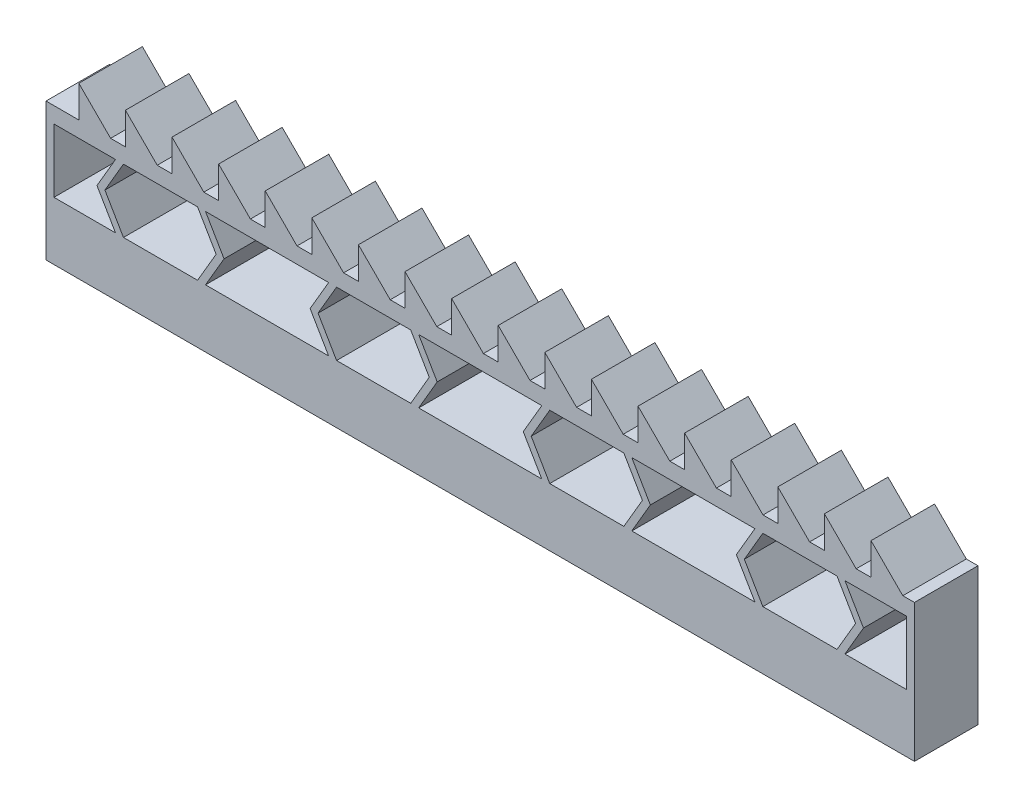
ISO-10303-21;
HEADER;
FILE_DESCRIPTION(('STEP AP214'),'2;1');
FILE_NAME('part.step','',(''),(''),'','','');
FILE_SCHEMA(('AUTOMOTIVE_DESIGN { 1 0 10303 214 1 1 1 1 }'));
ENDSEC;
DATA;
#1=APPLICATION_CONTEXT('core data for automotive mechanical design processes');
#2=APPLICATION_PROTOCOL_DEFINITION('international standard','automotive_design',2000,#1);
#3=PRODUCT_CONTEXT('',#1,'mechanical');
#4=PRODUCT('Part','Part','',(#3));
#5=PRODUCT_RELATED_PRODUCT_CATEGORY('part','',(#4));
#6=PRODUCT_DEFINITION_FORMATION('','',#4);
#7=PRODUCT_DEFINITION_CONTEXT('part definition',#1,'design');
#8=PRODUCT_DEFINITION('design','',#6,#7);
#9=PRODUCT_DEFINITION_SHAPE('','',#8);
#10=(LENGTH_UNIT() NAMED_UNIT(*) SI_UNIT(.MILLI.,.METRE.));
#11=(NAMED_UNIT(*) PLANE_ANGLE_UNIT() SI_UNIT($,.RADIAN.));
#12=(NAMED_UNIT(*) SI_UNIT($,.STERADIAN.) SOLID_ANGLE_UNIT());
#13=UNCERTAINTY_MEASURE_WITH_UNIT(LENGTH_MEASURE(1.E-05),#10,'distance_accuracy_value','');
#14=(GEOMETRIC_REPRESENTATION_CONTEXT(3) GLOBAL_UNCERTAINTY_ASSIGNED_CONTEXT((#13)) GLOBAL_UNIT_ASSIGNED_CONTEXT((#10,
#11,#12)) REPRESENTATION_CONTEXT('',''));
#15=CARTESIAN_POINT('',(0.,0.,0.));
#16=DIRECTION('',(0.,0.,1.));
#17=DIRECTION('',(1.,0.,0.));
#18=AXIS2_PLACEMENT_3D('',#15,#16,#17);
#19=CARTESIAN_POINT('',(0.,13.,0.));
#20=DIRECTION('',(0.,-1.,0.));
#21=DIRECTION('',(0.,0.,-1.));
#22=AXIS2_PLACEMENT_3D('',#19,#20,#21);
#23=PLANE('',#22);
#24=DIRECTION('',(1.,0.,0.));
#25=VECTOR('',#24,1.);
#26=CARTESIAN_POINT('',(0.,13.,0.));
#27=LINE('',#26,#25);
#28=CARTESIAN_POINT('',(76.5,13.,0.));
#29=VERTEX_POINT('',#28);
#30=CARTESIAN_POINT('',(77.9,13.,0.));
#31=VERTEX_POINT('',#30);
#32=EDGE_CURVE('E1795',#29,#31,#27,.T.);
#33=ORIENTED_EDGE('',*,*,#32,.T.);
#34=DIRECTION('',(0.,0.,1.));
#35=VECTOR('',#34,1.);
#36=CARTESIAN_POINT('',(77.9,13.,-6.00000000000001));
#37=LINE('',#36,#35);
#38=CARTESIAN_POINT('',(77.9,13.,-6.00000000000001));
#39=VERTEX_POINT('',#38);
#40=EDGE_CURVE('E1247',#39,#31,#37,.T.);
#41=ORIENTED_EDGE('',*,*,#40,.F.);
#42=DIRECTION('',(-1.,0.,0.));
#43=VECTOR('',#42,1.);
#44=CARTESIAN_POINT('',(0.,13.,-6.00000000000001));
#45=LINE('',#44,#43);
#46=CARTESIAN_POINT('',(76.5,13.,-6.00000000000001));
#47=VERTEX_POINT('',#46);
#48=EDGE_CURVE('E1682',#39,#47,#45,.T.);
#49=ORIENTED_EDGE('',*,*,#48,.T.);
#50=DIRECTION('',(0.,0.,1.));
#51=VECTOR('',#50,1.);
#52=CARTESIAN_POINT('',(76.5,13.,-6.00000000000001));
#53=LINE('',#52,#51);
#54=EDGE_CURVE('E1262',#47,#29,#53,.T.);
#55=ORIENTED_EDGE('',*,*,#54,.T.);
#56=EDGE_LOOP('',(#33,#41,#49,#55));
#57=FACE_BOUND('',#56,.T.);
#58=ADVANCED_FACE('F32',(#57),#23,.F.);
#59=CARTESIAN_POINT('',(72.1,13.,0.));
#60=VERTEX_POINT('',#59);
#61=CARTESIAN_POINT('',(73.5,13.,0.));
#62=VERTEX_POINT('',#61);
#63=EDGE_CURVE('E1805',#60,#62,#27,.T.);
#64=ORIENTED_EDGE('',*,*,#63,.T.);
#65=DIRECTION('',(0.,0.,1.));
#66=VECTOR('',#65,1.);
#67=CARTESIAN_POINT('',(73.5,13.,-6.00000000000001));
#68=LINE('',#67,#66);
#69=CARTESIAN_POINT('',(73.5,13.,-6.00000000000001));
#70=VERTEX_POINT('',#69);
#71=EDGE_CURVE('E1267',#70,#62,#68,.T.);
#72=ORIENTED_EDGE('',*,*,#71,.F.);
#73=CARTESIAN_POINT('',(72.1,13.,-6.00000000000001));
#74=VERTEX_POINT('',#73);
#75=EDGE_CURVE('E1821',#70,#74,#45,.T.);
#76=ORIENTED_EDGE('',*,*,#75,.T.);
#77=DIRECTION('',(0.,0.,1.));
#78=VECTOR('',#77,1.);
#79=CARTESIAN_POINT('',(72.1,13.,-6.00000000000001));
#80=LINE('',#79,#78);
#81=EDGE_CURVE('E1282',#74,#60,#80,.T.);
#82=ORIENTED_EDGE('',*,*,#81,.T.);
#83=EDGE_LOOP('',(#64,#72,#76,#82));
#84=FACE_BOUND('',#83,.T.);
#85=ADVANCED_FACE('F1819',(#84),#23,.F.);
#86=CARTESIAN_POINT('',(67.7,13.,0.));
#87=VERTEX_POINT('',#86);
#88=CARTESIAN_POINT('',(69.1,13.,0.));
#89=VERTEX_POINT('',#88);
#90=EDGE_CURVE('E1817',#87,#89,#27,.T.);
#91=ORIENTED_EDGE('',*,*,#90,.T.);
#92=DIRECTION('',(0.,0.,1.));
#93=VECTOR('',#92,1.);
#94=CARTESIAN_POINT('',(69.1,13.,-6.00000000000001));
#95=LINE('',#94,#93);
#96=CARTESIAN_POINT('',(69.1,13.,-6.00000000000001));
#97=VERTEX_POINT('',#96);
#98=EDGE_CURVE('E1287',#97,#89,#95,.T.);
#99=ORIENTED_EDGE('',*,*,#98,.F.);
#100=CARTESIAN_POINT('',(67.7,13.,-6.00000000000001));
#101=VERTEX_POINT('',#100);
#102=EDGE_CURVE('E1835',#97,#101,#45,.T.);
#103=ORIENTED_EDGE('',*,*,#102,.T.);
#104=DIRECTION('',(0.,0.,1.));
#105=VECTOR('',#104,1.);
#106=CARTESIAN_POINT('',(67.7,13.,-6.00000000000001));
#107=LINE('',#106,#105);
#108=EDGE_CURVE('E1302',#101,#87,#107,.T.);
#109=ORIENTED_EDGE('',*,*,#108,.T.);
#110=EDGE_LOOP('',(#91,#99,#103,#109));
#111=FACE_BOUND('',#110,.T.);
#112=ADVANCED_FACE('F1833',(#111),#23,.F.);
#113=CARTESIAN_POINT('',(63.3,13.,0.));
#114=VERTEX_POINT('',#113);
#115=CARTESIAN_POINT('',(64.7,13.,0.));
#116=VERTEX_POINT('',#115);
#117=EDGE_CURVE('E1831',#114,#116,#27,.T.);
#118=ORIENTED_EDGE('',*,*,#117,.T.);
#119=DIRECTION('',(0.,0.,1.));
#120=VECTOR('',#119,1.);
#121=CARTESIAN_POINT('',(64.7,13.,-6.00000000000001));
#122=LINE('',#121,#120);
#123=CARTESIAN_POINT('',(64.7,13.,-6.00000000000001));
#124=VERTEX_POINT('',#123);
#125=EDGE_CURVE('E1307',#124,#116,#122,.T.);
#126=ORIENTED_EDGE('',*,*,#125,.F.);
#127=CARTESIAN_POINT('',(63.3,13.,-6.00000000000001));
#128=VERTEX_POINT('',#127);
#129=EDGE_CURVE('E1849',#124,#128,#45,.T.);
#130=ORIENTED_EDGE('',*,*,#129,.T.);
#131=DIRECTION('',(0.,0.,1.));
#132=VECTOR('',#131,1.);
#133=CARTESIAN_POINT('',(63.3,13.,-6.00000000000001));
#134=LINE('',#133,#132);
#135=EDGE_CURVE('E1322',#128,#114,#134,.T.);
#136=ORIENTED_EDGE('',*,*,#135,.T.);
#137=EDGE_LOOP('',(#118,#126,#130,#136));
#138=FACE_BOUND('',#137,.T.);
#139=ADVANCED_FACE('F1847',(#138),#23,.F.);
#140=CARTESIAN_POINT('',(58.9,13.,0.));
#141=VERTEX_POINT('',#140);
#142=CARTESIAN_POINT('',(60.3,13.,0.));
#143=VERTEX_POINT('',#142);
#144=EDGE_CURVE('E1845',#141,#143,#27,.T.);
#145=ORIENTED_EDGE('',*,*,#144,.T.);
#146=DIRECTION('',(0.,0.,1.));
#147=VECTOR('',#146,1.);
#148=CARTESIAN_POINT('',(60.3,13.,-6.00000000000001));
#149=LINE('',#148,#147);
#150=CARTESIAN_POINT('',(60.3,13.,-6.00000000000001));
#151=VERTEX_POINT('',#150);
#152=EDGE_CURVE('E1327',#151,#143,#149,.T.);
#153=ORIENTED_EDGE('',*,*,#152,.F.);
#154=CARTESIAN_POINT('',(58.9,13.,-6.00000000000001));
#155=VERTEX_POINT('',#154);
#156=EDGE_CURVE('E1863',#151,#155,#45,.T.);
#157=ORIENTED_EDGE('',*,*,#156,.T.);
#158=DIRECTION('',(0.,0.,1.));
#159=VECTOR('',#158,1.);
#160=CARTESIAN_POINT('',(58.9,13.,-6.00000000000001));
#161=LINE('',#160,#159);
#162=EDGE_CURVE('E1342',#155,#141,#161,.T.);
#163=ORIENTED_EDGE('',*,*,#162,.T.);
#164=EDGE_LOOP('',(#145,#153,#157,#163));
#165=FACE_BOUND('',#164,.T.);
#166=ADVANCED_FACE('F1861',(#165),#23,.F.);
#167=CARTESIAN_POINT('',(54.5,13.,0.));
#168=VERTEX_POINT('',#167);
#169=CARTESIAN_POINT('',(55.9,13.,0.));
#170=VERTEX_POINT('',#169);
#171=EDGE_CURVE('E1859',#168,#170,#27,.T.);
#172=ORIENTED_EDGE('',*,*,#171,.T.);
#173=DIRECTION('',(0.,0.,1.));
#174=VECTOR('',#173,1.);
#175=CARTESIAN_POINT('',(55.9,13.,-6.00000000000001));
#176=LINE('',#175,#174);
#177=CARTESIAN_POINT('',(55.9,13.,-6.00000000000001));
#178=VERTEX_POINT('',#177);
#179=EDGE_CURVE('E1347',#178,#170,#176,.T.);
#180=ORIENTED_EDGE('',*,*,#179,.F.);
#181=CARTESIAN_POINT('',(54.5,13.,-6.00000000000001));
#182=VERTEX_POINT('',#181);
#183=EDGE_CURVE('E1877',#178,#182,#45,.T.);
#184=ORIENTED_EDGE('',*,*,#183,.T.);
#185=DIRECTION('',(0.,0.,1.));
#186=VECTOR('',#185,1.);
#187=CARTESIAN_POINT('',(54.5,13.,-6.00000000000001));
#188=LINE('',#187,#186);
#189=EDGE_CURVE('E1362',#182,#168,#188,.T.);
#190=ORIENTED_EDGE('',*,*,#189,.T.);
#191=EDGE_LOOP('',(#172,#180,#184,#190));
#192=FACE_BOUND('',#191,.T.);
#193=ADVANCED_FACE('F1875',(#192),#23,.F.);
#194=CARTESIAN_POINT('',(50.1,13.,0.));
#195=VERTEX_POINT('',#194);
#196=CARTESIAN_POINT('',(51.5,13.,0.));
#197=VERTEX_POINT('',#196);
#198=EDGE_CURVE('E1873',#195,#197,#27,.T.);
#199=ORIENTED_EDGE('',*,*,#198,.T.);
#200=DIRECTION('',(0.,0.,1.));
#201=VECTOR('',#200,1.);
#202=CARTESIAN_POINT('',(51.5,13.,-6.00000000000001));
#203=LINE('',#202,#201);
#204=CARTESIAN_POINT('',(51.5,13.,-6.00000000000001));
#205=VERTEX_POINT('',#204);
#206=EDGE_CURVE('E1367',#205,#197,#203,.T.);
#207=ORIENTED_EDGE('',*,*,#206,.F.);
#208=CARTESIAN_POINT('',(50.1,13.,-6.00000000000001));
#209=VERTEX_POINT('',#208);
#210=EDGE_CURVE('E1891',#205,#209,#45,.T.);
#211=ORIENTED_EDGE('',*,*,#210,.T.);
#212=DIRECTION('',(0.,0.,1.));
#213=VECTOR('',#212,1.);
#214=CARTESIAN_POINT('',(50.1,13.,-6.00000000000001));
#215=LINE('',#214,#213);
#216=EDGE_CURVE('E1382',#209,#195,#215,.T.);
#217=ORIENTED_EDGE('',*,*,#216,.T.);
#218=EDGE_LOOP('',(#199,#207,#211,#217));
#219=FACE_BOUND('',#218,.T.);
#220=ADVANCED_FACE('F1889',(#219),#23,.F.);
#221=CARTESIAN_POINT('',(45.7,13.,0.));
#222=VERTEX_POINT('',#221);
#223=CARTESIAN_POINT('',(47.1,13.,0.));
#224=VERTEX_POINT('',#223);
#225=EDGE_CURVE('E1887',#222,#224,#27,.T.);
#226=ORIENTED_EDGE('',*,*,#225,.T.);
#227=DIRECTION('',(0.,0.,1.));
#228=VECTOR('',#227,1.);
#229=CARTESIAN_POINT('',(47.1,13.,-6.00000000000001));
#230=LINE('',#229,#228);
#231=CARTESIAN_POINT('',(47.1,13.,-6.00000000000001));
#232=VERTEX_POINT('',#231);
#233=EDGE_CURVE('E1387',#232,#224,#230,.T.);
#234=ORIENTED_EDGE('',*,*,#233,.F.);
#235=CARTESIAN_POINT('',(45.7,13.,-6.00000000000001));
#236=VERTEX_POINT('',#235);
#237=EDGE_CURVE('E1905',#232,#236,#45,.T.);
#238=ORIENTED_EDGE('',*,*,#237,.T.);
#239=DIRECTION('',(0.,0.,1.));
#240=VECTOR('',#239,1.);
#241=CARTESIAN_POINT('',(45.7,13.,-6.00000000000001));
#242=LINE('',#241,#240);
#243=EDGE_CURVE('E1402',#236,#222,#242,.T.);
#244=ORIENTED_EDGE('',*,*,#243,.T.);
#245=EDGE_LOOP('',(#226,#234,#238,#244));
#246=FACE_BOUND('',#245,.T.);
#247=ADVANCED_FACE('F1903',(#246),#23,.F.);
#248=CARTESIAN_POINT('',(41.3,13.,0.));
#249=VERTEX_POINT('',#248);
#250=CARTESIAN_POINT('',(42.7,13.,0.));
#251=VERTEX_POINT('',#250);
#252=EDGE_CURVE('E1901',#249,#251,#27,.T.);
#253=ORIENTED_EDGE('',*,*,#252,.T.);
#254=DIRECTION('',(0.,0.,1.));
#255=VECTOR('',#254,1.);
#256=CARTESIAN_POINT('',(42.7,13.,-6.00000000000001));
#257=LINE('',#256,#255);
#258=CARTESIAN_POINT('',(42.7,13.,-6.00000000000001));
#259=VERTEX_POINT('',#258);
#260=EDGE_CURVE('E1407',#259,#251,#257,.T.);
#261=ORIENTED_EDGE('',*,*,#260,.F.);
#262=CARTESIAN_POINT('',(41.3,13.,-6.00000000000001));
#263=VERTEX_POINT('',#262);
#264=EDGE_CURVE('E1919',#259,#263,#45,.T.);
#265=ORIENTED_EDGE('',*,*,#264,.T.);
#266=DIRECTION('',(0.,0.,1.));
#267=VECTOR('',#266,1.);
#268=CARTESIAN_POINT('',(41.3,13.,-6.));
#269=LINE('',#268,#267);
#270=EDGE_CURVE('E1422',#263,#249,#269,.T.);
#271=ORIENTED_EDGE('',*,*,#270,.T.);
#272=EDGE_LOOP('',(#253,#261,#265,#271));
#273=FACE_BOUND('',#272,.T.);
#274=ADVANCED_FACE('F1917',(#273),#23,.F.);
#275=CARTESIAN_POINT('',(36.9,13.,0.));
#276=VERTEX_POINT('',#275);
#277=CARTESIAN_POINT('',(38.3,13.,0.));
#278=VERTEX_POINT('',#277);
#279=EDGE_CURVE('E1915',#276,#278,#27,.T.);
#280=ORIENTED_EDGE('',*,*,#279,.T.);
#281=DIRECTION('',(0.,0.,1.));
#282=VECTOR('',#281,1.);
#283=CARTESIAN_POINT('',(38.3,13.,-6.));
#284=LINE('',#283,#282);
#285=CARTESIAN_POINT('',(38.3,13.,-6.00000000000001));
#286=VERTEX_POINT('',#285);
#287=EDGE_CURVE('E1427',#286,#278,#284,.T.);
#288=ORIENTED_EDGE('',*,*,#287,.F.);
#289=CARTESIAN_POINT('',(36.9,13.,-6.00000000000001));
#290=VERTEX_POINT('',#289);
#291=EDGE_CURVE('E1933',#286,#290,#45,.T.);
#292=ORIENTED_EDGE('',*,*,#291,.T.);
#293=DIRECTION('',(0.,0.,1.));
#294=VECTOR('',#293,1.);
#295=CARTESIAN_POINT('',(36.9,13.,-6.));
#296=LINE('',#295,#294);
#297=EDGE_CURVE('E1442',#290,#276,#296,.T.);
#298=ORIENTED_EDGE('',*,*,#297,.T.);
#299=EDGE_LOOP('',(#280,#288,#292,#298));
#300=FACE_BOUND('',#299,.T.);
#301=ADVANCED_FACE('F1931',(#300),#23,.F.);
#302=CARTESIAN_POINT('',(32.5,13.,0.));
#303=VERTEX_POINT('',#302);
#304=CARTESIAN_POINT('',(33.9,13.,0.));
#305=VERTEX_POINT('',#304);
#306=EDGE_CURVE('E1929',#303,#305,#27,.T.);
#307=ORIENTED_EDGE('',*,*,#306,.T.);
#308=DIRECTION('',(0.,0.,1.));
#309=VECTOR('',#308,1.);
#310=CARTESIAN_POINT('',(33.9,13.,-6.));
#311=LINE('',#310,#309);
#312=CARTESIAN_POINT('',(33.9,13.,-6.00000000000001));
#313=VERTEX_POINT('',#312);
#314=EDGE_CURVE('E1447',#313,#305,#311,.T.);
#315=ORIENTED_EDGE('',*,*,#314,.F.);
#316=CARTESIAN_POINT('',(32.5,13.,-6.00000000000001));
#317=VERTEX_POINT('',#316);
#318=EDGE_CURVE('E1947',#313,#317,#45,.T.);
#319=ORIENTED_EDGE('',*,*,#318,.T.);
#320=DIRECTION('',(0.,0.,1.));
#321=VECTOR('',#320,1.);
#322=CARTESIAN_POINT('',(32.5,13.,-6.));
#323=LINE('',#322,#321);
#324=EDGE_CURVE('E1462',#317,#303,#323,.T.);
#325=ORIENTED_EDGE('',*,*,#324,.T.);
#326=EDGE_LOOP('',(#307,#315,#319,#325));
#327=FACE_BOUND('',#326,.T.);
#328=ADVANCED_FACE('F1945',(#327),#23,.F.);
#329=CARTESIAN_POINT('',(28.1,13.,0.));
#330=VERTEX_POINT('',#329);
#331=CARTESIAN_POINT('',(29.5,13.,0.));
#332=VERTEX_POINT('',#331);
#333=EDGE_CURVE('E1943',#330,#332,#27,.T.);
#334=ORIENTED_EDGE('',*,*,#333,.T.);
#335=DIRECTION('',(0.,0.,1.));
#336=VECTOR('',#335,1.);
#337=CARTESIAN_POINT('',(29.5,13.,-6.));
#338=LINE('',#337,#336);
#339=CARTESIAN_POINT('',(29.5,13.,-6.00000000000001));
#340=VERTEX_POINT('',#339);
#341=EDGE_CURVE('E1467',#340,#332,#338,.T.);
#342=ORIENTED_EDGE('',*,*,#341,.F.);
#343=CARTESIAN_POINT('',(28.1,13.,-6.00000000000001));
#344=VERTEX_POINT('',#343);
#345=EDGE_CURVE('E1961',#340,#344,#45,.T.);
#346=ORIENTED_EDGE('',*,*,#345,.T.);
#347=DIRECTION('',(0.,0.,1.));
#348=VECTOR('',#347,1.);
#349=CARTESIAN_POINT('',(28.1,13.,-6.));
#350=LINE('',#349,#348);
#351=EDGE_CURVE('E1482',#344,#330,#350,.T.);
#352=ORIENTED_EDGE('',*,*,#351,.T.);
#353=EDGE_LOOP('',(#334,#342,#346,#352));
#354=FACE_BOUND('',#353,.T.);
#355=ADVANCED_FACE('F1959',(#354),#23,.F.);
#356=CARTESIAN_POINT('',(23.7,13.,0.));
#357=VERTEX_POINT('',#356);
#358=CARTESIAN_POINT('',(25.1,13.,0.));
#359=VERTEX_POINT('',#358);
#360=EDGE_CURVE('E1957',#357,#359,#27,.T.);
#361=ORIENTED_EDGE('',*,*,#360,.T.);
#362=DIRECTION('',(0.,0.,1.));
#363=VECTOR('',#362,1.);
#364=CARTESIAN_POINT('',(25.1,13.,-6.));
#365=LINE('',#364,#363);
#366=CARTESIAN_POINT('',(25.1,13.,-6.00000000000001));
#367=VERTEX_POINT('',#366);
#368=EDGE_CURVE('E1487',#367,#359,#365,.T.);
#369=ORIENTED_EDGE('',*,*,#368,.F.);
#370=CARTESIAN_POINT('',(23.7,13.,-6.00000000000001));
#371=VERTEX_POINT('',#370);
#372=EDGE_CURVE('E1975',#367,#371,#45,.T.);
#373=ORIENTED_EDGE('',*,*,#372,.T.);
#374=DIRECTION('',(0.,0.,1.));
#375=VECTOR('',#374,1.);
#376=CARTESIAN_POINT('',(23.7,13.,-6.));
#377=LINE('',#376,#375);
#378=EDGE_CURVE('E1502',#371,#357,#377,.T.);
#379=ORIENTED_EDGE('',*,*,#378,.T.);
#380=EDGE_LOOP('',(#361,#369,#373,#379));
#381=FACE_BOUND('',#380,.T.);
#382=ADVANCED_FACE('F1973',(#381),#23,.F.);
#383=CARTESIAN_POINT('',(19.3,13.,0.));
#384=VERTEX_POINT('',#383);
#385=CARTESIAN_POINT('',(20.7,13.,0.));
#386=VERTEX_POINT('',#385);
#387=EDGE_CURVE('E1971',#384,#386,#27,.T.);
#388=ORIENTED_EDGE('',*,*,#387,.T.);
#389=DIRECTION('',(0.,0.,1.));
#390=VECTOR('',#389,1.);
#391=CARTESIAN_POINT('',(20.7,13.,-6.));
#392=LINE('',#391,#390);
#393=CARTESIAN_POINT('',(20.7,13.,-6.00000000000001));
#394=VERTEX_POINT('',#393);
#395=EDGE_CURVE('E1507',#394,#386,#392,.T.);
#396=ORIENTED_EDGE('',*,*,#395,.F.);
#397=CARTESIAN_POINT('',(19.3,13.,-6.00000000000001));
#398=VERTEX_POINT('',#397);
#399=EDGE_CURVE('E1989',#394,#398,#45,.T.);
#400=ORIENTED_EDGE('',*,*,#399,.T.);
#401=DIRECTION('',(0.,0.,1.));
#402=VECTOR('',#401,1.);
#403=CARTESIAN_POINT('',(19.3,13.,-6.));
#404=LINE('',#403,#402);
#405=EDGE_CURVE('E1522',#398,#384,#404,.T.);
#406=ORIENTED_EDGE('',*,*,#405,.T.);
#407=EDGE_LOOP('',(#388,#396,#400,#406));
#408=FACE_BOUND('',#407,.T.);
#409=ADVANCED_FACE('F1987',(#408),#23,.F.);
#410=CARTESIAN_POINT('',(14.9,13.,0.));
#411=VERTEX_POINT('',#410);
#412=CARTESIAN_POINT('',(16.3,13.,0.));
#413=VERTEX_POINT('',#412);
#414=EDGE_CURVE('E1985',#411,#413,#27,.T.);
#415=ORIENTED_EDGE('',*,*,#414,.T.);
#416=DIRECTION('',(0.,0.,1.));
#417=VECTOR('',#416,1.);
#418=CARTESIAN_POINT('',(16.3,13.,-6.));
#419=LINE('',#418,#417);
#420=CARTESIAN_POINT('',(16.3,13.,-6.00000000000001));
#421=VERTEX_POINT('',#420);
#422=EDGE_CURVE('E1527',#421,#413,#419,.T.);
#423=ORIENTED_EDGE('',*,*,#422,.F.);
#424=CARTESIAN_POINT('',(14.9,13.,-6.00000000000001));
#425=VERTEX_POINT('',#424);
#426=EDGE_CURVE('E2003',#421,#425,#45,.T.);
#427=ORIENTED_EDGE('',*,*,#426,.T.);
#428=DIRECTION('',(0.,0.,1.));
#429=VECTOR('',#428,1.);
#430=CARTESIAN_POINT('',(14.9,13.,-6.));
#431=LINE('',#430,#429);
#432=EDGE_CURVE('E1542',#425,#411,#431,.T.);
#433=ORIENTED_EDGE('',*,*,#432,.T.);
#434=EDGE_LOOP('',(#415,#423,#427,#433));
#435=FACE_BOUND('',#434,.T.);
#436=ADVANCED_FACE('F2001',(#435),#23,.F.);
#437=CARTESIAN_POINT('',(10.5,13.,0.));
#438=VERTEX_POINT('',#437);
#439=CARTESIAN_POINT('',(11.9,13.,0.));
#440=VERTEX_POINT('',#439);
#441=EDGE_CURVE('E1999',#438,#440,#27,.T.);
#442=ORIENTED_EDGE('',*,*,#441,.T.);
#443=DIRECTION('',(0.,0.,1.));
#444=VECTOR('',#443,1.);
#445=CARTESIAN_POINT('',(11.9,13.,-6.));
#446=LINE('',#445,#444);
#447=CARTESIAN_POINT('',(11.9,13.,-6.00000000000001));
#448=VERTEX_POINT('',#447);
#449=EDGE_CURVE('E1547',#448,#440,#446,.T.);
#450=ORIENTED_EDGE('',*,*,#449,.F.);
#451=CARTESIAN_POINT('',(10.5,13.,-6.00000000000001));
#452=VERTEX_POINT('',#451);
#453=EDGE_CURVE('E2016',#448,#452,#45,.T.);
#454=ORIENTED_EDGE('',*,*,#453,.T.);
#455=DIRECTION('',(0.,0.,1.));
#456=VECTOR('',#455,1.);
#457=CARTESIAN_POINT('',(10.5,13.,-6.));
#458=LINE('',#457,#456);
#459=EDGE_CURVE('E1562',#452,#438,#458,.T.);
#460=ORIENTED_EDGE('',*,*,#459,.T.);
#461=EDGE_LOOP('',(#442,#450,#454,#460));
#462=FACE_BOUND('',#461,.T.);
#463=ADVANCED_FACE('F2014',(#462),#23,.F.);
#464=CARTESIAN_POINT('',(6.1,13.,0.));
#465=VERTEX_POINT('',#464);
#466=CARTESIAN_POINT('',(7.5,13.,0.));
#467=VERTEX_POINT('',#466);
#468=EDGE_CURVE('E1676',#465,#467,#27,.T.);
#469=ORIENTED_EDGE('',*,*,#468,.T.);
#470=DIRECTION('',(0.,0.,1.));
#471=VECTOR('',#470,1.);
#472=CARTESIAN_POINT('',(7.5,13.,-6.));
#473=LINE('',#472,#471);
#474=CARTESIAN_POINT('',(7.5,13.,-6.00000000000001));
#475=VERTEX_POINT('',#474);
#476=EDGE_CURVE('E1567',#475,#467,#473,.T.);
#477=ORIENTED_EDGE('',*,*,#476,.F.);
#478=CARTESIAN_POINT('',(6.1,13.,-6.));
#479=VERTEX_POINT('',#478);
#480=EDGE_CURVE('E2029',#475,#479,#45,.T.);
#481=ORIENTED_EDGE('',*,*,#480,.T.);
#482=DIRECTION('',(0.,0.,1.));
#483=VECTOR('',#482,1.);
#484=CARTESIAN_POINT('',(6.1,13.,-6.));
#485=LINE('',#484,#483);
#486=EDGE_CURVE('E1581',#479,#465,#485,.T.);
#487=ORIENTED_EDGE('',*,*,#486,.T.);
#488=EDGE_LOOP('',(#469,#477,#481,#487));
#489=FACE_BOUND('',#488,.T.);
#490=ADVANCED_FACE('F2026',(#489),#23,.F.);
#491=DIRECTION('',(0.,0.,1.));
#492=VECTOR('',#491,1.);
#493=CARTESIAN_POINT('',(3.1,13.,-6.));
#494=LINE('',#493,#492);
#495=CARTESIAN_POINT('',(3.1,13.,-6.));
#496=VERTEX_POINT('',#495);
#497=CARTESIAN_POINT('',(3.1,13.,0.));
#498=VERTEX_POINT('',#497);
#499=EDGE_CURVE('E1586',#496,#498,#494,.T.);
#500=ORIENTED_EDGE('',*,*,#499,.F.);
#501=CARTESIAN_POINT('',(0.,13.,-6.00000000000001));
#502=VERTEX_POINT('',#501);
#503=EDGE_CURVE('E1678',#496,#502,#45,.T.);
#504=ORIENTED_EDGE('',*,*,#503,.T.);
#505=DIRECTION('',(0.,0.,1.));
#506=VECTOR('',#505,1.);
#507=CARTESIAN_POINT('',(0.,13.,0.));
#508=LINE('',#507,#506);
#509=CARTESIAN_POINT('',(0.,13.,0.));
#510=VERTEX_POINT('',#509);
#511=EDGE_CURVE('E1667',#502,#510,#508,.T.);
#512=ORIENTED_EDGE('',*,*,#511,.T.);
#513=EDGE_CURVE('E1672',#510,#498,#27,.T.);
#514=ORIENTED_EDGE('',*,*,#513,.T.);
#515=EDGE_LOOP('',(#500,#504,#512,#514));
#516=FACE_BOUND('',#515,.T.);
#517=ADVANCED_FACE('F2037',(#516),#23,.F.);
#518=CARTESIAN_POINT('',(82.,1.8,-4.));
#519=DIRECTION('',(0.,-1.,0.));
#520=DIRECTION('',(0.,0.,-1.));
#521=AXIS2_PLACEMENT_3D('',#518,#519,#520);
#522=PLANE('',#521);
#523=DIRECTION('',(0.,0.,-1.));
#524=VECTOR('',#523,1.);
#525=CARTESIAN_POINT('',(80.6,1.8,-0.600000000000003));
#526=LINE('',#525,#524);
#527=CARTESIAN_POINT('',(80.6,1.8,-4.));
#528=VERTEX_POINT('',#527);
#529=CARTESIAN_POINT('',(80.6,1.8,-5.4));
#530=VERTEX_POINT('',#529);
#531=EDGE_CURVE('E1633',#528,#530,#526,.T.);
#532=ORIENTED_EDGE('',*,*,#531,.T.);
#533=DIRECTION('',(-1.,0.,0.));
#534=VECTOR('',#533,1.);
#535=CARTESIAN_POINT('',(82.,1.8,-5.4));
#536=LINE('',#535,#534);
#537=CARTESIAN_POINT('',(1.4,1.8,-5.4));
#538=VERTEX_POINT('',#537);
#539=EDGE_CURVE('E1656',#530,#538,#536,.T.);
#540=ORIENTED_EDGE('',*,*,#539,.T.);
#541=DIRECTION('',(0.,0.,1.));
#542=VECTOR('',#541,1.);
#543=CARTESIAN_POINT('',(1.4,1.8,-5.4));
#544=LINE('',#543,#542);
#545=CARTESIAN_POINT('',(1.4,1.8,-4.));
#546=VERTEX_POINT('',#545);
#547=EDGE_CURVE('E1640',#538,#546,#544,.T.);
#548=ORIENTED_EDGE('',*,*,#547,.T.);
#549=DIRECTION('',(1.,0.,0.));
#550=VECTOR('',#549,1.);
#551=CARTESIAN_POINT('',(82.,1.8,-4.));
#552=LINE('',#551,#550);
#553=CARTESIAN_POINT('',(2.9,1.8,-4.));
#554=VERTEX_POINT('',#553);
#555=EDGE_CURVE('E1604',#546,#554,#552,.T.);
#556=ORIENTED_EDGE('',*,*,#555,.T.);
#557=DIRECTION('',(-1.,0.,0.));
#558=VECTOR('',#557,1.);
#559=CARTESIAN_POINT('',(82.,1.8,-4.));
#560=LINE('',#559,#558);
#561=CARTESIAN_POINT('',(79.1,1.8,-4.));
#562=VERTEX_POINT('',#561);
#563=EDGE_CURVE('E1652',#562,#554,#560,.T.);
#564=ORIENTED_EDGE('',*,*,#563,.F.);
#565=EDGE_CURVE('E1655',#528,#562,#560,.T.);
#566=ORIENTED_EDGE('',*,*,#565,.F.);
#567=EDGE_LOOP('',(#532,#540,#548,#556,#564,#566));
#568=FACE_BOUND('',#567,.T.);
#569=ADVANCED_FACE('F2039',(#568),#522,.F.);
#570=CARTESIAN_POINT('',(82.,1.8,-5.4));
#571=DIRECTION('',(0.,0.,-1.));
#572=DIRECTION('',(-1.,0.,0.));
#573=AXIS2_PLACEMENT_3D('',#570,#571,#572);
#574=PLANE('',#573);
#575=DIRECTION('',(0.,1.,0.));
#576=VECTOR('',#575,1.);
#577=CARTESIAN_POINT('',(80.6,1.8,-5.4));
#578=LINE('',#577,#576);
#579=CARTESIAN_POINT('',(80.6,3.7,-5.4));
#580=VERTEX_POINT('',#579);
#581=EDGE_CURVE('E1632',#530,#580,#578,.T.);
#582=ORIENTED_EDGE('',*,*,#581,.T.);
#583=DIRECTION('',(-1.,0.,0.));
#584=VECTOR('',#583,1.);
#585=CARTESIAN_POINT('',(82.,3.7,-5.4));
#586=LINE('',#585,#584);
#587=CARTESIAN_POINT('',(1.4,3.7,-5.4));
#588=VERTEX_POINT('',#587);
#589=EDGE_CURVE('E1658',#580,#588,#586,.T.);
#590=ORIENTED_EDGE('',*,*,#589,.T.);
#591=DIRECTION('',(0.,1.,0.));
#592=VECTOR('',#591,1.);
#593=CARTESIAN_POINT('',(1.4,1.8,-5.4));
#594=LINE('',#593,#592);
#595=EDGE_CURVE('E1648',#538,#588,#594,.T.);
#596=ORIENTED_EDGE('',*,*,#595,.F.);
#597=ORIENTED_EDGE('',*,*,#539,.F.);
#598=EDGE_LOOP('',(#582,#590,#596,#597));
#599=FACE_BOUND('',#598,.T.);
#600=ADVANCED_FACE('F2045',(#599),#574,.F.);
#601=CARTESIAN_POINT('',(82.,3.7,-0.600000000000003));
#602=DIRECTION('',(0.,1.,0.));
#603=DIRECTION('',(0.,0.,1.));
#604=AXIS2_PLACEMENT_3D('',#601,#602,#603);
#605=PLANE('',#604);
#606=DIRECTION('',(0.,0.,-1.));
#607=VECTOR('',#606,1.);
#608=CARTESIAN_POINT('',(80.6,3.7,-0.600000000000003));
#609=LINE('',#608,#607);
#610=CARTESIAN_POINT('',(80.6,3.7,-0.600000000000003));
#611=VERTEX_POINT('',#610);
#612=EDGE_CURVE('E1624',#611,#580,#609,.T.);
#613=ORIENTED_EDGE('',*,*,#612,.F.);
#614=DIRECTION('',(-1.,0.,0.));
#615=VECTOR('',#614,1.);
#616=CARTESIAN_POINT('',(82.,3.7,-0.600000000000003));
#617=LINE('',#616,#615);
#618=CARTESIAN_POINT('',(1.4,3.7,-0.600000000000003));
#619=VERTEX_POINT('',#618);
#620=EDGE_CURVE('E1660',#611,#619,#617,.T.);
#621=ORIENTED_EDGE('',*,*,#620,.T.);
#622=DIRECTION('',(0.,0.,1.));
#623=VECTOR('',#622,1.);
#624=CARTESIAN_POINT('',(1.4,3.7,-5.4));
#625=LINE('',#624,#623);
#626=EDGE_CURVE('E1639',#588,#619,#625,.T.);
#627=ORIENTED_EDGE('',*,*,#626,.F.);
#628=ORIENTED_EDGE('',*,*,#589,.F.);
#629=EDGE_LOOP('',(#613,#621,#627,#628));
#630=FACE_BOUND('',#629,.T.);
#631=ADVANCED_FACE('F3159',(#630),#605,.F.);
#632=CARTESIAN_POINT('',(82.,1.8,-0.600000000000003));
#633=DIRECTION('',(0.,0.,1.));
#634=DIRECTION('',(1.,0.,0.));
#635=AXIS2_PLACEMENT_3D('',#632,#633,#634);
#636=PLANE('',#635);
#637=DIRECTION('',(0.,1.,0.));
#638=VECTOR('',#637,1.);
#639=CARTESIAN_POINT('',(80.6,1.8,-0.600000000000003));
#640=LINE('',#639,#638);
#641=CARTESIAN_POINT('',(80.6,1.8,-0.600000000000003));
#642=VERTEX_POINT('',#641);
#643=EDGE_CURVE('E1637',#642,#611,#640,.T.);
#644=ORIENTED_EDGE('',*,*,#643,.F.);
#645=DIRECTION('',(-1.,0.,0.));
#646=VECTOR('',#645,1.);
#647=CARTESIAN_POINT('',(82.,1.8,-0.600000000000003));
#648=LINE('',#647,#646);
#649=CARTESIAN_POINT('',(1.4,1.8,-0.600000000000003));
#650=VERTEX_POINT('',#649);
#651=EDGE_CURVE('E1662',#642,#650,#648,.T.);
#652=ORIENTED_EDGE('',*,*,#651,.T.);
#653=DIRECTION('',(0.,1.,0.));
#654=VECTOR('',#653,1.);
#655=CARTESIAN_POINT('',(1.4,1.8,-0.600000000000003));
#656=LINE('',#655,#654);
#657=EDGE_CURVE('E1643',#650,#619,#656,.T.);
#658=ORIENTED_EDGE('',*,*,#657,.T.);
#659=ORIENTED_EDGE('',*,*,#620,.F.);
#660=EDGE_LOOP('',(#644,#652,#658,#659));
#661=FACE_BOUND('',#660,.T.);
#662=ADVANCED_FACE('F3163',(#661),#636,.F.);
#663=CARTESIAN_POINT('',(82.,1.8,-2.));
#664=DIRECTION('',(0.,-1.,0.));
#665=DIRECTION('',(0.,0.,-1.));
#666=AXIS2_PLACEMENT_3D('',#663,#664,#665);
#667=PLANE('',#666);
#668=CARTESIAN_POINT('',(80.6,1.8,-2.));
#669=VERTEX_POINT('',#668);
#670=EDGE_CURVE('E1629',#642,#669,#526,.T.);
#671=ORIENTED_EDGE('',*,*,#670,.T.);
#672=DIRECTION('',(-1.,0.,0.));
#673=VECTOR('',#672,1.);
#674=CARTESIAN_POINT('',(82.,1.8,-2.));
#675=LINE('',#674,#673);
#676=CARTESIAN_POINT('',(79.1,1.8,-2.));
#677=VERTEX_POINT('',#676);
#678=EDGE_CURVE('E1664',#669,#677,#675,.T.);
#679=ORIENTED_EDGE('',*,*,#678,.T.);
#680=CARTESIAN_POINT('',(2.9,1.8,-2.));
#681=VERTEX_POINT('',#680);
#682=EDGE_CURVE('E1651',#677,#681,#675,.T.);
#683=ORIENTED_EDGE('',*,*,#682,.T.);
#684=DIRECTION('',(-1.,0.,0.));
#685=VECTOR('',#684,1.);
#686=CARTESIAN_POINT('',(82.,1.8,-2.00000000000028));
#687=LINE('',#686,#685);
#688=CARTESIAN_POINT('',(1.4,1.8,-2.));
#689=VERTEX_POINT('',#688);
#690=EDGE_CURVE('E1610',#681,#689,#687,.T.);
#691=ORIENTED_EDGE('',*,*,#690,.T.);
#692=DIRECTION('',(0.,0.,-1.));
#693=VECTOR('',#692,1.);
#694=CARTESIAN_POINT('',(1.4,1.8,-2.00000000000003));
#695=LINE('',#694,#693);
#696=EDGE_CURVE('E1701',#650,#689,#695,.T.);
#697=ORIENTED_EDGE('',*,*,#696,.F.);
#698=ORIENTED_EDGE('',*,*,#651,.F.);
#699=EDGE_LOOP('',(#671,#679,#683,#691,#697,#698));
#700=FACE_BOUND('',#699,.T.);
#701=ADVANCED_FACE('F2973',(#700),#667,.F.);
#702=CARTESIAN_POINT('',(0.,13.,0.));
#703=DIRECTION('',(1.,0.,0.));
#704=DIRECTION('',(0.,0.,-1.));
#705=AXIS2_PLACEMENT_3D('',#702,#703,#704);
#706=PLANE('',#705);
#707=DIRECTION('',(0.,0.,1.));
#708=VECTOR('',#707,1.);
#709=CARTESIAN_POINT('',(0.,0.,0.));
#710=LINE('',#709,#708);
#711=CARTESIAN_POINT('',(0.,0.,-6.00000000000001));
#712=VERTEX_POINT('',#711);
#713=CARTESIAN_POINT('',(0.,0.,0.));
#714=VERTEX_POINT('',#713);
#715=EDGE_CURVE('E1683',#712,#714,#710,.T.);
#716=ORIENTED_EDGE('',*,*,#715,.T.);
#717=DIRECTION('',(0.,-1.,0.));
#718=VECTOR('',#717,1.);
#719=CARTESIAN_POINT('',(0.,13.,0.));
#720=LINE('',#719,#718);
#721=EDGE_CURVE('E1698',#510,#714,#720,.T.);
#722=ORIENTED_EDGE('',*,*,#721,.F.);
#723=ORIENTED_EDGE('',*,*,#511,.F.);
#724=DIRECTION('',(0.,-1.,0.));
#725=VECTOR('',#724,1.);
#726=CARTESIAN_POINT('',(0.,13.,-6.00000000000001));
#727=LINE('',#726,#725);
#728=EDGE_CURVE('E1681',#502,#712,#727,.T.);
#729=ORIENTED_EDGE('',*,*,#728,.T.);
#730=EDGE_LOOP('',(#716,#722,#723,#729));
#731=FACE_BOUND('',#730,.T.);
#732=ADVANCED_FACE('F1780',(#731),#706,.F.);
#733=CARTESIAN_POINT('',(0.,13.,0.));
#734=DIRECTION('',(0.,0.,-1.));
#735=DIRECTION('',(-1.,0.,0.));
#736=AXIS2_PLACEMENT_3D('',#733,#734,#735);
#737=PLANE('',#736);
#738=DIRECTION('',(-0.503871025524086,0.863778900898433,0.));
#739=VECTOR('',#738,1.);
#740=CARTESIAN_POINT('',(36.1875,8.5,0.));
#741=LINE('',#740,#739);
#742=CARTESIAN_POINT('',(36.1875,8.5,0.));
#743=VERTEX_POINT('',#742);
#744=CARTESIAN_POINT('',(34.4375,11.5,0.));
#745=VERTEX_POINT('',#744);
#746=EDGE_CURVE('E808',#743,#745,#741,.T.);
#747=ORIENTED_EDGE('',*,*,#746,.F.);
#748=DIRECTION('',(0.503871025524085,0.863778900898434,0.));
#749=VECTOR('',#748,1.);
#750=CARTESIAN_POINT('',(34.4375,5.5,0.));
#751=LINE('',#750,#749);
#752=CARTESIAN_POINT('',(34.4375,5.5,0.));
#753=VERTEX_POINT('',#752);
#754=EDGE_CURVE('E862',#753,#743,#751,.T.);
#755=ORIENTED_EDGE('',*,*,#754,.F.);
#756=DIRECTION('',(1.,0.,0.));
#757=VECTOR('',#756,1.);
#758=CARTESIAN_POINT('',(27.4375,5.5,0.));
#759=LINE('',#758,#757);
#760=CARTESIAN_POINT('',(27.4375,5.5,0.));
#761=VERTEX_POINT('',#760);
#762=EDGE_CURVE('E854',#761,#753,#759,.T.);
#763=ORIENTED_EDGE('',*,*,#762,.F.);
#764=DIRECTION('',(0.503871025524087,-0.863778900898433,0.));
#765=VECTOR('',#764,1.);
#766=CARTESIAN_POINT('',(25.6875,8.5,0.));
#767=LINE('',#766,#765);
#768=CARTESIAN_POINT('',(25.6875,8.5,0.));
#769=VERTEX_POINT('',#768);
#770=EDGE_CURVE('E846',#769,#761,#767,.T.);
#771=ORIENTED_EDGE('',*,*,#770,.F.);
#772=DIRECTION('',(-0.503871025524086,-0.863778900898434,0.));
#773=VECTOR('',#772,1.);
#774=CARTESIAN_POINT('',(27.4375,11.5,0.));
#775=LINE('',#774,#773);
#776=CARTESIAN_POINT('',(27.4375,11.5,0.));
#777=VERTEX_POINT('',#776);
#778=EDGE_CURVE('E832',#777,#769,#775,.T.);
#779=ORIENTED_EDGE('',*,*,#778,.F.);
#780=DIRECTION('',(-1.,0.,0.));
#781=VECTOR('',#780,1.);
#782=CARTESIAN_POINT('',(34.4375,11.5,0.));
#783=LINE('',#782,#781);
#784=EDGE_CURVE('E823',#745,#777,#783,.T.);
#785=ORIENTED_EDGE('',*,*,#784,.F.);
#786=EDGE_LOOP('',(#747,#755,#763,#771,#779,#785));
#787=FACE_BOUND('',#786,.T.);
#788=DIRECTION('',(-0.503871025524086,0.863778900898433,0.));
#789=VECTOR('',#788,1.);
#790=CARTESIAN_POINT('',(56.3125,8.5,0.));
#791=LINE('',#790,#789);
#792=CARTESIAN_POINT('',(56.3125,8.5,0.));
#793=VERTEX_POINT('',#792);
#794=CARTESIAN_POINT('',(54.5625,11.5,0.));
#795=VERTEX_POINT('',#794);
#796=EDGE_CURVE('E868',#793,#795,#791,.T.);
#797=ORIENTED_EDGE('',*,*,#796,.F.);
#798=DIRECTION('',(0.503871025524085,0.863778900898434,0.));
#799=VECTOR('',#798,1.);
#800=CARTESIAN_POINT('',(54.5625,5.5,0.));
#801=LINE('',#800,#799);
#802=CARTESIAN_POINT('',(54.5625,5.5,0.));
#803=VERTEX_POINT('',#802);
#804=EDGE_CURVE('E912',#803,#793,#801,.T.);
#805=ORIENTED_EDGE('',*,*,#804,.F.);
#806=DIRECTION('',(1.,0.,0.));
#807=VECTOR('',#806,1.);
#808=CARTESIAN_POINT('',(47.5625,5.5,0.));
#809=LINE('',#808,#807);
#810=CARTESIAN_POINT('',(47.5625,5.5,0.));
#811=VERTEX_POINT('',#810);
#812=EDGE_CURVE('E904',#811,#803,#809,.T.);
#813=ORIENTED_EDGE('',*,*,#812,.F.);
#814=DIRECTION('',(0.503871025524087,-0.863778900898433,0.));
#815=VECTOR('',#814,1.);
#816=CARTESIAN_POINT('',(45.8125,8.5,0.));
#817=LINE('',#816,#815);
#818=CARTESIAN_POINT('',(45.8125,8.5,0.));
#819=VERTEX_POINT('',#818);
#820=EDGE_CURVE('E896',#819,#811,#817,.T.);
#821=ORIENTED_EDGE('',*,*,#820,.F.);
#822=DIRECTION('',(-0.503871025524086,-0.863778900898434,0.));
#823=VECTOR('',#822,1.);
#824=CARTESIAN_POINT('',(47.5625,11.5,0.));
#825=LINE('',#824,#823);
#826=CARTESIAN_POINT('',(47.5625,11.5,0.));
#827=VERTEX_POINT('',#826);
#828=EDGE_CURVE('E888',#827,#819,#825,.T.);
#829=ORIENTED_EDGE('',*,*,#828,.F.);
#830=DIRECTION('',(-1.,0.,0.));
#831=VECTOR('',#830,1.);
#832=CARTESIAN_POINT('',(54.5625,11.5,0.));
#833=LINE('',#832,#831);
#834=EDGE_CURVE('E880',#795,#827,#833,.T.);
#835=ORIENTED_EDGE('',*,*,#834,.F.);
#836=EDGE_LOOP('',(#797,#805,#813,#821,#829,#835));
#837=FACE_BOUND('',#836,.T.);
#838=DIRECTION('',(-0.503871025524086,0.863778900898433,0.));
#839=VECTOR('',#838,1.);
#840=CARTESIAN_POINT('',(76.4375,8.5,0.));
#841=LINE('',#840,#839);
#842=CARTESIAN_POINT('',(76.4375,8.5,0.));
#843=VERTEX_POINT('',#842);
#844=CARTESIAN_POINT('',(74.6875,11.5,0.));
#845=VERTEX_POINT('',#844);
#846=EDGE_CURVE('E916',#843,#845,#841,.T.);
#847=ORIENTED_EDGE('',*,*,#846,.F.);
#848=DIRECTION('',(0.503871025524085,0.863778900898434,0.));
#849=VECTOR('',#848,1.);
#850=CARTESIAN_POINT('',(74.6875,5.5,0.));
#851=LINE('',#850,#849);
#852=CARTESIAN_POINT('',(74.6875,5.5,0.));
#853=VERTEX_POINT('',#852);
#854=EDGE_CURVE('E959',#853,#843,#851,.T.);
#855=ORIENTED_EDGE('',*,*,#854,.F.);
#856=DIRECTION('',(1.,0.,0.));
#857=VECTOR('',#856,1.);
#858=CARTESIAN_POINT('',(67.6875,5.5,0.));
#859=LINE('',#858,#857);
#860=CARTESIAN_POINT('',(67.6875,5.5,0.));
#861=VERTEX_POINT('',#860);
#862=EDGE_CURVE('E951',#861,#853,#859,.T.);
#863=ORIENTED_EDGE('',*,*,#862,.F.);
#864=DIRECTION('',(0.503871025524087,-0.863778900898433,0.));
#865=VECTOR('',#864,1.);
#866=CARTESIAN_POINT('',(65.9375,8.5,0.));
#867=LINE('',#866,#865);
#868=CARTESIAN_POINT('',(65.9375,8.5,0.));
#869=VERTEX_POINT('',#868);
#870=EDGE_CURVE('E943',#869,#861,#867,.T.);
#871=ORIENTED_EDGE('',*,*,#870,.F.);
#872=DIRECTION('',(-0.503871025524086,-0.863778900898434,0.));
#873=VECTOR('',#872,1.);
#874=CARTESIAN_POINT('',(67.6875,11.5,0.));
#875=LINE('',#874,#873);
#876=CARTESIAN_POINT('',(67.6875,11.5,0.));
#877=VERTEX_POINT('',#876);
#878=EDGE_CURVE('E935',#877,#869,#875,.T.);
#879=ORIENTED_EDGE('',*,*,#878,.F.);
#880=DIRECTION('',(-1.,0.,0.));
#881=VECTOR('',#880,1.);
#882=CARTESIAN_POINT('',(74.6875,11.5,0.));
#883=LINE('',#882,#881);
#884=EDGE_CURVE('E927',#845,#877,#883,.T.);
#885=ORIENTED_EDGE('',*,*,#884,.F.);
#886=EDGE_LOOP('',(#847,#855,#863,#871,#879,#885));
#887=FACE_BOUND('',#886,.T.);
#888=DIRECTION('',(-0.503871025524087,0.863778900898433,0.));
#889=VECTOR('',#888,1.);
#890=CARTESIAN_POINT('',(46.8125,5.5,0.));
#891=LINE('',#890,#889);
#892=CARTESIAN_POINT('',(46.8125,5.5,0.));
#893=VERTEX_POINT('',#892);
#894=CARTESIAN_POINT('',(45.0625,8.5,0.));
#895=VERTEX_POINT('',#894);
#896=EDGE_CURVE('E985',#893,#895,#891,.T.);
#897=ORIENTED_EDGE('',*,*,#896,.F.);
#898=DIRECTION('',(1.,0.,0.));
#899=VECTOR('',#898,1.);
#900=CARTESIAN_POINT('',(41.,5.5,0.));
#901=LINE('',#900,#899);
#902=CARTESIAN_POINT('',(35.1875,5.5,0.));
#903=VERTEX_POINT('',#902);
#904=EDGE_CURVE('E1043',#903,#893,#901,.T.);
#905=ORIENTED_EDGE('',*,*,#904,.F.);
#906=DIRECTION('',(-0.503871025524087,-0.863778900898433,0.));
#907=VECTOR('',#906,1.);
#908=CARTESIAN_POINT('',(35.1875,5.5,0.));
#909=LINE('',#908,#907);
#910=CARTESIAN_POINT('',(36.9375,8.5,0.));
#911=VERTEX_POINT('',#910);
#912=EDGE_CURVE('E1035',#911,#903,#909,.T.);
#913=ORIENTED_EDGE('',*,*,#912,.F.);
#914=DIRECTION('',(0.503871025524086,-0.863778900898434,0.));
#915=VECTOR('',#914,1.);
#916=CARTESIAN_POINT('',(36.9375,8.5,0.));
#917=LINE('',#916,#915);
#918=CARTESIAN_POINT('',(35.1875,11.5,0.));
#919=VERTEX_POINT('',#918);
#920=EDGE_CURVE('E1023',#919,#911,#917,.T.);
#921=ORIENTED_EDGE('',*,*,#920,.F.);
#922=DIRECTION('',(-1.,0.,0.));
#923=VECTOR('',#922,1.);
#924=CARTESIAN_POINT('',(35.1875,11.5,0.));
#925=LINE('',#924,#923);
#926=CARTESIAN_POINT('',(46.8125,11.5,0.));
#927=VERTEX_POINT('',#926);
#928=EDGE_CURVE('E1047',#927,#919,#925,.T.);
#929=ORIENTED_EDGE('',*,*,#928,.F.);
#930=DIRECTION('',(0.503871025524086,0.863778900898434,0.));
#931=VECTOR('',#930,1.);
#932=CARTESIAN_POINT('',(45.0625,8.5,0.));
#933=LINE('',#932,#931);
#934=EDGE_CURVE('E997',#895,#927,#933,.T.);
#935=ORIENTED_EDGE('',*,*,#934,.F.);
#936=EDGE_LOOP('',(#897,#905,#913,#921,#929,#935));
#937=FACE_BOUND('',#936,.T.);
#938=DIRECTION('',(-0.503871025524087,0.863778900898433,0.));
#939=VECTOR('',#938,1.);
#940=CARTESIAN_POINT('',(66.9375,5.5,0.));
#941=LINE('',#940,#939);
#942=CARTESIAN_POINT('',(66.9375,5.5,0.));
#943=VERTEX_POINT('',#942);
#944=CARTESIAN_POINT('',(65.1875,8.5,0.));
#945=VERTEX_POINT('',#944);
#946=EDGE_CURVE('E867',#943,#945,#941,.T.);
#947=ORIENTED_EDGE('',*,*,#946,.F.);
#948=DIRECTION('',(1.,0.,0.));
#949=VECTOR('',#948,1.);
#950=CARTESIAN_POINT('',(61.125,5.5,0.));
#951=LINE('',#950,#949);
#952=CARTESIAN_POINT('',(55.3125,5.5,0.));
#953=VERTEX_POINT('',#952);
#954=EDGE_CURVE('E1073',#953,#943,#951,.T.);
#955=ORIENTED_EDGE('',*,*,#954,.F.);
#956=DIRECTION('',(-0.503871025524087,-0.863778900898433,0.));
#957=VECTOR('',#956,1.);
#958=CARTESIAN_POINT('',(55.3125,5.5,0.));
#959=LINE('',#958,#957);
#960=CARTESIAN_POINT('',(57.0625,8.5,0.));
#961=VERTEX_POINT('',#960);
#962=EDGE_CURVE('E1065',#961,#953,#959,.T.);
#963=ORIENTED_EDGE('',*,*,#962,.F.);
#964=DIRECTION('',(0.503871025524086,-0.863778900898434,0.));
#965=VECTOR('',#964,1.);
#966=CARTESIAN_POINT('',(57.0625,8.5,0.));
#967=LINE('',#966,#965);
#968=CARTESIAN_POINT('',(55.3125,11.5,0.));
#969=VERTEX_POINT('',#968);
#970=EDGE_CURVE('E1053',#969,#961,#967,.T.);
#971=ORIENTED_EDGE('',*,*,#970,.F.);
#972=DIRECTION('',(-1.,0.,0.));
#973=VECTOR('',#972,1.);
#974=CARTESIAN_POINT('',(55.3125,11.5,0.));
#975=LINE('',#974,#973);
#976=CARTESIAN_POINT('',(66.9375,11.5,0.));
#977=VERTEX_POINT('',#976);
#978=EDGE_CURVE('E1077',#977,#969,#975,.T.);
#979=ORIENTED_EDGE('',*,*,#978,.F.);
#980=DIRECTION('',(0.503871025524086,0.863778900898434,0.));
#981=VECTOR('',#980,1.);
#982=CARTESIAN_POINT('',(65.1875,8.5,0.));
#983=LINE('',#982,#981);
#984=EDGE_CURVE('E1015',#945,#977,#983,.T.);
#985=ORIENTED_EDGE('',*,*,#984,.F.);
#986=EDGE_LOOP('',(#947,#955,#963,#971,#979,#985));
#987=FACE_BOUND('',#986,.T.);
#988=DIRECTION('',(0.503871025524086,-0.863778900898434,0.));
#989=VECTOR('',#988,1.);
#990=CARTESIAN_POINT('',(77.1875,8.5,0.));
#991=LINE('',#990,#989);
#992=CARTESIAN_POINT('',(75.4375,11.5,0.));
#993=VERTEX_POINT('',#992);
#994=CARTESIAN_POINT('',(77.1875,8.5,0.));
#995=VERTEX_POINT('',#994);
#996=EDGE_CURVE('E984',#993,#995,#991,.T.);
#997=ORIENTED_EDGE('',*,*,#996,.F.);
#998=DIRECTION('',(-1.,0.,0.));
#999=VECTOR('',#998,1.);
#1000=CARTESIAN_POINT('',(75.4375,11.5,0.));
#1001=LINE('',#1000,#999);
#1002=CARTESIAN_POINT('',(81.25,11.5,0.));
#1003=VERTEX_POINT('',#1002);
#1004=EDGE_CURVE('E1115',#1003,#993,#1001,.T.);
#1005=ORIENTED_EDGE('',*,*,#1004,.F.);
#1006=DIRECTION('',(0.,1.,0.));
#1007=VECTOR('',#1006,1.);
#1008=CARTESIAN_POINT('',(81.25,11.5,0.));
#1009=LINE('',#1008,#1007);
#1010=CARTESIAN_POINT('',(81.25,5.5,0.));
#1011=VERTEX_POINT('',#1010);
#1012=EDGE_CURVE('E1107',#1011,#1003,#1009,.T.);
#1013=ORIENTED_EDGE('',*,*,#1012,.F.);
#1014=DIRECTION('',(1.,0.,0.));
#1015=VECTOR('',#1014,1.);
#1016=CARTESIAN_POINT('',(81.25,5.5,0.));
#1017=LINE('',#1016,#1015);
#1018=CARTESIAN_POINT('',(75.4375,5.5,0.));
#1019=VERTEX_POINT('',#1018);
#1020=EDGE_CURVE('E1099',#1019,#1011,#1017,.T.);
#1021=ORIENTED_EDGE('',*,*,#1020,.F.);
#1022=DIRECTION('',(-0.503871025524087,-0.863778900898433,0.));
#1023=VECTOR('',#1022,1.);
#1024=CARTESIAN_POINT('',(75.4375,5.5,0.));
#1025=LINE('',#1024,#1023);
#1026=EDGE_CURVE('E1091',#995,#1019,#1025,.T.);
#1027=ORIENTED_EDGE('',*,*,#1026,.F.);
#1028=EDGE_LOOP('',(#997,#1005,#1013,#1021,#1027));
#1029=FACE_BOUND('',#1028,.T.);
#1030=DIRECTION('',(-0.503871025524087,0.863778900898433,0.));
#1031=VECTOR('',#1030,1.);
#1032=CARTESIAN_POINT('',(26.6875,5.5,0.));
#1033=LINE('',#1032,#1031);
#1034=CARTESIAN_POINT('',(26.6875,5.5,0.));
#1035=VERTEX_POINT('',#1034);
#1036=CARTESIAN_POINT('',(24.9375,8.5,0.));
#1037=VERTEX_POINT('',#1036);
#1038=EDGE_CURVE('E963',#1035,#1037,#1033,.T.);
#1039=ORIENTED_EDGE('',*,*,#1038,.F.);
#1040=DIRECTION('',(1.,0.,0.));
#1041=VECTOR('',#1040,1.);
#1042=CARTESIAN_POINT('',(20.875,5.5,0.));
#1043=LINE('',#1042,#1041);
#1044=CARTESIAN_POINT('',(15.0625,5.5,0.));
#1045=VERTEX_POINT('',#1044);
#1046=EDGE_CURVE('E1171',#1045,#1035,#1043,.T.);
#1047=ORIENTED_EDGE('',*,*,#1046,.F.);
#1048=DIRECTION('',(-0.503871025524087,-0.863778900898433,0.));
#1049=VECTOR('',#1048,1.);
#1050=CARTESIAN_POINT('',(15.0625,5.5,0.));
#1051=LINE('',#1050,#1049);
#1052=CARTESIAN_POINT('',(16.8125,8.5,0.));
#1053=VERTEX_POINT('',#1052);
#1054=EDGE_CURVE('E1184',#1053,#1045,#1051,.T.);
#1055=ORIENTED_EDGE('',*,*,#1054,.F.);
#1056=DIRECTION('',(0.503871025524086,-0.863778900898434,0.));
#1057=VECTOR('',#1056,1.);
#1058=CARTESIAN_POINT('',(16.8125,8.5,0.));
#1059=LINE('',#1058,#1057);
#1060=CARTESIAN_POINT('',(15.0625,11.5,0.));
#1061=VERTEX_POINT('',#1060);
#1062=EDGE_CURVE('E1181',#1061,#1053,#1059,.T.);
#1063=ORIENTED_EDGE('',*,*,#1062,.F.);
#1064=DIRECTION('',(-1.,0.,0.));
#1065=VECTOR('',#1064,1.);
#1066=CARTESIAN_POINT('',(15.0625,11.5,0.));
#1067=LINE('',#1066,#1065);
#1068=CARTESIAN_POINT('',(26.6875,11.5,0.));
#1069=VERTEX_POINT('',#1068);
#1070=EDGE_CURVE('E1156',#1069,#1061,#1067,.T.);
#1071=ORIENTED_EDGE('',*,*,#1070,.F.);
#1072=DIRECTION('',(0.503871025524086,0.863778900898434,0.));
#1073=VECTOR('',#1072,1.);
#1074=CARTESIAN_POINT('',(24.9375,8.5,0.));
#1075=LINE('',#1074,#1073);
#1076=EDGE_CURVE('E975',#1037,#1069,#1075,.T.);
#1077=ORIENTED_EDGE('',*,*,#1076,.F.);
#1078=EDGE_LOOP('',(#1039,#1047,#1055,#1063,#1071,#1077));
#1079=FACE_BOUND('',#1078,.T.);
#1080=DIRECTION('',(-0.503871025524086,0.863778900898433,0.));
#1081=VECTOR('',#1080,1.);
#1082=CARTESIAN_POINT('',(16.0625,8.5,0.));
#1083=LINE('',#1082,#1081);
#1084=CARTESIAN_POINT('',(16.0625,8.5,0.));
#1085=VERTEX_POINT('',#1084);
#1086=CARTESIAN_POINT('',(14.3125,11.5,0.));
#1087=VERTEX_POINT('',#1086);
#1088=EDGE_CURVE('E1140',#1085,#1087,#1083,.T.);
#1089=ORIENTED_EDGE('',*,*,#1088,.F.);
#1090=DIRECTION('',(0.503871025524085,0.863778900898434,0.));
#1091=VECTOR('',#1090,1.);
#1092=CARTESIAN_POINT('',(14.3125,5.5,0.));
#1093=LINE('',#1092,#1091);
#1094=CARTESIAN_POINT('',(14.3125,5.5,0.));
#1095=VERTEX_POINT('',#1094);
#1096=EDGE_CURVE('E1052',#1095,#1085,#1093,.T.);
#1097=ORIENTED_EDGE('',*,*,#1096,.F.);
#1098=DIRECTION('',(1.,0.,0.));
#1099=VECTOR('',#1098,1.);
#1100=CARTESIAN_POINT('',(7.3125,5.5,0.));
#1101=LINE('',#1100,#1099);
#1102=CARTESIAN_POINT('',(7.3125,5.5,0.));
#1103=VERTEX_POINT('',#1102);
#1104=EDGE_CURVE('E1123',#1103,#1095,#1101,.T.);
#1105=ORIENTED_EDGE('',*,*,#1104,.F.);
#1106=DIRECTION('',(0.503871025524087,-0.863778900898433,0.));
#1107=VECTOR('',#1106,1.);
#1108=CARTESIAN_POINT('',(5.5625,8.5,0.));
#1109=LINE('',#1108,#1107);
#1110=CARTESIAN_POINT('',(5.5625,8.5,0.));
#1111=VERTEX_POINT('',#1110);
#1112=EDGE_CURVE('E1149',#1111,#1103,#1109,.T.);
#1113=ORIENTED_EDGE('',*,*,#1112,.F.);
#1114=DIRECTION('',(-0.503871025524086,-0.863778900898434,0.));
#1115=VECTOR('',#1114,1.);
#1116=CARTESIAN_POINT('',(7.3125,11.5,0.));
#1117=LINE('',#1116,#1115);
#1118=CARTESIAN_POINT('',(7.3125,11.5,0.));
#1119=VERTEX_POINT('',#1118);
#1120=EDGE_CURVE('E1146',#1119,#1111,#1117,.T.);
#1121=ORIENTED_EDGE('',*,*,#1120,.F.);
#1122=DIRECTION('',(-1.,0.,0.));
#1123=VECTOR('',#1122,1.);
#1124=CARTESIAN_POINT('',(14.3125,11.5,0.));
#1125=LINE('',#1124,#1123);
#1126=EDGE_CURVE('E1143',#1087,#1119,#1125,.T.);
#1127=ORIENTED_EDGE('',*,*,#1126,.F.);
#1128=EDGE_LOOP('',(#1089,#1097,#1105,#1113,#1121,#1127));
#1129=FACE_BOUND('',#1128,.T.);
#1130=DIRECTION('',(-0.503871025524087,0.863778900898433,0.));
#1131=VECTOR('',#1130,1.);
#1132=CARTESIAN_POINT('',(6.5625,5.5,0.));
#1133=LINE('',#1132,#1131);
#1134=CARTESIAN_POINT('',(6.5625,5.5,0.));
#1135=VERTEX_POINT('',#1134);
#1136=CARTESIAN_POINT('',(4.8125,8.5,0.));
#1137=VERTEX_POINT('',#1136);
#1138=EDGE_CURVE('E1213',#1135,#1137,#1133,.T.);
#1139=ORIENTED_EDGE('',*,*,#1138,.F.);
#1140=DIRECTION('',(1.,0.,0.));
#1141=VECTOR('',#1140,1.);
#1142=CARTESIAN_POINT('',(0.750000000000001,5.5,0.));
#1143=LINE('',#1142,#1141);
#1144=CARTESIAN_POINT('',(0.750000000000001,5.5,0.));
#1145=VERTEX_POINT('',#1144);
#1146=EDGE_CURVE('E1190',#1145,#1135,#1143,.T.);
#1147=ORIENTED_EDGE('',*,*,#1146,.F.);
#1148=DIRECTION('',(0.,-1.,0.));
#1149=VECTOR('',#1148,1.);
#1150=CARTESIAN_POINT('',(0.750000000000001,11.5,0.));
#1151=LINE('',#1150,#1149);
#1152=CARTESIAN_POINT('',(0.750000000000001,11.5,0.));
#1153=VERTEX_POINT('',#1152);
#1154=EDGE_CURVE('E1199',#1153,#1145,#1151,.T.);
#1155=ORIENTED_EDGE('',*,*,#1154,.F.);
#1156=DIRECTION('',(-1.,0.,0.));
#1157=VECTOR('',#1156,1.);
#1158=CARTESIAN_POINT('',(6.5625,11.5,0.));
#1159=LINE('',#1158,#1157);
#1160=CARTESIAN_POINT('',(6.5625,11.5,0.));
#1161=VERTEX_POINT('',#1160);
#1162=EDGE_CURVE('E1219',#1161,#1153,#1159,.T.);
#1163=ORIENTED_EDGE('',*,*,#1162,.F.);
#1164=DIRECTION('',(0.503871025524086,0.863778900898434,0.));
#1165=VECTOR('',#1164,1.);
#1166=CARTESIAN_POINT('',(4.8125,8.5,0.));
#1167=LINE('',#1166,#1165);
#1168=EDGE_CURVE('E1216',#1137,#1161,#1167,.T.);
#1169=ORIENTED_EDGE('',*,*,#1168,.F.);
#1170=EDGE_LOOP('',(#1139,#1147,#1155,#1163,#1169));
#1171=FACE_BOUND('',#1170,.T.);
#1172=DIRECTION('',(1.,0.,0.));
#1173=VECTOR('',#1172,1.);
#1174=CARTESIAN_POINT('',(0.,0.,0.));
#1175=LINE('',#1174,#1173);
#1176=CARTESIAN_POINT('',(82.,0.,0.));
#1177=VERTEX_POINT('',#1176);
#1178=EDGE_CURVE('E1685',#714,#1177,#1175,.T.);
#1179=ORIENTED_EDGE('',*,*,#1178,.T.);
#1180=DIRECTION('',(0.,-1.,0.));
#1181=VECTOR('',#1180,1.);
#1182=CARTESIAN_POINT('',(82.,13.,0.));
#1183=LINE('',#1182,#1181);
#1184=CARTESIAN_POINT('',(82.,13.,0.));
#1185=VERTEX_POINT('',#1184);
#1186=EDGE_CURVE('E1695',#1185,#1177,#1183,.T.);
#1187=ORIENTED_EDGE('',*,*,#1186,.F.);
#1188=CARTESIAN_POINT('',(80.9,13.,0.));
#1189=VERTEX_POINT('',#1188);
#1190=EDGE_CURVE('E1670',#1189,#1185,#27,.T.);
#1191=ORIENTED_EDGE('',*,*,#1190,.F.);
#1192=DIRECTION('',(-0.707106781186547,0.707106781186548,0.));
#1193=VECTOR('',#1192,1.);
#1194=CARTESIAN_POINT('',(77.9,16.,0.));
#1195=LINE('',#1194,#1193);
#1196=CARTESIAN_POINT('',(77.9,16.,0.));
#1197=VERTEX_POINT('',#1196);
#1198=EDGE_CURVE('E1226',#1189,#1197,#1195,.T.);
#1199=ORIENTED_EDGE('',*,*,#1198,.T.);
#1200=DIRECTION('',(0.,-1.,0.));
#1201=VECTOR('',#1200,1.);
#1202=CARTESIAN_POINT('',(77.9,13.,0.));
#1203=LINE('',#1202,#1201);
#1204=EDGE_CURVE('E1239',#1197,#31,#1203,.T.);
#1205=ORIENTED_EDGE('',*,*,#1204,.T.);
#1206=ORIENTED_EDGE('',*,*,#32,.F.);
#1207=DIRECTION('',(-0.707106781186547,0.707106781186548,0.));
#1208=VECTOR('',#1207,1.);
#1209=CARTESIAN_POINT('',(73.5,16.,0.));
#1210=LINE('',#1209,#1208);
#1211=CARTESIAN_POINT('',(73.5,16.,0.));
#1212=VERTEX_POINT('',#1211);
#1213=EDGE_CURVE('E1250',#29,#1212,#1210,.T.);
#1214=ORIENTED_EDGE('',*,*,#1213,.T.);
#1215=DIRECTION('',(0.,-1.,0.));
#1216=VECTOR('',#1215,1.);
#1217=CARTESIAN_POINT('',(73.5,13.,0.));
#1218=LINE('',#1217,#1216);
#1219=EDGE_CURVE('E1259',#1212,#62,#1218,.T.);
#1220=ORIENTED_EDGE('',*,*,#1219,.T.);
#1221=ORIENTED_EDGE('',*,*,#63,.F.);
#1222=DIRECTION('',(-0.707106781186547,0.707106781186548,0.));
#1223=VECTOR('',#1222,1.);
#1224=CARTESIAN_POINT('',(69.1,16.,0.));
#1225=LINE('',#1224,#1223);
#1226=CARTESIAN_POINT('',(69.1,16.,0.));
#1227=VERTEX_POINT('',#1226);
#1228=EDGE_CURVE('E1270',#60,#1227,#1225,.T.);
#1229=ORIENTED_EDGE('',*,*,#1228,.T.);
#1230=DIRECTION('',(0.,-1.,0.));
#1231=VECTOR('',#1230,1.);
#1232=CARTESIAN_POINT('',(69.1,13.,0.));
#1233=LINE('',#1232,#1231);
#1234=EDGE_CURVE('E1279',#1227,#89,#1233,.T.);
#1235=ORIENTED_EDGE('',*,*,#1234,.T.);
#1236=ORIENTED_EDGE('',*,*,#90,.F.);
#1237=DIRECTION('',(-0.707106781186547,0.707106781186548,0.));
#1238=VECTOR('',#1237,1.);
#1239=CARTESIAN_POINT('',(64.7,16.,0.));
#1240=LINE('',#1239,#1238);
#1241=CARTESIAN_POINT('',(64.7,16.,0.));
#1242=VERTEX_POINT('',#1241);
#1243=EDGE_CURVE('E1290',#87,#1242,#1240,.T.);
#1244=ORIENTED_EDGE('',*,*,#1243,.T.);
#1245=DIRECTION('',(0.,-1.,0.));
#1246=VECTOR('',#1245,1.);
#1247=CARTESIAN_POINT('',(64.7,13.,0.));
#1248=LINE('',#1247,#1246);
#1249=EDGE_CURVE('E1299',#1242,#116,#1248,.T.);
#1250=ORIENTED_EDGE('',*,*,#1249,.T.);
#1251=ORIENTED_EDGE('',*,*,#117,.F.);
#1252=DIRECTION('',(-0.707106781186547,0.707106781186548,0.));
#1253=VECTOR('',#1252,1.);
#1254=CARTESIAN_POINT('',(60.3,16.,0.));
#1255=LINE('',#1254,#1253);
#1256=CARTESIAN_POINT('',(60.3,16.,0.));
#1257=VERTEX_POINT('',#1256);
#1258=EDGE_CURVE('E1310',#114,#1257,#1255,.T.);
#1259=ORIENTED_EDGE('',*,*,#1258,.T.);
#1260=DIRECTION('',(0.,-1.,0.));
#1261=VECTOR('',#1260,1.);
#1262=CARTESIAN_POINT('',(60.3,13.,0.));
#1263=LINE('',#1262,#1261);
#1264=EDGE_CURVE('E1319',#1257,#143,#1263,.T.);
#1265=ORIENTED_EDGE('',*,*,#1264,.T.);
#1266=ORIENTED_EDGE('',*,*,#144,.F.);
#1267=DIRECTION('',(-0.707106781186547,0.707106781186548,0.));
#1268=VECTOR('',#1267,1.);
#1269=CARTESIAN_POINT('',(55.9,16.,0.));
#1270=LINE('',#1269,#1268);
#1271=CARTESIAN_POINT('',(55.9,16.,0.));
#1272=VERTEX_POINT('',#1271);
#1273=EDGE_CURVE('E1330',#141,#1272,#1270,.T.);
#1274=ORIENTED_EDGE('',*,*,#1273,.T.);
#1275=DIRECTION('',(0.,-1.,0.));
#1276=VECTOR('',#1275,1.);
#1277=CARTESIAN_POINT('',(55.9,13.,0.));
#1278=LINE('',#1277,#1276);
#1279=EDGE_CURVE('E1339',#1272,#170,#1278,.T.);
#1280=ORIENTED_EDGE('',*,*,#1279,.T.);
#1281=ORIENTED_EDGE('',*,*,#171,.F.);
#1282=DIRECTION('',(-0.707106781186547,0.707106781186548,0.));
#1283=VECTOR('',#1282,1.);
#1284=CARTESIAN_POINT('',(51.5,16.,0.));
#1285=LINE('',#1284,#1283);
#1286=CARTESIAN_POINT('',(51.5,16.,0.));
#1287=VERTEX_POINT('',#1286);
#1288=EDGE_CURVE('E1350',#168,#1287,#1285,.T.);
#1289=ORIENTED_EDGE('',*,*,#1288,.T.);
#1290=DIRECTION('',(0.,-1.,0.));
#1291=VECTOR('',#1290,1.);
#1292=CARTESIAN_POINT('',(51.5,13.,0.));
#1293=LINE('',#1292,#1291);
#1294=EDGE_CURVE('E1359',#1287,#197,#1293,.T.);
#1295=ORIENTED_EDGE('',*,*,#1294,.T.);
#1296=ORIENTED_EDGE('',*,*,#198,.F.);
#1297=DIRECTION('',(-0.707106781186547,0.707106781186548,0.));
#1298=VECTOR('',#1297,1.);
#1299=CARTESIAN_POINT('',(47.1,16.,0.));
#1300=LINE('',#1299,#1298);
#1301=CARTESIAN_POINT('',(47.1,16.,0.));
#1302=VERTEX_POINT('',#1301);
#1303=EDGE_CURVE('E1370',#195,#1302,#1300,.T.);
#1304=ORIENTED_EDGE('',*,*,#1303,.T.);
#1305=DIRECTION('',(0.,-1.,0.));
#1306=VECTOR('',#1305,1.);
#1307=CARTESIAN_POINT('',(47.1,13.,0.));
#1308=LINE('',#1307,#1306);
#1309=EDGE_CURVE('E1379',#1302,#224,#1308,.T.);
#1310=ORIENTED_EDGE('',*,*,#1309,.T.);
#1311=ORIENTED_EDGE('',*,*,#225,.F.);
#1312=DIRECTION('',(-0.707106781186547,0.707106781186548,0.));
#1313=VECTOR('',#1312,1.);
#1314=CARTESIAN_POINT('',(42.7,16.,0.));
#1315=LINE('',#1314,#1313);
#1316=CARTESIAN_POINT('',(42.7,16.,0.));
#1317=VERTEX_POINT('',#1316);
#1318=EDGE_CURVE('E1390',#222,#1317,#1315,.T.);
#1319=ORIENTED_EDGE('',*,*,#1318,.T.);
#1320=DIRECTION('',(0.,-1.,0.));
#1321=VECTOR('',#1320,1.);
#1322=CARTESIAN_POINT('',(42.7,13.,0.));
#1323=LINE('',#1322,#1321);
#1324=EDGE_CURVE('E1399',#1317,#251,#1323,.T.);
#1325=ORIENTED_EDGE('',*,*,#1324,.T.);
#1326=ORIENTED_EDGE('',*,*,#252,.F.);
#1327=DIRECTION('',(-0.707106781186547,0.707106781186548,0.));
#1328=VECTOR('',#1327,1.);
#1329=CARTESIAN_POINT('',(38.3,16.,0.));
#1330=LINE('',#1329,#1328);
#1331=CARTESIAN_POINT('',(38.3,16.,0.));
#1332=VERTEX_POINT('',#1331);
#1333=EDGE_CURVE('E1410',#249,#1332,#1330,.T.);
#1334=ORIENTED_EDGE('',*,*,#1333,.T.);
#1335=DIRECTION('',(0.,-1.,0.));
#1336=VECTOR('',#1335,1.);
#1337=CARTESIAN_POINT('',(38.3,13.,0.));
#1338=LINE('',#1337,#1336);
#1339=EDGE_CURVE('E1419',#1332,#278,#1338,.T.);
#1340=ORIENTED_EDGE('',*,*,#1339,.T.);
#1341=ORIENTED_EDGE('',*,*,#279,.F.);
#1342=DIRECTION('',(-0.707106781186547,0.707106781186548,0.));
#1343=VECTOR('',#1342,1.);
#1344=CARTESIAN_POINT('',(33.9,16.,0.));
#1345=LINE('',#1344,#1343);
#1346=CARTESIAN_POINT('',(33.9,16.,0.));
#1347=VERTEX_POINT('',#1346);
#1348=EDGE_CURVE('E1430',#276,#1347,#1345,.T.);
#1349=ORIENTED_EDGE('',*,*,#1348,.T.);
#1350=DIRECTION('',(0.,-1.,0.));
#1351=VECTOR('',#1350,1.);
#1352=CARTESIAN_POINT('',(33.9,13.,0.));
#1353=LINE('',#1352,#1351);
#1354=EDGE_CURVE('E1439',#1347,#305,#1353,.T.);
#1355=ORIENTED_EDGE('',*,*,#1354,.T.);
#1356=ORIENTED_EDGE('',*,*,#306,.F.);
#1357=DIRECTION('',(-0.707106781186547,0.707106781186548,0.));
#1358=VECTOR('',#1357,1.);
#1359=CARTESIAN_POINT('',(29.5,16.,0.));
#1360=LINE('',#1359,#1358);
#1361=CARTESIAN_POINT('',(29.5,16.,0.));
#1362=VERTEX_POINT('',#1361);
#1363=EDGE_CURVE('E1450',#303,#1362,#1360,.T.);
#1364=ORIENTED_EDGE('',*,*,#1363,.T.);
#1365=DIRECTION('',(0.,-1.,0.));
#1366=VECTOR('',#1365,1.);
#1367=CARTESIAN_POINT('',(29.5,13.,0.));
#1368=LINE('',#1367,#1366);
#1369=EDGE_CURVE('E1459',#1362,#332,#1368,.T.);
#1370=ORIENTED_EDGE('',*,*,#1369,.T.);
#1371=ORIENTED_EDGE('',*,*,#333,.F.);
#1372=DIRECTION('',(-0.707106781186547,0.707106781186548,0.));
#1373=VECTOR('',#1372,1.);
#1374=CARTESIAN_POINT('',(25.1,16.,0.));
#1375=LINE('',#1374,#1373);
#1376=CARTESIAN_POINT('',(25.1,16.,0.));
#1377=VERTEX_POINT('',#1376);
#1378=EDGE_CURVE('E1470',#330,#1377,#1375,.T.);
#1379=ORIENTED_EDGE('',*,*,#1378,.T.);
#1380=DIRECTION('',(0.,-1.,0.));
#1381=VECTOR('',#1380,1.);
#1382=CARTESIAN_POINT('',(25.1,13.,0.));
#1383=LINE('',#1382,#1381);
#1384=EDGE_CURVE('E1479',#1377,#359,#1383,.T.);
#1385=ORIENTED_EDGE('',*,*,#1384,.T.);
#1386=ORIENTED_EDGE('',*,*,#360,.F.);
#1387=DIRECTION('',(-0.707106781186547,0.707106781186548,0.));
#1388=VECTOR('',#1387,1.);
#1389=CARTESIAN_POINT('',(20.7,16.,0.));
#1390=LINE('',#1389,#1388);
#1391=CARTESIAN_POINT('',(20.7,16.,0.));
#1392=VERTEX_POINT('',#1391);
#1393=EDGE_CURVE('E1490',#357,#1392,#1390,.T.);
#1394=ORIENTED_EDGE('',*,*,#1393,.T.);
#1395=DIRECTION('',(0.,-1.,0.));
#1396=VECTOR('',#1395,1.);
#1397=CARTESIAN_POINT('',(20.7,13.,0.));
#1398=LINE('',#1397,#1396);
#1399=EDGE_CURVE('E1499',#1392,#386,#1398,.T.);
#1400=ORIENTED_EDGE('',*,*,#1399,.T.);
#1401=ORIENTED_EDGE('',*,*,#387,.F.);
#1402=DIRECTION('',(-0.707106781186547,0.707106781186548,0.));
#1403=VECTOR('',#1402,1.);
#1404=CARTESIAN_POINT('',(16.3,16.,0.));
#1405=LINE('',#1404,#1403);
#1406=CARTESIAN_POINT('',(16.3,16.,0.));
#1407=VERTEX_POINT('',#1406);
#1408=EDGE_CURVE('E1510',#384,#1407,#1405,.T.);
#1409=ORIENTED_EDGE('',*,*,#1408,.T.);
#1410=DIRECTION('',(0.,-1.,0.));
#1411=VECTOR('',#1410,1.);
#1412=CARTESIAN_POINT('',(16.3,13.,0.));
#1413=LINE('',#1412,#1411);
#1414=EDGE_CURVE('E1519',#1407,#413,#1413,.T.);
#1415=ORIENTED_EDGE('',*,*,#1414,.T.);
#1416=ORIENTED_EDGE('',*,*,#414,.F.);
#1417=DIRECTION('',(-0.707106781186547,0.707106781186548,0.));
#1418=VECTOR('',#1417,1.);
#1419=CARTESIAN_POINT('',(11.9,16.,0.));
#1420=LINE('',#1419,#1418);
#1421=CARTESIAN_POINT('',(11.9,16.,0.));
#1422=VERTEX_POINT('',#1421);
#1423=EDGE_CURVE('E1530',#411,#1422,#1420,.T.);
#1424=ORIENTED_EDGE('',*,*,#1423,.T.);
#1425=DIRECTION('',(0.,-1.,0.));
#1426=VECTOR('',#1425,1.);
#1427=CARTESIAN_POINT('',(11.9,13.,0.));
#1428=LINE('',#1427,#1426);
#1429=EDGE_CURVE('E1539',#1422,#440,#1428,.T.);
#1430=ORIENTED_EDGE('',*,*,#1429,.T.);
#1431=ORIENTED_EDGE('',*,*,#441,.F.);
#1432=DIRECTION('',(-0.707106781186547,0.707106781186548,0.));
#1433=VECTOR('',#1432,1.);
#1434=CARTESIAN_POINT('',(7.5,16.,0.));
#1435=LINE('',#1434,#1433);
#1436=CARTESIAN_POINT('',(7.5,16.,0.));
#1437=VERTEX_POINT('',#1436);
#1438=EDGE_CURVE('E1550',#438,#1437,#1435,.T.);
#1439=ORIENTED_EDGE('',*,*,#1438,.T.);
#1440=DIRECTION('',(0.,-1.,0.));
#1441=VECTOR('',#1440,1.);
#1442=CARTESIAN_POINT('',(7.5,13.,0.));
#1443=LINE('',#1442,#1441);
#1444=EDGE_CURVE('E1559',#1437,#467,#1443,.T.);
#1445=ORIENTED_EDGE('',*,*,#1444,.T.);
#1446=ORIENTED_EDGE('',*,*,#468,.F.);
#1447=DIRECTION('',(-0.707106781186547,0.707106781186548,0.));
#1448=VECTOR('',#1447,1.);
#1449=CARTESIAN_POINT('',(3.1,16.,0.));
#1450=LINE('',#1449,#1448);
#1451=CARTESIAN_POINT('',(3.1,16.,0.));
#1452=VERTEX_POINT('',#1451);
#1453=EDGE_CURVE('E1570',#465,#1452,#1450,.T.);
#1454=ORIENTED_EDGE('',*,*,#1453,.T.);
#1455=DIRECTION('',(0.,-1.,0.));
#1456=VECTOR('',#1455,1.);
#1457=CARTESIAN_POINT('',(3.1,13.,0.));
#1458=LINE('',#1457,#1456);
#1459=EDGE_CURVE('E1579',#1452,#498,#1458,.T.);
#1460=ORIENTED_EDGE('',*,*,#1459,.T.);
#1461=ORIENTED_EDGE('',*,*,#513,.F.);
#1462=ORIENTED_EDGE('',*,*,#721,.T.);
#1463=EDGE_LOOP('',(#1179,#1187,#1191,#1199,#1205,#1206,#1214,#1220,#1221,#1229,#1235,#1236,
#1244,#1250,#1251,#1259,#1265,#1266,#1274,#1280,#1281,#1289,#1295,#1296,#1304,#1310,#1311,#1319,
#1325,#1326,#1334,#1340,#1341,#1349,#1355,#1356,#1364,#1370,#1371,#1379,#1385,#1386,#1394,#1400,
#1401,#1409,#1415,#1416,#1424,#1430,#1431,#1439,#1445,#1446,#1454,#1460,#1461,#1462));
#1464=FACE_BOUND('',#1463,.T.);
#1465=ADVANCED_FACE('F829',(#787,#837,#887,#937,#987,#1029,#1079,#1129,#1171,#1464),#737,.F.);
#1466=CARTESIAN_POINT('',(82.,13.,0.));
#1467=DIRECTION('',(-1.,0.,0.));
#1468=DIRECTION('',(0.,0.,1.));
#1469=AXIS2_PLACEMENT_3D('',#1466,#1467,#1468);
#1470=PLANE('',#1469);
#1471=DIRECTION('',(0.,0.,-1.));
#1472=VECTOR('',#1471,1.);
#1473=CARTESIAN_POINT('',(82.,0.,0.));
#1474=LINE('',#1473,#1472);
#1475=CARTESIAN_POINT('',(82.,0.,-6.00000000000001));
#1476=VERTEX_POINT('',#1475);
#1477=EDGE_CURVE('E1687',#1177,#1476,#1474,.T.);
#1478=ORIENTED_EDGE('',*,*,#1477,.T.);
#1479=DIRECTION('',(0.,-1.,0.));
#1480=VECTOR('',#1479,1.);
#1481=CARTESIAN_POINT('',(82.,13.,-6.00000000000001));
#1482=LINE('',#1481,#1480);
#1483=CARTESIAN_POINT('',(82.,13.,-6.00000000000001));
#1484=VERTEX_POINT('',#1483);
#1485=EDGE_CURVE('E1692',#1484,#1476,#1482,.T.);
#1486=ORIENTED_EDGE('',*,*,#1485,.F.);
#1487=DIRECTION('',(0.,0.,-1.));
#1488=VECTOR('',#1487,1.);
#1489=CARTESIAN_POINT('',(82.,13.,0.));
#1490=LINE('',#1489,#1488);
#1491=EDGE_CURVE('E1675',#1185,#1484,#1490,.T.);
#1492=ORIENTED_EDGE('',*,*,#1491,.F.);
#1493=ORIENTED_EDGE('',*,*,#1186,.T.);
#1494=EDGE_LOOP('',(#1478,#1486,#1492,#1493));
#1495=FACE_BOUND('',#1494,.T.);
#1496=ADVANCED_FACE('F1791',(#1495),#1470,.F.);
#1497=CARTESIAN_POINT('',(0.,13.,-6.00000000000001));
#1498=DIRECTION('',(0.,0.,1.));
#1499=DIRECTION('',(1.,0.,0.));
#1500=AXIS2_PLACEMENT_3D('',#1497,#1498,#1499);
#1501=PLANE('',#1500);
#1502=DIRECTION('',(1.,0.,0.));
#1503=VECTOR('',#1502,1.);
#1504=CARTESIAN_POINT('',(27.4375,5.5,-6.));
#1505=LINE('',#1504,#1503);
#1506=CARTESIAN_POINT('',(27.4375,5.5,-6.));
#1507=VERTEX_POINT('',#1506);
#1508=CARTESIAN_POINT('',(34.4375,5.5,-6.));
#1509=VERTEX_POINT('',#1508);
#1510=EDGE_CURVE('E859',#1507,#1509,#1505,.T.);
#1511=ORIENTED_EDGE('',*,*,#1510,.T.);
#1512=DIRECTION('',(0.503871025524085,0.863778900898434,0.));
#1513=VECTOR('',#1512,1.);
#1514=CARTESIAN_POINT('',(34.4375,5.5,-6.));
#1515=LINE('',#1514,#1513);
#1516=CARTESIAN_POINT('',(36.1875,8.5,-6.));
#1517=VERTEX_POINT('',#1516);
#1518=EDGE_CURVE('E864',#1509,#1517,#1515,.T.);
#1519=ORIENTED_EDGE('',*,*,#1518,.T.);
#1520=DIRECTION('',(-0.503871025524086,0.863778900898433,0.));
#1521=VECTOR('',#1520,1.);
#1522=CARTESIAN_POINT('',(36.1875,8.5,-6.));
#1523=LINE('',#1522,#1521);
#1524=CARTESIAN_POINT('',(34.4375,11.5,-6.00000000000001));
#1525=VERTEX_POINT('',#1524);
#1526=EDGE_CURVE('E818',#1517,#1525,#1523,.T.);
#1527=ORIENTED_EDGE('',*,*,#1526,.T.);
#1528=DIRECTION('',(-1.,0.,0.));
#1529=VECTOR('',#1528,1.);
#1530=CARTESIAN_POINT('',(34.4375,11.5,-6.));
#1531=LINE('',#1530,#1529);
#1532=CARTESIAN_POINT('',(27.4375,11.5,-6.));
#1533=VERTEX_POINT('',#1532);
#1534=EDGE_CURVE('E826',#1525,#1533,#1531,.T.);
#1535=ORIENTED_EDGE('',*,*,#1534,.T.);
#1536=DIRECTION('',(-0.503871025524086,-0.863778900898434,0.));
#1537=VECTOR('',#1536,1.);
#1538=CARTESIAN_POINT('',(27.4375,11.5,-6.));
#1539=LINE('',#1538,#1537);
#1540=CARTESIAN_POINT('',(25.6875,8.5,-6.));
#1541=VERTEX_POINT('',#1540);
#1542=EDGE_CURVE('E843',#1533,#1541,#1539,.T.);
#1543=ORIENTED_EDGE('',*,*,#1542,.T.);
#1544=DIRECTION('',(0.503871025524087,-0.863778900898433,0.));
#1545=VECTOR('',#1544,1.);
#1546=CARTESIAN_POINT('',(25.6875,8.5,-6.));
#1547=LINE('',#1546,#1545);
#1548=EDGE_CURVE('E851',#1541,#1507,#1547,.T.);
#1549=ORIENTED_EDGE('',*,*,#1548,.T.);
#1550=EDGE_LOOP('',(#1511,#1519,#1527,#1535,#1543,#1549));
#1551=FACE_BOUND('',#1550,.T.);
#1552=DIRECTION('',(1.,0.,0.));
#1553=VECTOR('',#1552,1.);
#1554=CARTESIAN_POINT('',(47.5625,5.5,-6.00000000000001));
#1555=LINE('',#1554,#1553);
#1556=CARTESIAN_POINT('',(47.5625,5.5,-6.00000000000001));
#1557=VERTEX_POINT('',#1556);
#1558=CARTESIAN_POINT('',(54.5625,5.5,-6.00000000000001));
#1559=VERTEX_POINT('',#1558);
#1560=EDGE_CURVE('E909',#1557,#1559,#1555,.T.);
#1561=ORIENTED_EDGE('',*,*,#1560,.T.);
#1562=DIRECTION('',(0.503871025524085,0.863778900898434,0.));
#1563=VECTOR('',#1562,1.);
#1564=CARTESIAN_POINT('',(54.5625,5.5,-6.00000000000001));
#1565=LINE('',#1564,#1563);
#1566=CARTESIAN_POINT('',(56.3125,8.5,-6.00000000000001));
#1567=VERTEX_POINT('',#1566);
#1568=EDGE_CURVE('E819',#1559,#1567,#1565,.T.);
#1569=ORIENTED_EDGE('',*,*,#1568,.T.);
#1570=DIRECTION('',(-0.503871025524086,0.863778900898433,0.));
#1571=VECTOR('',#1570,1.);
#1572=CARTESIAN_POINT('',(56.3125,8.5,-6.00000000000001));
#1573=LINE('',#1572,#1571);
#1574=CARTESIAN_POINT('',(54.5625,11.5,-6.00000000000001));
#1575=VERTEX_POINT('',#1574);
#1576=EDGE_CURVE('E870',#1567,#1575,#1573,.T.);
#1577=ORIENTED_EDGE('',*,*,#1576,.T.);
#1578=DIRECTION('',(-1.,0.,0.));
#1579=VECTOR('',#1578,1.);
#1580=CARTESIAN_POINT('',(54.5625,11.5,-6.00000000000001));
#1581=LINE('',#1580,#1579);
#1582=CARTESIAN_POINT('',(47.5625,11.5,-6.00000000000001));
#1583=VERTEX_POINT('',#1582);
#1584=EDGE_CURVE('E885',#1575,#1583,#1581,.T.);
#1585=ORIENTED_EDGE('',*,*,#1584,.T.);
#1586=DIRECTION('',(-0.503871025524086,-0.863778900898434,0.));
#1587=VECTOR('',#1586,1.);
#1588=CARTESIAN_POINT('',(47.5625,11.5,-6.00000000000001));
#1589=LINE('',#1588,#1587);
#1590=CARTESIAN_POINT('',(45.8125,8.5,-6.00000000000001));
#1591=VERTEX_POINT('',#1590);
#1592=EDGE_CURVE('E893',#1583,#1591,#1589,.T.);
#1593=ORIENTED_EDGE('',*,*,#1592,.T.);
#1594=DIRECTION('',(0.503871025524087,-0.863778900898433,0.));
#1595=VECTOR('',#1594,1.);
#1596=CARTESIAN_POINT('',(45.8125,8.5,-6.00000000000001));
#1597=LINE('',#1596,#1595);
#1598=EDGE_CURVE('E901',#1591,#1557,#1597,.T.);
#1599=ORIENTED_EDGE('',*,*,#1598,.T.);
#1600=EDGE_LOOP('',(#1561,#1569,#1577,#1585,#1593,#1599));
#1601=FACE_BOUND('',#1600,.T.);
#1602=DIRECTION('',(1.,0.,0.));
#1603=VECTOR('',#1602,1.);
#1604=CARTESIAN_POINT('',(67.6875,5.5,-6.00000000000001));
#1605=LINE('',#1604,#1603);
#1606=CARTESIAN_POINT('',(67.6875,5.5,-6.00000000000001));
#1607=VERTEX_POINT('',#1606);
#1608=CARTESIAN_POINT('',(74.6875,5.5,-6.00000000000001));
#1609=VERTEX_POINT('',#1608);
#1610=EDGE_CURVE('E956',#1607,#1609,#1605,.T.);
#1611=ORIENTED_EDGE('',*,*,#1610,.T.);
#1612=DIRECTION('',(0.503871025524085,0.863778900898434,0.));
#1613=VECTOR('',#1612,1.);
#1614=CARTESIAN_POINT('',(74.6875,5.5,-6.00000000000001));
#1615=LINE('',#1614,#1613);
#1616=CARTESIAN_POINT('',(76.4375,8.5,-6.00000000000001));
#1617=VERTEX_POINT('',#1616);
#1618=EDGE_CURVE('E871',#1609,#1617,#1615,.T.);
#1619=ORIENTED_EDGE('',*,*,#1618,.T.);
#1620=DIRECTION('',(-0.503871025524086,0.863778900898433,0.));
#1621=VECTOR('',#1620,1.);
#1622=CARTESIAN_POINT('',(76.4375,8.5,-6.00000000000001));
#1623=LINE('',#1622,#1621);
#1624=CARTESIAN_POINT('',(74.6875,11.5,-6.00000000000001));
#1625=VERTEX_POINT('',#1624);
#1626=EDGE_CURVE('E918',#1617,#1625,#1623,.T.);
#1627=ORIENTED_EDGE('',*,*,#1626,.T.);
#1628=DIRECTION('',(-1.,0.,0.));
#1629=VECTOR('',#1628,1.);
#1630=CARTESIAN_POINT('',(74.6875,11.5,-6.00000000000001));
#1631=LINE('',#1630,#1629);
#1632=CARTESIAN_POINT('',(67.6875,11.5,-6.00000000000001));
#1633=VERTEX_POINT('',#1632);
#1634=EDGE_CURVE('E932',#1625,#1633,#1631,.T.);
#1635=ORIENTED_EDGE('',*,*,#1634,.T.);
#1636=DIRECTION('',(-0.503871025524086,-0.863778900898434,0.));
#1637=VECTOR('',#1636,1.);
#1638=CARTESIAN_POINT('',(67.6875,11.5,-6.00000000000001));
#1639=LINE('',#1638,#1637);
#1640=CARTESIAN_POINT('',(65.9375,8.5,-6.00000000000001));
#1641=VERTEX_POINT('',#1640);
#1642=EDGE_CURVE('E940',#1633,#1641,#1639,.T.);
#1643=ORIENTED_EDGE('',*,*,#1642,.T.);
#1644=DIRECTION('',(0.503871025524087,-0.863778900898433,0.));
#1645=VECTOR('',#1644,1.);
#1646=CARTESIAN_POINT('',(65.9375,8.5,-6.00000000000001));
#1647=LINE('',#1646,#1645);
#1648=EDGE_CURVE('E948',#1641,#1607,#1647,.T.);
#1649=ORIENTED_EDGE('',*,*,#1648,.T.);
#1650=EDGE_LOOP('',(#1611,#1619,#1627,#1635,#1643,#1649));
#1651=FACE_BOUND('',#1650,.T.);
#1652=DIRECTION('',(1.,0.,0.));
#1653=VECTOR('',#1652,1.);
#1654=CARTESIAN_POINT('',(20.875,5.5,-6.));
#1655=LINE('',#1654,#1653);
#1656=CARTESIAN_POINT('',(15.0625,5.5,-6.));
#1657=VERTEX_POINT('',#1656);
#1658=CARTESIAN_POINT('',(26.6875,5.5,-6.));
#1659=VERTEX_POINT('',#1658);
#1660=EDGE_CURVE('E1177',#1657,#1659,#1655,.T.);
#1661=ORIENTED_EDGE('',*,*,#1660,.T.);
#1662=DIRECTION('',(-0.503871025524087,0.863778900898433,0.));
#1663=VECTOR('',#1662,1.);
#1664=CARTESIAN_POINT('',(26.6875,5.5,-6.));
#1665=LINE('',#1664,#1663);
#1666=CARTESIAN_POINT('',(24.9375,8.5,-6.00000000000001));
#1667=VERTEX_POINT('',#1666);
#1668=EDGE_CURVE('E965',#1659,#1667,#1665,.T.);
#1669=ORIENTED_EDGE('',*,*,#1668,.T.);
#1670=DIRECTION('',(0.503871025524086,0.863778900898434,0.));
#1671=VECTOR('',#1670,1.);
#1672=CARTESIAN_POINT('',(24.9375,8.5,-6.));
#1673=LINE('',#1672,#1671);
#1674=CARTESIAN_POINT('',(26.6875,11.5,-6.));
#1675=VERTEX_POINT('',#1674);
#1676=EDGE_CURVE('E981',#1667,#1675,#1673,.T.);
#1677=ORIENTED_EDGE('',*,*,#1676,.T.);
#1678=DIRECTION('',(-1.,0.,0.));
#1679=VECTOR('',#1678,1.);
#1680=CARTESIAN_POINT('',(15.0625,11.5,-6.));
#1681=LINE('',#1680,#1679);
#1682=CARTESIAN_POINT('',(15.0625,11.5,-6.));
#1683=VERTEX_POINT('',#1682);
#1684=EDGE_CURVE('E1167',#1675,#1683,#1681,.T.);
#1685=ORIENTED_EDGE('',*,*,#1684,.T.);
#1686=DIRECTION('',(0.503871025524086,-0.863778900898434,0.));
#1687=VECTOR('',#1686,1.);
#1688=CARTESIAN_POINT('',(16.8125,8.5,-6.));
#1689=LINE('',#1688,#1687);
#1690=CARTESIAN_POINT('',(16.8125,8.5,-6.00000000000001));
#1691=VERTEX_POINT('',#1690);
#1692=EDGE_CURVE('E1170',#1683,#1691,#1689,.T.);
#1693=ORIENTED_EDGE('',*,*,#1692,.T.);
#1694=DIRECTION('',(-0.503871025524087,-0.863778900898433,0.));
#1695=VECTOR('',#1694,1.);
#1696=CARTESIAN_POINT('',(15.0625,5.5,-6.));
#1697=LINE('',#1696,#1695);
#1698=EDGE_CURVE('E1174',#1691,#1657,#1697,.T.);
#1699=ORIENTED_EDGE('',*,*,#1698,.T.);
#1700=EDGE_LOOP('',(#1661,#1669,#1677,#1685,#1693,#1699));
#1701=FACE_BOUND('',#1700,.T.);
#1702=DIRECTION('',(1.,0.,0.));
#1703=VECTOR('',#1702,1.);
#1704=CARTESIAN_POINT('',(41.,5.5,-6.));
#1705=LINE('',#1704,#1703);
#1706=CARTESIAN_POINT('',(35.1875,5.5,-6.));
#1707=VERTEX_POINT('',#1706);
#1708=CARTESIAN_POINT('',(46.8125,5.5,-6.00000000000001));
#1709=VERTEX_POINT('',#1708);
#1710=EDGE_CURVE('E1045',#1707,#1709,#1705,.T.);
#1711=ORIENTED_EDGE('',*,*,#1710,.T.);
#1712=DIRECTION('',(-0.503871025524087,0.863778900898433,0.));
#1713=VECTOR('',#1712,1.);
#1714=CARTESIAN_POINT('',(46.8125,5.5,-6.00000000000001));
#1715=LINE('',#1714,#1713);
#1716=CARTESIAN_POINT('',(45.0625,8.5,-6.00000000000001));
#1717=VERTEX_POINT('',#1716);
#1718=EDGE_CURVE('E987',#1709,#1717,#1715,.T.);
#1719=ORIENTED_EDGE('',*,*,#1718,.T.);
#1720=DIRECTION('',(0.503871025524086,0.863778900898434,0.));
#1721=VECTOR('',#1720,1.);
#1722=CARTESIAN_POINT('',(45.0625,8.5,-6.00000000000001));
#1723=LINE('',#1722,#1721);
#1724=CARTESIAN_POINT('',(46.8125,11.5,-6.00000000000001));
#1725=VERTEX_POINT('',#1724);
#1726=EDGE_CURVE('E966',#1717,#1725,#1723,.T.);
#1727=ORIENTED_EDGE('',*,*,#1726,.T.);
#1728=DIRECTION('',(-1.,0.,0.));
#1729=VECTOR('',#1728,1.);
#1730=CARTESIAN_POINT('',(35.1875,11.5,-6.));
#1731=LINE('',#1730,#1729);
#1732=CARTESIAN_POINT('',(35.1875,11.5,-6.));
#1733=VERTEX_POINT('',#1732);
#1734=EDGE_CURVE('E1049',#1725,#1733,#1731,.T.);
#1735=ORIENTED_EDGE('',*,*,#1734,.T.);
#1736=DIRECTION('',(0.503871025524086,-0.863778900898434,0.));
#1737=VECTOR('',#1736,1.);
#1738=CARTESIAN_POINT('',(36.9375,8.5,-6.));
#1739=LINE('',#1738,#1737);
#1740=CARTESIAN_POINT('',(36.9375,8.5,-6.00000000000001));
#1741=VERTEX_POINT('',#1740);
#1742=EDGE_CURVE('E1025',#1733,#1741,#1739,.T.);
#1743=ORIENTED_EDGE('',*,*,#1742,.T.);
#1744=DIRECTION('',(-0.503871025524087,-0.863778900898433,0.));
#1745=VECTOR('',#1744,1.);
#1746=CARTESIAN_POINT('',(35.1875,5.5,-6.));
#1747=LINE('',#1746,#1745);
#1748=EDGE_CURVE('E1040',#1741,#1707,#1747,.T.);
#1749=ORIENTED_EDGE('',*,*,#1748,.T.);
#1750=EDGE_LOOP('',(#1711,#1719,#1727,#1735,#1743,#1749));
#1751=FACE_BOUND('',#1750,.T.);
#1752=DIRECTION('',(1.,0.,0.));
#1753=VECTOR('',#1752,1.);
#1754=CARTESIAN_POINT('',(61.125,5.5,-6.00000000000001));
#1755=LINE('',#1754,#1753);
#1756=CARTESIAN_POINT('',(55.3125,5.5,-6.00000000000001));
#1757=VERTEX_POINT('',#1756);
#1758=CARTESIAN_POINT('',(66.9375,5.5,-6.00000000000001));
#1759=VERTEX_POINT('',#1758);
#1760=EDGE_CURVE('E1075',#1757,#1759,#1755,.T.);
#1761=ORIENTED_EDGE('',*,*,#1760,.T.);
#1762=DIRECTION('',(-0.503871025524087,0.863778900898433,0.));
#1763=VECTOR('',#1762,1.);
#1764=CARTESIAN_POINT('',(66.9375,5.5,-6.00000000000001));
#1765=LINE('',#1764,#1763);
#1766=CARTESIAN_POINT('',(65.1875,8.5,-6.00000000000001));
#1767=VERTEX_POINT('',#1766);
#1768=EDGE_CURVE('E1006',#1759,#1767,#1765,.T.);
#1769=ORIENTED_EDGE('',*,*,#1768,.T.);
#1770=DIRECTION('',(0.503871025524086,0.863778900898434,0.));
#1771=VECTOR('',#1770,1.);
#1772=CARTESIAN_POINT('',(65.1875,8.5,-6.00000000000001));
#1773=LINE('',#1772,#1771);
#1774=CARTESIAN_POINT('',(66.9375,11.5,-6.00000000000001));
#1775=VERTEX_POINT('',#1774);
#1776=EDGE_CURVE('E988',#1767,#1775,#1773,.T.);
#1777=ORIENTED_EDGE('',*,*,#1776,.T.);
#1778=DIRECTION('',(-1.,0.,0.));
#1779=VECTOR('',#1778,1.);
#1780=CARTESIAN_POINT('',(55.3125,11.5,-6.00000000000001));
#1781=LINE('',#1780,#1779);
#1782=CARTESIAN_POINT('',(55.3125,11.5,-6.00000000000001));
#1783=VERTEX_POINT('',#1782);
#1784=EDGE_CURVE('E1026',#1775,#1783,#1781,.T.);
#1785=ORIENTED_EDGE('',*,*,#1784,.T.);
#1786=DIRECTION('',(0.503871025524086,-0.863778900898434,0.));
#1787=VECTOR('',#1786,1.);
#1788=CARTESIAN_POINT('',(57.0625,8.5,-6.00000000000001));
#1789=LINE('',#1788,#1787);
#1790=CARTESIAN_POINT('',(57.0625,8.5,-6.00000000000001));
#1791=VERTEX_POINT('',#1790);
#1792=EDGE_CURVE('E1055',#1783,#1791,#1789,.T.);
#1793=ORIENTED_EDGE('',*,*,#1792,.T.);
#1794=DIRECTION('',(-0.503871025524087,-0.863778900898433,0.));
#1795=VECTOR('',#1794,1.);
#1796=CARTESIAN_POINT('',(55.3125,5.5,-6.00000000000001));
#1797=LINE('',#1796,#1795);
#1798=EDGE_CURVE('E1070',#1791,#1757,#1797,.T.);
#1799=ORIENTED_EDGE('',*,*,#1798,.T.);
#1800=EDGE_LOOP('',(#1761,#1769,#1777,#1785,#1793,#1799));
#1801=FACE_BOUND('',#1800,.T.);
#1802=DIRECTION('',(0.,1.,0.));
#1803=VECTOR('',#1802,1.);
#1804=CARTESIAN_POINT('',(81.25,11.5,-6.00000000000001));
#1805=LINE('',#1804,#1803);
#1806=CARTESIAN_POINT('',(81.25,5.5,-6.00000000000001));
#1807=VERTEX_POINT('',#1806);
#1808=CARTESIAN_POINT('',(81.25,11.5,-6.00000000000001));
#1809=VERTEX_POINT('',#1808);
#1810=EDGE_CURVE('E1112',#1807,#1809,#1805,.T.);
#1811=ORIENTED_EDGE('',*,*,#1810,.T.);
#1812=DIRECTION('',(-1.,0.,0.));
#1813=VECTOR('',#1812,1.);
#1814=CARTESIAN_POINT('',(75.4375,11.5,-6.00000000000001));
#1815=LINE('',#1814,#1813);
#1816=CARTESIAN_POINT('',(75.4375,11.5,-6.00000000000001));
#1817=VERTEX_POINT('',#1816);
#1818=EDGE_CURVE('E1056',#1809,#1817,#1815,.T.);
#1819=ORIENTED_EDGE('',*,*,#1818,.T.);
#1820=DIRECTION('',(0.503871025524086,-0.863778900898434,0.));
#1821=VECTOR('',#1820,1.);
#1822=CARTESIAN_POINT('',(77.1875,8.5,-6.00000000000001));
#1823=LINE('',#1822,#1821);
#1824=CARTESIAN_POINT('',(77.1875,8.5,-6.00000000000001));
#1825=VERTEX_POINT('',#1824);
#1826=EDGE_CURVE('E1082',#1817,#1825,#1823,.T.);
#1827=ORIENTED_EDGE('',*,*,#1826,.T.);
#1828=DIRECTION('',(-0.503871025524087,-0.863778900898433,0.));
#1829=VECTOR('',#1828,1.);
#1830=CARTESIAN_POINT('',(75.4375,5.5,-6.00000000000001));
#1831=LINE('',#1830,#1829);
#1832=CARTESIAN_POINT('',(75.4375,5.5,-6.00000000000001));
#1833=VERTEX_POINT('',#1832);
#1834=EDGE_CURVE('E1096',#1825,#1833,#1831,.T.);
#1835=ORIENTED_EDGE('',*,*,#1834,.T.);
#1836=DIRECTION('',(1.,0.,0.));
#1837=VECTOR('',#1836,1.);
#1838=CARTESIAN_POINT('',(81.25,5.5,-6.00000000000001));
#1839=LINE('',#1838,#1837);
#1840=EDGE_CURVE('E1104',#1833,#1807,#1839,.T.);
#1841=ORIENTED_EDGE('',*,*,#1840,.T.);
#1842=EDGE_LOOP('',(#1811,#1819,#1827,#1835,#1841));
#1843=FACE_BOUND('',#1842,.T.);
#1844=DIRECTION('',(1.,0.,0.));
#1845=VECTOR('',#1844,1.);
#1846=CARTESIAN_POINT('',(7.3125,5.5,-6.));
#1847=LINE('',#1846,#1845);
#1848=CARTESIAN_POINT('',(7.3125,5.5,-6.));
#1849=VERTEX_POINT('',#1848);
#1850=CARTESIAN_POINT('',(14.3125,5.5,-6.));
#1851=VERTEX_POINT('',#1850);
#1852=EDGE_CURVE('E1135',#1849,#1851,#1847,.T.);
#1853=ORIENTED_EDGE('',*,*,#1852,.T.);
#1854=DIRECTION('',(0.503871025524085,0.863778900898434,0.));
#1855=VECTOR('',#1854,1.);
#1856=CARTESIAN_POINT('',(14.3125,5.5,-6.));
#1857=LINE('',#1856,#1855);
#1858=CARTESIAN_POINT('',(16.0625,8.5,-6.));
#1859=VERTEX_POINT('',#1858);
#1860=EDGE_CURVE('E1119',#1851,#1859,#1857,.T.);
#1861=ORIENTED_EDGE('',*,*,#1860,.T.);
#1862=DIRECTION('',(-0.503871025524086,0.863778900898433,0.));
#1863=VECTOR('',#1862,1.);
#1864=CARTESIAN_POINT('',(16.0625,8.5,-6.));
#1865=LINE('',#1864,#1863);
#1866=CARTESIAN_POINT('',(14.3125,11.5,-6.00000000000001));
#1867=VERTEX_POINT('',#1866);
#1868=EDGE_CURVE('E1122',#1859,#1867,#1865,.T.);
#1869=ORIENTED_EDGE('',*,*,#1868,.T.);
#1870=DIRECTION('',(-1.,0.,0.));
#1871=VECTOR('',#1870,1.);
#1872=CARTESIAN_POINT('',(14.3125,11.5,-6.));
#1873=LINE('',#1872,#1871);
#1874=CARTESIAN_POINT('',(7.3125,11.5,-6.));
#1875=VERTEX_POINT('',#1874);
#1876=EDGE_CURVE('E1126',#1867,#1875,#1873,.T.);
#1877=ORIENTED_EDGE('',*,*,#1876,.T.);
#1878=DIRECTION('',(-0.503871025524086,-0.863778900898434,0.));
#1879=VECTOR('',#1878,1.);
#1880=CARTESIAN_POINT('',(7.3125,11.5,-6.));
#1881=LINE('',#1880,#1879);
#1882=CARTESIAN_POINT('',(5.5625,8.5,-6.));
#1883=VERTEX_POINT('',#1882);
#1884=EDGE_CURVE('E1129',#1875,#1883,#1881,.T.);
#1885=ORIENTED_EDGE('',*,*,#1884,.T.);
#1886=DIRECTION('',(0.503871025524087,-0.863778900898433,0.));
#1887=VECTOR('',#1886,1.);
#1888=CARTESIAN_POINT('',(5.5625,8.5,-6.));
#1889=LINE('',#1888,#1887);
#1890=EDGE_CURVE('E1132',#1883,#1849,#1889,.T.);
#1891=ORIENTED_EDGE('',*,*,#1890,.T.);
#1892=EDGE_LOOP('',(#1853,#1861,#1869,#1877,#1885,#1891));
#1893=FACE_BOUND('',#1892,.T.);
#1894=DIRECTION('',(0.,-1.,0.));
#1895=VECTOR('',#1894,1.);
#1896=CARTESIAN_POINT('',(0.750000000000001,11.5,-6.));
#1897=LINE('',#1896,#1895);
#1898=CARTESIAN_POINT('',(0.750000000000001,11.5,-6.));
#1899=VERTEX_POINT('',#1898);
#1900=CARTESIAN_POINT('',(0.750000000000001,5.5,-6.));
#1901=VERTEX_POINT('',#1900);
#1902=EDGE_CURVE('E1208',#1899,#1901,#1897,.T.);
#1903=ORIENTED_EDGE('',*,*,#1902,.T.);
#1904=DIRECTION('',(1.,0.,0.));
#1905=VECTOR('',#1904,1.);
#1906=CARTESIAN_POINT('',(0.750000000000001,5.5,-6.));
#1907=LINE('',#1906,#1905);
#1908=CARTESIAN_POINT('',(6.5625,5.5,-6.));
#1909=VERTEX_POINT('',#1908);
#1910=EDGE_CURVE('E1195',#1901,#1909,#1907,.T.);
#1911=ORIENTED_EDGE('',*,*,#1910,.T.);
#1912=DIRECTION('',(-0.503871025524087,0.863778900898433,0.));
#1913=VECTOR('',#1912,1.);
#1914=CARTESIAN_POINT('',(6.5625,5.5,-6.));
#1915=LINE('',#1914,#1913);
#1916=CARTESIAN_POINT('',(4.8125,8.5,-6.00000000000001));
#1917=VERTEX_POINT('',#1916);
#1918=EDGE_CURVE('E1198',#1909,#1917,#1915,.T.);
#1919=ORIENTED_EDGE('',*,*,#1918,.T.);
#1920=DIRECTION('',(0.503871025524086,0.863778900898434,0.));
#1921=VECTOR('',#1920,1.);
#1922=CARTESIAN_POINT('',(4.8125,8.5,-6.));
#1923=LINE('',#1922,#1921);
#1924=CARTESIAN_POINT('',(6.5625,11.5,-6.));
#1925=VERTEX_POINT('',#1924);
#1926=EDGE_CURVE('E1202',#1917,#1925,#1923,.T.);
#1927=ORIENTED_EDGE('',*,*,#1926,.T.);
#1928=DIRECTION('',(-1.,0.,0.));
#1929=VECTOR('',#1928,1.);
#1930=CARTESIAN_POINT('',(6.5625,11.5,-6.));
#1931=LINE('',#1930,#1929);
#1932=EDGE_CURVE('E1205',#1925,#1899,#1931,.T.);
#1933=ORIENTED_EDGE('',*,*,#1932,.T.);
#1934=EDGE_LOOP('',(#1903,#1911,#1919,#1927,#1933));
#1935=FACE_BOUND('',#1934,.T.);
#1936=DIRECTION('',(-1.,0.,0.));
#1937=VECTOR('',#1936,1.);
#1938=CARTESIAN_POINT('',(0.,0.,-6.00000000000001));
#1939=LINE('',#1938,#1937);
#1940=EDGE_CURVE('E1671',#1476,#712,#1939,.T.);
#1941=ORIENTED_EDGE('',*,*,#1940,.T.);
#1942=ORIENTED_EDGE('',*,*,#728,.F.);
#1943=ORIENTED_EDGE('',*,*,#503,.F.);
#1944=DIRECTION('',(0.,-1.,0.));
#1945=VECTOR('',#1944,1.);
#1946=CARTESIAN_POINT('',(3.1,13.,-6.));
#1947=LINE('',#1946,#1945);
#1948=CARTESIAN_POINT('',(3.1,16.,-6.));
#1949=VERTEX_POINT('',#1948);
#1950=EDGE_CURVE('E1578',#1949,#496,#1947,.T.);
#1951=ORIENTED_EDGE('',*,*,#1950,.F.);
#1952=DIRECTION('',(-0.707106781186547,0.707106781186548,0.));
#1953=VECTOR('',#1952,1.);
#1954=CARTESIAN_POINT('',(3.1,16.,-6.));
#1955=LINE('',#1954,#1953);
#1956=EDGE_CURVE('E1575',#479,#1949,#1955,.T.);
#1957=ORIENTED_EDGE('',*,*,#1956,.F.);
#1958=ORIENTED_EDGE('',*,*,#480,.F.);
#1959=DIRECTION('',(0.,-1.,0.));
#1960=VECTOR('',#1959,1.);
#1961=CARTESIAN_POINT('',(7.5,13.,-6.));
#1962=LINE('',#1961,#1960);
#1963=CARTESIAN_POINT('',(7.5,16.,-6.));
#1964=VERTEX_POINT('',#1963);
#1965=EDGE_CURVE('E1558',#1964,#475,#1962,.T.);
#1966=ORIENTED_EDGE('',*,*,#1965,.F.);
#1967=DIRECTION('',(-0.707106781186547,0.707106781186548,0.));
#1968=VECTOR('',#1967,1.);
#1969=CARTESIAN_POINT('',(7.5,16.,-6.));
#1970=LINE('',#1969,#1968);
#1971=EDGE_CURVE('E1555',#452,#1964,#1970,.T.);
#1972=ORIENTED_EDGE('',*,*,#1971,.F.);
#1973=ORIENTED_EDGE('',*,*,#453,.F.);
#1974=DIRECTION('',(0.,-1.,0.));
#1975=VECTOR('',#1974,1.);
#1976=CARTESIAN_POINT('',(11.9,13.,-6.));
#1977=LINE('',#1976,#1975);
#1978=CARTESIAN_POINT('',(11.9,16.,-6.));
#1979=VERTEX_POINT('',#1978);
#1980=EDGE_CURVE('E1538',#1979,#448,#1977,.T.);
#1981=ORIENTED_EDGE('',*,*,#1980,.F.);
#1982=DIRECTION('',(-0.707106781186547,0.707106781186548,0.));
#1983=VECTOR('',#1982,1.);
#1984=CARTESIAN_POINT('',(11.9,16.,-6.));
#1985=LINE('',#1984,#1983);
#1986=EDGE_CURVE('E1535',#425,#1979,#1985,.T.);
#1987=ORIENTED_EDGE('',*,*,#1986,.F.);
#1988=ORIENTED_EDGE('',*,*,#426,.F.);
#1989=DIRECTION('',(0.,-1.,0.));
#1990=VECTOR('',#1989,1.);
#1991=CARTESIAN_POINT('',(16.3,13.,-6.));
#1992=LINE('',#1991,#1990);
#1993=CARTESIAN_POINT('',(16.3,16.,-6.));
#1994=VERTEX_POINT('',#1993);
#1995=EDGE_CURVE('E1518',#1994,#421,#1992,.T.);
#1996=ORIENTED_EDGE('',*,*,#1995,.F.);
#1997=DIRECTION('',(-0.707106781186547,0.707106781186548,0.));
#1998=VECTOR('',#1997,1.);
#1999=CARTESIAN_POINT('',(16.3,16.,-6.));
#2000=LINE('',#1999,#1998);
#2001=EDGE_CURVE('E1515',#398,#1994,#2000,.T.);
#2002=ORIENTED_EDGE('',*,*,#2001,.F.);
#2003=ORIENTED_EDGE('',*,*,#399,.F.);
#2004=DIRECTION('',(0.,-1.,0.));
#2005=VECTOR('',#2004,1.);
#2006=CARTESIAN_POINT('',(20.7,13.,-6.));
#2007=LINE('',#2006,#2005);
#2008=CARTESIAN_POINT('',(20.7,16.,-6.));
#2009=VERTEX_POINT('',#2008);
#2010=EDGE_CURVE('E1498',#2009,#394,#2007,.T.);
#2011=ORIENTED_EDGE('',*,*,#2010,.F.);
#2012=DIRECTION('',(-0.707106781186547,0.707106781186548,0.));
#2013=VECTOR('',#2012,1.);
#2014=CARTESIAN_POINT('',(20.7,16.,-6.));
#2015=LINE('',#2014,#2013);
#2016=EDGE_CURVE('E1495',#371,#2009,#2015,.T.);
#2017=ORIENTED_EDGE('',*,*,#2016,.F.);
#2018=ORIENTED_EDGE('',*,*,#372,.F.);
#2019=DIRECTION('',(0.,-1.,0.));
#2020=VECTOR('',#2019,1.);
#2021=CARTESIAN_POINT('',(25.1,13.,-6.));
#2022=LINE('',#2021,#2020);
#2023=CARTESIAN_POINT('',(25.1,16.,-6.));
#2024=VERTEX_POINT('',#2023);
#2025=EDGE_CURVE('E1478',#2024,#367,#2022,.T.);
#2026=ORIENTED_EDGE('',*,*,#2025,.F.);
#2027=DIRECTION('',(-0.707106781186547,0.707106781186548,0.));
#2028=VECTOR('',#2027,1.);
#2029=CARTESIAN_POINT('',(25.1,16.,-6.));
#2030=LINE('',#2029,#2028);
#2031=EDGE_CURVE('E1475',#344,#2024,#2030,.T.);
#2032=ORIENTED_EDGE('',*,*,#2031,.F.);
#2033=ORIENTED_EDGE('',*,*,#345,.F.);
#2034=DIRECTION('',(0.,-1.,0.));
#2035=VECTOR('',#2034,1.);
#2036=CARTESIAN_POINT('',(29.5,13.,-6.));
#2037=LINE('',#2036,#2035);
#2038=CARTESIAN_POINT('',(29.5,16.,-6.));
#2039=VERTEX_POINT('',#2038);
#2040=EDGE_CURVE('E1458',#2039,#340,#2037,.T.);
#2041=ORIENTED_EDGE('',*,*,#2040,.F.);
#2042=DIRECTION('',(-0.707106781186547,0.707106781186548,0.));
#2043=VECTOR('',#2042,1.);
#2044=CARTESIAN_POINT('',(29.5,16.,-6.));
#2045=LINE('',#2044,#2043);
#2046=EDGE_CURVE('E1455',#317,#2039,#2045,.T.);
#2047=ORIENTED_EDGE('',*,*,#2046,.F.);
#2048=ORIENTED_EDGE('',*,*,#318,.F.);
#2049=DIRECTION('',(0.,-1.,0.));
#2050=VECTOR('',#2049,1.);
#2051=CARTESIAN_POINT('',(33.9,13.,-6.));
#2052=LINE('',#2051,#2050);
#2053=CARTESIAN_POINT('',(33.9,16.,-6.));
#2054=VERTEX_POINT('',#2053);
#2055=EDGE_CURVE('E1438',#2054,#313,#2052,.T.);
#2056=ORIENTED_EDGE('',*,*,#2055,.F.);
#2057=DIRECTION('',(-0.707106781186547,0.707106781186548,0.));
#2058=VECTOR('',#2057,1.);
#2059=CARTESIAN_POINT('',(33.9,16.,-6.));
#2060=LINE('',#2059,#2058);
#2061=EDGE_CURVE('E1435',#290,#2054,#2060,.T.);
#2062=ORIENTED_EDGE('',*,*,#2061,.F.);
#2063=ORIENTED_EDGE('',*,*,#291,.F.);
#2064=DIRECTION('',(0.,-1.,0.));
#2065=VECTOR('',#2064,1.);
#2066=CARTESIAN_POINT('',(38.3,13.,-6.));
#2067=LINE('',#2066,#2065);
#2068=CARTESIAN_POINT('',(38.3,16.,-6.));
#2069=VERTEX_POINT('',#2068);
#2070=EDGE_CURVE('E1418',#2069,#286,#2067,.T.);
#2071=ORIENTED_EDGE('',*,*,#2070,.F.);
#2072=DIRECTION('',(-0.707106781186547,0.707106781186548,0.));
#2073=VECTOR('',#2072,1.);
#2074=CARTESIAN_POINT('',(38.3,16.,-6.));
#2075=LINE('',#2074,#2073);
#2076=EDGE_CURVE('E1415',#263,#2069,#2075,.T.);
#2077=ORIENTED_EDGE('',*,*,#2076,.F.);
#2078=ORIENTED_EDGE('',*,*,#264,.F.);
#2079=DIRECTION('',(0.,-1.,0.));
#2080=VECTOR('',#2079,1.);
#2081=CARTESIAN_POINT('',(42.7,13.,-6.00000000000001));
#2082=LINE('',#2081,#2080);
#2083=CARTESIAN_POINT('',(42.7,16.,-6.00000000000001));
#2084=VERTEX_POINT('',#2083);
#2085=EDGE_CURVE('E1398',#2084,#259,#2082,.T.);
#2086=ORIENTED_EDGE('',*,*,#2085,.F.);
#2087=DIRECTION('',(-0.707106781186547,0.707106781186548,0.));
#2088=VECTOR('',#2087,1.);
#2089=CARTESIAN_POINT('',(42.7,16.,-6.00000000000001));
#2090=LINE('',#2089,#2088);
#2091=EDGE_CURVE('E1395',#236,#2084,#2090,.T.);
#2092=ORIENTED_EDGE('',*,*,#2091,.F.);
#2093=ORIENTED_EDGE('',*,*,#237,.F.);
#2094=DIRECTION('',(0.,-1.,0.));
#2095=VECTOR('',#2094,1.);
#2096=CARTESIAN_POINT('',(47.1,13.,-6.00000000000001));
#2097=LINE('',#2096,#2095);
#2098=CARTESIAN_POINT('',(47.1,16.,-6.00000000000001));
#2099=VERTEX_POINT('',#2098);
#2100=EDGE_CURVE('E1378',#2099,#232,#2097,.T.);
#2101=ORIENTED_EDGE('',*,*,#2100,.F.);
#2102=DIRECTION('',(-0.707106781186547,0.707106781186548,0.));
#2103=VECTOR('',#2102,1.);
#2104=CARTESIAN_POINT('',(47.1,16.,-6.00000000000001));
#2105=LINE('',#2104,#2103);
#2106=EDGE_CURVE('E1375',#209,#2099,#2105,.T.);
#2107=ORIENTED_EDGE('',*,*,#2106,.F.);
#2108=ORIENTED_EDGE('',*,*,#210,.F.);
#2109=DIRECTION('',(0.,-1.,0.));
#2110=VECTOR('',#2109,1.);
#2111=CARTESIAN_POINT('',(51.5,13.,-6.00000000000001));
#2112=LINE('',#2111,#2110);
#2113=CARTESIAN_POINT('',(51.5,16.,-6.00000000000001));
#2114=VERTEX_POINT('',#2113);
#2115=EDGE_CURVE('E1358',#2114,#205,#2112,.T.);
#2116=ORIENTED_EDGE('',*,*,#2115,.F.);
#2117=DIRECTION('',(-0.707106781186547,0.707106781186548,0.));
#2118=VECTOR('',#2117,1.);
#2119=CARTESIAN_POINT('',(51.5,16.,-6.00000000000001));
#2120=LINE('',#2119,#2118);
#2121=EDGE_CURVE('E1355',#182,#2114,#2120,.T.);
#2122=ORIENTED_EDGE('',*,*,#2121,.F.);
#2123=ORIENTED_EDGE('',*,*,#183,.F.);
#2124=DIRECTION('',(0.,-1.,0.));
#2125=VECTOR('',#2124,1.);
#2126=CARTESIAN_POINT('',(55.9,13.,-6.00000000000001));
#2127=LINE('',#2126,#2125);
#2128=CARTESIAN_POINT('',(55.9,16.,-6.00000000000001));
#2129=VERTEX_POINT('',#2128);
#2130=EDGE_CURVE('E1338',#2129,#178,#2127,.T.);
#2131=ORIENTED_EDGE('',*,*,#2130,.F.);
#2132=DIRECTION('',(-0.707106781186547,0.707106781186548,0.));
#2133=VECTOR('',#2132,1.);
#2134=CARTESIAN_POINT('',(55.9,16.,-6.00000000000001));
#2135=LINE('',#2134,#2133);
#2136=EDGE_CURVE('E1335',#155,#2129,#2135,.T.);
#2137=ORIENTED_EDGE('',*,*,#2136,.F.);
#2138=ORIENTED_EDGE('',*,*,#156,.F.);
#2139=DIRECTION('',(0.,-1.,0.));
#2140=VECTOR('',#2139,1.);
#2141=CARTESIAN_POINT('',(60.3,13.,-6.00000000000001));
#2142=LINE('',#2141,#2140);
#2143=CARTESIAN_POINT('',(60.3,16.,-6.00000000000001));
#2144=VERTEX_POINT('',#2143);
#2145=EDGE_CURVE('E1318',#2144,#151,#2142,.T.);
#2146=ORIENTED_EDGE('',*,*,#2145,.F.);
#2147=DIRECTION('',(-0.707106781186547,0.707106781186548,0.));
#2148=VECTOR('',#2147,1.);
#2149=CARTESIAN_POINT('',(60.3,16.,-6.00000000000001));
#2150=LINE('',#2149,#2148);
#2151=EDGE_CURVE('E1315',#128,#2144,#2150,.T.);
#2152=ORIENTED_EDGE('',*,*,#2151,.F.);
#2153=ORIENTED_EDGE('',*,*,#129,.F.);
#2154=DIRECTION('',(0.,-1.,0.));
#2155=VECTOR('',#2154,1.);
#2156=CARTESIAN_POINT('',(64.7,13.,-6.00000000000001));
#2157=LINE('',#2156,#2155);
#2158=CARTESIAN_POINT('',(64.7,16.,-6.00000000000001));
#2159=VERTEX_POINT('',#2158);
#2160=EDGE_CURVE('E1298',#2159,#124,#2157,.T.);
#2161=ORIENTED_EDGE('',*,*,#2160,.F.);
#2162=DIRECTION('',(-0.707106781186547,0.707106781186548,0.));
#2163=VECTOR('',#2162,1.);
#2164=CARTESIAN_POINT('',(64.7,16.,-6.00000000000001));
#2165=LINE('',#2164,#2163);
#2166=EDGE_CURVE('E1295',#101,#2159,#2165,.T.);
#2167=ORIENTED_EDGE('',*,*,#2166,.F.);
#2168=ORIENTED_EDGE('',*,*,#102,.F.);
#2169=DIRECTION('',(0.,-1.,0.));
#2170=VECTOR('',#2169,1.);
#2171=CARTESIAN_POINT('',(69.1,13.,-6.00000000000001));
#2172=LINE('',#2171,#2170);
#2173=CARTESIAN_POINT('',(69.1,16.,-6.00000000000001));
#2174=VERTEX_POINT('',#2173);
#2175=EDGE_CURVE('E1278',#2174,#97,#2172,.T.);
#2176=ORIENTED_EDGE('',*,*,#2175,.F.);
#2177=DIRECTION('',(-0.707106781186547,0.707106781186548,0.));
#2178=VECTOR('',#2177,1.);
#2179=CARTESIAN_POINT('',(69.1,16.,-6.00000000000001));
#2180=LINE('',#2179,#2178);
#2181=EDGE_CURVE('E1275',#74,#2174,#2180,.T.);
#2182=ORIENTED_EDGE('',*,*,#2181,.F.);
#2183=ORIENTED_EDGE('',*,*,#75,.F.);
#2184=DIRECTION('',(0.,-1.,0.));
#2185=VECTOR('',#2184,1.);
#2186=CARTESIAN_POINT('',(73.5,13.,-6.00000000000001));
#2187=LINE('',#2186,#2185);
#2188=CARTESIAN_POINT('',(73.5,16.,-6.00000000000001));
#2189=VERTEX_POINT('',#2188);
#2190=EDGE_CURVE('E1258',#2189,#70,#2187,.T.);
#2191=ORIENTED_EDGE('',*,*,#2190,.F.);
#2192=DIRECTION('',(-0.707106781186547,0.707106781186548,0.));
#2193=VECTOR('',#2192,1.);
#2194=CARTESIAN_POINT('',(73.5,16.,-6.00000000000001));
#2195=LINE('',#2194,#2193);
#2196=EDGE_CURVE('E1255',#47,#2189,#2195,.T.);
#2197=ORIENTED_EDGE('',*,*,#2196,.F.);
#2198=ORIENTED_EDGE('',*,*,#48,.F.);
#2199=DIRECTION('',(0.,-1.,0.));
#2200=VECTOR('',#2199,1.);
#2201=CARTESIAN_POINT('',(77.9,13.,-6.00000000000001));
#2202=LINE('',#2201,#2200);
#2203=CARTESIAN_POINT('',(77.9,16.,-6.00000000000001));
#2204=VERTEX_POINT('',#2203);
#2205=EDGE_CURVE('E1238',#2204,#39,#2202,.T.);
#2206=ORIENTED_EDGE('',*,*,#2205,.F.);
#2207=DIRECTION('',(-0.707106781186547,0.707106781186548,0.));
#2208=VECTOR('',#2207,1.);
#2209=CARTESIAN_POINT('',(77.9,16.,-6.00000000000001));
#2210=LINE('',#2209,#2208);
#2211=CARTESIAN_POINT('',(80.9,13.,-6.00000000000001));
#2212=VERTEX_POINT('',#2211);
#2213=EDGE_CURVE('E1235',#2212,#2204,#2210,.T.);
#2214=ORIENTED_EDGE('',*,*,#2213,.F.);
#2215=EDGE_CURVE('E1679',#1484,#2212,#45,.T.);
#2216=ORIENTED_EDGE('',*,*,#2215,.F.);
#2217=ORIENTED_EDGE('',*,*,#1485,.T.);
#2218=EDGE_LOOP('',(#1941,#1942,#1943,#1951,#1957,#1958,#1966,#1972,#1973,#1981,#1987,#1988,
#1996,#2002,#2003,#2011,#2017,#2018,#2026,#2032,#2033,#2041,#2047,#2048,#2056,#2062,#2063,#2071,
#2077,#2078,#2086,#2092,#2093,#2101,#2107,#2108,#2116,#2122,#2123,#2131,#2137,#2138,#2146,#2152,
#2153,#2161,#2167,#2168,#2176,#2182,#2183,#2191,#2197,#2198,#2206,#2214,#2216,#2217));
#2219=FACE_BOUND('',#2218,.T.);
#2220=ADVANCED_FACE('F1784',(#1551,#1601,#1651,#1701,#1751,#1801,#1843,#1893,#1935,#2219),#1501,.F.);
#2221=ORIENTED_EDGE('',*,*,#2215,.T.);
#2222=DIRECTION('',(0.,0.,1.));
#2223=VECTOR('',#2222,1.);
#2224=CARTESIAN_POINT('',(80.9,13.,-6.00000000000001));
#2225=LINE('',#2224,#2223);
#2226=EDGE_CURVE('E1242',#2212,#1189,#2225,.T.);
#2227=ORIENTED_EDGE('',*,*,#2226,.T.);
#2228=ORIENTED_EDGE('',*,*,#1190,.T.);
#2229=ORIENTED_EDGE('',*,*,#1491,.T.);
#2230=EDGE_LOOP('',(#2221,#2227,#2228,#2229));
#2231=FACE_BOUND('',#2230,.T.);
#2232=ADVANCED_FACE('F1769',(#2231),#23,.F.);
#2233=CARTESIAN_POINT('',(0.,0.,0.));
#2234=DIRECTION('',(0.,-1.,0.));
#2235=DIRECTION('',(0.,0.,-1.));
#2236=AXIS2_PLACEMENT_3D('',#2233,#2234,#2235);
#2237=PLANE('',#2236);
#2238=DIRECTION('',(-1.,0.,0.));
#2239=VECTOR('',#2238,1.);
#2240=CARTESIAN_POINT('',(79.1,0.,-1.5));
#2241=LINE('',#2240,#2239);
#2242=CARTESIAN_POINT('',(2.4,0.,-1.5));
#2243=VERTEX_POINT('',#2242);
#2244=CARTESIAN_POINT('',(79.6,0.,-1.5));
#2245=VERTEX_POINT('',#2244);
#2246=EDGE_CURVE('E1724',#2243,#2245,#2241,.F.);
#2247=ORIENTED_EDGE('',*,*,#2246,.T.);
#2248=DIRECTION('',(0.,0.,-1.));
#2249=VECTOR('',#2248,1.);
#2250=CARTESIAN_POINT('',(79.6,0.,0.));
#2251=LINE('',#2250,#2249);
#2252=CARTESIAN_POINT('',(79.6,0.,-4.5));
#2253=VERTEX_POINT('',#2252);
#2254=EDGE_CURVE('E1726',#2245,#2253,#2251,.T.);
#2255=ORIENTED_EDGE('',*,*,#2254,.T.);
#2256=DIRECTION('',(-1.,0.,0.));
#2257=VECTOR('',#2256,1.);
#2258=CARTESIAN_POINT('',(2.9,0.,-4.5));
#2259=LINE('',#2258,#2257);
#2260=CARTESIAN_POINT('',(2.4,0.,-4.5));
#2261=VERTEX_POINT('',#2260);
#2262=EDGE_CURVE('E1722',#2253,#2261,#2259,.T.);
#2263=ORIENTED_EDGE('',*,*,#2262,.T.);
#2264=DIRECTION('',(0.,0.,1.));
#2265=VECTOR('',#2264,1.);
#2266=CARTESIAN_POINT('',(2.4,0.,0.));
#2267=LINE('',#2266,#2265);
#2268=EDGE_CURVE('E1720',#2261,#2243,#2267,.T.);
#2269=ORIENTED_EDGE('',*,*,#2268,.T.);
#2270=EDGE_LOOP('',(#2247,#2255,#2263,#2269));
#2271=FACE_BOUND('',#2270,.T.);
#2272=ORIENTED_EDGE('',*,*,#1178,.F.);
#2273=ORIENTED_EDGE('',*,*,#715,.F.);
#2274=ORIENTED_EDGE('',*,*,#1940,.F.);
#2275=ORIENTED_EDGE('',*,*,#1477,.F.);
#2276=EDGE_LOOP('',(#2272,#2273,#2274,#2275));
#2277=FACE_BOUND('',#2276,.T.);
#2278=ADVANCED_FACE('F1765',(#2271,#2277),#2237,.T.);
#2279=CARTESIAN_POINT('',(82.,0.,-2.));
#2280=DIRECTION('',(0.,0.,1.));
#2281=DIRECTION('',(1.,0.,0.));
#2282=AXIS2_PLACEMENT_3D('',#2279,#2280,#2281);
#2283=PLANE('',#2282);
#2284=DIRECTION('',(0.,-1.,0.));
#2285=VECTOR('',#2284,1.);
#2286=CARTESIAN_POINT('',(79.1,2.1,-2.));
#2287=LINE('',#2286,#2285);
#2288=CARTESIAN_POINT('',(79.1,0.5,-2.));
#2289=VERTEX_POINT('',#2288);
#2290=EDGE_CURVE('E1620',#677,#2289,#2287,.T.);
#2291=ORIENTED_EDGE('',*,*,#2290,.T.);
#2292=DIRECTION('',(-1.,0.,0.));
#2293=VECTOR('',#2292,1.);
#2294=CARTESIAN_POINT('',(2.9,0.5,-2.));
#2295=LINE('',#2294,#2293);
#2296=CARTESIAN_POINT('',(2.9,0.5,-2.00000000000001));
#2297=VERTEX_POINT('',#2296);
#2298=EDGE_CURVE('E55',#2289,#2297,#2295,.T.);
#2299=ORIENTED_EDGE('',*,*,#2298,.T.);
#2300=DIRECTION('',(0.,-1.,0.));
#2301=VECTOR('',#2300,1.);
#2302=CARTESIAN_POINT('',(2.9,2.1,-2.00000000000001));
#2303=LINE('',#2302,#2301);
#2304=EDGE_CURVE('E1605',#681,#2297,#2303,.T.);
#2305=ORIENTED_EDGE('',*,*,#2304,.F.);
#2306=ORIENTED_EDGE('',*,*,#682,.F.);
#2307=EDGE_LOOP('',(#2291,#2299,#2305,#2306));
#2308=FACE_BOUND('',#2307,.T.);
#2309=ADVANCED_FACE('F1768',(#2308),#2283,.F.);
#2310=CARTESIAN_POINT('',(82.,0.,-4.));
#2311=DIRECTION('',(0.,0.,-1.));
#2312=DIRECTION('',(-1.,0.,0.));
#2313=AXIS2_PLACEMENT_3D('',#2310,#2311,#2312);
#2314=PLANE('',#2313);
#2315=DIRECTION('',(0.,-1.,0.));
#2316=VECTOR('',#2315,1.);
#2317=CARTESIAN_POINT('',(2.9,2.1,-4.));
#2318=LINE('',#2317,#2316);
#2319=CARTESIAN_POINT('',(2.9,0.5,-4.));
#2320=VERTEX_POINT('',#2319);
#2321=EDGE_CURVE('E1600',#554,#2320,#2318,.T.);
#2322=ORIENTED_EDGE('',*,*,#2321,.T.);
#2323=DIRECTION('',(-1.,0.,0.));
#2324=VECTOR('',#2323,1.);
#2325=CARTESIAN_POINT('',(79.1,0.5,-4.));
#2326=LINE('',#2325,#2324);
#2327=CARTESIAN_POINT('',(79.1,0.5,-4.));
#2328=VERTEX_POINT('',#2327);
#2329=EDGE_CURVE('E41',#2320,#2328,#2326,.F.);
#2330=ORIENTED_EDGE('',*,*,#2329,.T.);
#2331=DIRECTION('',(0.,-1.,0.));
#2332=VECTOR('',#2331,1.);
#2333=CARTESIAN_POINT('',(79.1,2.1,-4.));
#2334=LINE('',#2333,#2332);
#2335=EDGE_CURVE('E1625',#562,#2328,#2334,.T.);
#2336=ORIENTED_EDGE('',*,*,#2335,.F.);
#2337=ORIENTED_EDGE('',*,*,#563,.T.);
#2338=EDGE_LOOP('',(#2322,#2330,#2336,#2337));
#2339=FACE_BOUND('',#2338,.T.);
#2340=ADVANCED_FACE('F1756',(#2339),#2314,.F.);
#2341=CARTESIAN_POINT('',(1.4,1.8,-5.4));
#2342=DIRECTION('',(-1.,0.,0.));
#2343=DIRECTION('',(0.,0.,1.));
#2344=AXIS2_PLACEMENT_3D('',#2341,#2342,#2343);
#2345=PLANE('',#2344);
#2346=ORIENTED_EDGE('',*,*,#696,.T.);
#2347=DIRECTION('',(0.,1.,0.));
#2348=VECTOR('',#2347,1.);
#2349=CARTESIAN_POINT('',(1.4,1.8,-2.00000000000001));
#2350=LINE('',#2349,#2348);
#2351=CARTESIAN_POINT('',(1.4,2.1,-2.00000000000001));
#2352=VERTEX_POINT('',#2351);
#2353=EDGE_CURVE('E1718',#689,#2352,#2350,.T.);
#2354=ORIENTED_EDGE('',*,*,#2353,.T.);
#2355=DIRECTION('',(0.,0.,1.));
#2356=VECTOR('',#2355,1.);
#2357=CARTESIAN_POINT('',(1.4,2.1,-5.4));
#2358=LINE('',#2357,#2356);
#2359=CARTESIAN_POINT('',(1.4,2.1,-4.));
#2360=VERTEX_POINT('',#2359);
#2361=EDGE_CURVE('E1713',#2360,#2352,#2358,.T.);
#2362=ORIENTED_EDGE('',*,*,#2361,.F.);
#2363=DIRECTION('',(0.,-1.,0.));
#2364=VECTOR('',#2363,1.);
#2365=CARTESIAN_POINT('',(1.4,1.8,-4.));
#2366=LINE('',#2365,#2364);
#2367=EDGE_CURVE('E1716',#2360,#546,#2366,.T.);
#2368=ORIENTED_EDGE('',*,*,#2367,.T.);
#2369=ORIENTED_EDGE('',*,*,#547,.F.);
#2370=ORIENTED_EDGE('',*,*,#595,.T.);
#2371=ORIENTED_EDGE('',*,*,#626,.T.);
#2372=ORIENTED_EDGE('',*,*,#657,.F.);
#2373=EDGE_LOOP('',(#2346,#2354,#2362,#2368,#2369,#2370,#2371,#2372));
#2374=FACE_BOUND('',#2373,.T.);
#2375=ADVANCED_FACE('F2988',(#2374),#2345,.F.);
#2376=CARTESIAN_POINT('',(80.6,1.8,-0.600000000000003));
#2377=DIRECTION('',(1.,0.,0.));
#2378=DIRECTION('',(0.,0.,-1.));
#2379=AXIS2_PLACEMENT_3D('',#2376,#2377,#2378);
#2380=PLANE('',#2379);
#2381=ORIENTED_EDGE('',*,*,#531,.F.);
#2382=DIRECTION('',(0.,1.,0.));
#2383=VECTOR('',#2382,1.);
#2384=CARTESIAN_POINT('',(80.6,1.8,-4.));
#2385=LINE('',#2384,#2383);
#2386=CARTESIAN_POINT('',(80.6,2.1,-4.));
#2387=VERTEX_POINT('',#2386);
#2388=EDGE_CURVE('E1710',#528,#2387,#2385,.T.);
#2389=ORIENTED_EDGE('',*,*,#2388,.T.);
#2390=DIRECTION('',(0.,0.,1.));
#2391=VECTOR('',#2390,1.);
#2392=CARTESIAN_POINT('',(80.6,2.1,-0.600000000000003));
#2393=LINE('',#2392,#2391);
#2394=CARTESIAN_POINT('',(80.6,2.1,-2.));
#2395=VERTEX_POINT('',#2394);
#2396=EDGE_CURVE('E1704',#2387,#2395,#2393,.T.);
#2397=ORIENTED_EDGE('',*,*,#2396,.T.);
#2398=DIRECTION('',(0.,-1.,0.));
#2399=VECTOR('',#2398,1.);
#2400=CARTESIAN_POINT('',(80.6,1.8,-2.));
#2401=LINE('',#2400,#2399);
#2402=EDGE_CURVE('E1707',#2395,#669,#2401,.T.);
#2403=ORIENTED_EDGE('',*,*,#2402,.T.);
#2404=ORIENTED_EDGE('',*,*,#670,.F.);
#2405=ORIENTED_EDGE('',*,*,#643,.T.);
#2406=ORIENTED_EDGE('',*,*,#612,.T.);
#2407=ORIENTED_EDGE('',*,*,#581,.F.);
#2408=EDGE_LOOP('',(#2381,#2389,#2397,#2403,#2404,#2405,#2406,#2407));
#2409=FACE_BOUND('',#2408,.T.);
#2410=ADVANCED_FACE('F2993',(#2409),#2380,.F.);
#2411=CARTESIAN_POINT('',(82.,2.1,-4.));
#2412=DIRECTION('',(0.,0.,-1.));
#2413=DIRECTION('',(-1.,0.,0.));
#2414=AXIS2_PLACEMENT_3D('',#2411,#2412,#2413);
#2415=PLANE('',#2414);
#2416=ORIENTED_EDGE('',*,*,#565,.T.);
#2417=CARTESIAN_POINT('',(79.1,2.1,-4.));
#2418=VERTEX_POINT('',#2417);
#2419=EDGE_CURVE('E1621',#2418,#562,#2334,.T.);
#2420=ORIENTED_EDGE('',*,*,#2419,.F.);
#2421=DIRECTION('',(1.,0.,0.));
#2422=VECTOR('',#2421,1.);
#2423=CARTESIAN_POINT('',(82.,2.1,-4.));
#2424=LINE('',#2423,#2422);
#2425=EDGE_CURVE('E1617',#2418,#2387,#2424,.T.);
#2426=ORIENTED_EDGE('',*,*,#2425,.T.);
#2427=ORIENTED_EDGE('',*,*,#2388,.F.);
#2428=EDGE_LOOP('',(#2416,#2420,#2426,#2427));
#2429=FACE_BOUND('',#2428,.T.);
#2430=ADVANCED_FACE('F3004',(#2429),#2415,.T.);
#2431=CARTESIAN_POINT('',(82.,2.1,-2.));
#2432=DIRECTION('',(0.,0.,1.));
#2433=DIRECTION('',(1.,0.,0.));
#2434=AXIS2_PLACEMENT_3D('',#2431,#2432,#2433);
#2435=PLANE('',#2434);
#2436=ORIENTED_EDGE('',*,*,#678,.F.);
#2437=ORIENTED_EDGE('',*,*,#2402,.F.);
#2438=DIRECTION('',(-1.,0.,0.));
#2439=VECTOR('',#2438,1.);
#2440=CARTESIAN_POINT('',(82.,2.1,-2.));
#2441=LINE('',#2440,#2439);
#2442=CARTESIAN_POINT('',(79.1,2.1,-2.));
#2443=VERTEX_POINT('',#2442);
#2444=EDGE_CURVE('E1612',#2395,#2443,#2441,.T.);
#2445=ORIENTED_EDGE('',*,*,#2444,.T.);
#2446=EDGE_CURVE('E1626',#2443,#677,#2287,.T.);
#2447=ORIENTED_EDGE('',*,*,#2446,.T.);
#2448=EDGE_LOOP('',(#2436,#2437,#2445,#2447));
#2449=FACE_BOUND('',#2448,.T.);
#2450=ADVANCED_FACE('F3014',(#2449),#2435,.T.);
#2451=CARTESIAN_POINT('',(0.,2.1,0.));
#2452=DIRECTION('',(0.,1.,0.));
#2453=DIRECTION('',(0.,0.,1.));
#2454=AXIS2_PLACEMENT_3D('',#2451,#2452,#2453);
#2455=PLANE('',#2454);
#2456=ORIENTED_EDGE('',*,*,#2396,.F.);
#2457=ORIENTED_EDGE('',*,*,#2425,.F.);
#2458=DIRECTION('',(0.,0.,-1.));
#2459=VECTOR('',#2458,1.);
#2460=CARTESIAN_POINT('',(79.1,2.1,-2.));
#2461=LINE('',#2460,#2459);
#2462=EDGE_CURVE('E1614',#2443,#2418,#2461,.T.);
#2463=ORIENTED_EDGE('',*,*,#2462,.F.);
#2464=ORIENTED_EDGE('',*,*,#2444,.F.);
#2465=EDGE_LOOP('',(#2456,#2457,#2463,#2464));
#2466=FACE_BOUND('',#2465,.T.);
#2467=ADVANCED_FACE('F3025',(#2466),#2455,.T.);
#2468=CARTESIAN_POINT('',(79.1,2.1,-2.));
#2469=DIRECTION('',(-1.,0.,0.));
#2470=DIRECTION('',(0.,0.,1.));
#2471=AXIS2_PLACEMENT_3D('',#2468,#2469,#2470);
#2472=PLANE('',#2471);
#2473=ORIENTED_EDGE('',*,*,#2335,.T.);
#2474=DIRECTION('',(0.,0.,-1.));
#2475=VECTOR('',#2474,1.);
#2476=CARTESIAN_POINT('',(79.1,0.5,-2.));
#2477=LINE('',#2476,#2475);
#2478=EDGE_CURVE('E1729',#2328,#2289,#2477,.F.);
#2479=ORIENTED_EDGE('',*,*,#2478,.T.);
#2480=ORIENTED_EDGE('',*,*,#2290,.F.);
#2481=ORIENTED_EDGE('',*,*,#2446,.F.);
#2482=ORIENTED_EDGE('',*,*,#2462,.T.);
#2483=ORIENTED_EDGE('',*,*,#2419,.T.);
#2484=EDGE_LOOP('',(#2473,#2479,#2480,#2481,#2482,#2483));
#2485=FACE_BOUND('',#2484,.T.);
#2486=ADVANCED_FACE('F1760',(#2485),#2472,.T.);
#2487=CARTESIAN_POINT('',(0.,2.1,-2.));
#2488=DIRECTION('',(0.,0.,1.));
#2489=DIRECTION('',(1.,0.,0.));
#2490=AXIS2_PLACEMENT_3D('',#2487,#2488,#2489);
#2491=PLANE('',#2490);
#2492=ORIENTED_EDGE('',*,*,#690,.F.);
#2493=CARTESIAN_POINT('',(2.9,2.1,-2.00000000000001));
#2494=VERTEX_POINT('',#2493);
#2495=EDGE_CURVE('E1601',#2494,#681,#2303,.T.);
#2496=ORIENTED_EDGE('',*,*,#2495,.F.);
#2497=DIRECTION('',(-1.,0.,0.));
#2498=VECTOR('',#2497,1.);
#2499=CARTESIAN_POINT('',(0.,2.1,-2.));
#2500=LINE('',#2499,#2498);
#2501=EDGE_CURVE('E1597',#2494,#2352,#2500,.T.);
#2502=ORIENTED_EDGE('',*,*,#2501,.T.);
#2503=ORIENTED_EDGE('',*,*,#2353,.F.);
#2504=EDGE_LOOP('',(#2492,#2496,#2502,#2503));
#2505=FACE_BOUND('',#2504,.T.);
#2506=ADVANCED_FACE('F3042',(#2505),#2491,.T.);
#2507=CARTESIAN_POINT('',(0.,2.1,-4.));
#2508=DIRECTION('',(0.,0.,-1.));
#2509=DIRECTION('',(-1.,0.,0.));
#2510=AXIS2_PLACEMENT_3D('',#2507,#2508,#2509);
#2511=PLANE('',#2510);
#2512=ORIENTED_EDGE('',*,*,#555,.F.);
#2513=ORIENTED_EDGE('',*,*,#2367,.F.);
#2514=DIRECTION('',(1.,0.,0.));
#2515=VECTOR('',#2514,1.);
#2516=CARTESIAN_POINT('',(0.,2.1,-4.));
#2517=LINE('',#2516,#2515);
#2518=CARTESIAN_POINT('',(2.9,2.1,-4.));
#2519=VERTEX_POINT('',#2518);
#2520=EDGE_CURVE('E1588',#2360,#2519,#2517,.T.);
#2521=ORIENTED_EDGE('',*,*,#2520,.T.);
#2522=EDGE_CURVE('E1606',#2519,#554,#2318,.T.);
#2523=ORIENTED_EDGE('',*,*,#2522,.T.);
#2524=EDGE_LOOP('',(#2512,#2513,#2521,#2523));
#2525=FACE_BOUND('',#2524,.T.);
#2526=ADVANCED_FACE('F3047',(#2525),#2511,.T.);
#2527=CARTESIAN_POINT('',(0.,2.1,0.));
#2528=DIRECTION('',(0.,-1.,0.));
#2529=DIRECTION('',(0.,0.,-1.));
#2530=AXIS2_PLACEMENT_3D('',#2527,#2528,#2529);
#2531=PLANE('',#2530);
#2532=ORIENTED_EDGE('',*,*,#2520,.F.);
#2533=ORIENTED_EDGE('',*,*,#2361,.T.);
#2534=ORIENTED_EDGE('',*,*,#2501,.F.);
#2535=DIRECTION('',(0.,0.,1.));
#2536=VECTOR('',#2535,1.);
#2537=CARTESIAN_POINT('',(2.9,2.1,-2.00000000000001));
#2538=LINE('',#2537,#2536);
#2539=EDGE_CURVE('E1594',#2519,#2494,#2538,.T.);
#2540=ORIENTED_EDGE('',*,*,#2539,.F.);
#2541=EDGE_LOOP('',(#2532,#2533,#2534,#2540));
#2542=FACE_BOUND('',#2541,.T.);
#2543=ADVANCED_FACE('F3057',(#2542),#2531,.F.);
#2544=CARTESIAN_POINT('',(2.9,2.1,-2.00000000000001));
#2545=DIRECTION('',(1.,0.,0.));
#2546=DIRECTION('',(0.,0.,-1.));
#2547=AXIS2_PLACEMENT_3D('',#2544,#2545,#2546);
#2548=PLANE('',#2547);
#2549=ORIENTED_EDGE('',*,*,#2304,.T.);
#2550=DIRECTION('',(0.,0.,1.));
#2551=VECTOR('',#2550,1.);
#2552=CARTESIAN_POINT('',(2.9,0.5,-2.00000000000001));
#2553=LINE('',#2552,#2551);
#2554=EDGE_CURVE('E11',#2297,#2320,#2553,.F.);
#2555=ORIENTED_EDGE('',*,*,#2554,.T.);
#2556=ORIENTED_EDGE('',*,*,#2321,.F.);
#2557=ORIENTED_EDGE('',*,*,#2522,.F.);
#2558=ORIENTED_EDGE('',*,*,#2539,.T.);
#2559=ORIENTED_EDGE('',*,*,#2495,.T.);
#2560=EDGE_LOOP('',(#2549,#2555,#2556,#2557,#2558,#2559));
#2561=FACE_BOUND('',#2560,.T.);
#2562=ADVANCED_FACE('F3066',(#2561),#2548,.T.);
#2563=CARTESIAN_POINT('',(3.1,13.,-6.));
#2564=DIRECTION('',(-1.,0.,0.));
#2565=DIRECTION('',(0.,-1.,0.));
#2566=AXIS2_PLACEMENT_3D('',#2563,#2564,#2565);
#2567=PLANE('',#2566);
#2568=ORIENTED_EDGE('',*,*,#1459,.F.);
#2569=DIRECTION('',(0.,0.,1.));
#2570=VECTOR('',#2569,1.);
#2571=CARTESIAN_POINT('',(3.1,16.,-6.));
#2572=LINE('',#2571,#2570);
#2573=EDGE_CURVE('E1589',#1949,#1452,#2572,.T.);
#2574=ORIENTED_EDGE('',*,*,#2573,.F.);
#2575=ORIENTED_EDGE('',*,*,#1950,.T.);
#2576=ORIENTED_EDGE('',*,*,#499,.T.);
#2577=EDGE_LOOP('',(#2568,#2574,#2575,#2576));
#2578=FACE_BOUND('',#2577,.T.);
#2579=ADVANCED_FACE('F2035',(#2578),#2567,.T.);
#2580=CARTESIAN_POINT('',(3.1,16.,-6.));
#2581=DIRECTION('',(0.707106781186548,0.707106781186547,0.));
#2582=DIRECTION('',(-0.707106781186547,0.707106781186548,0.));
#2583=AXIS2_PLACEMENT_3D('',#2580,#2581,#2582);
#2584=PLANE('',#2583);
#2585=ORIENTED_EDGE('',*,*,#1453,.F.);
#2586=ORIENTED_EDGE('',*,*,#486,.F.);
#2587=ORIENTED_EDGE('',*,*,#1956,.T.);
#2588=ORIENTED_EDGE('',*,*,#2573,.T.);
#2589=EDGE_LOOP('',(#2585,#2586,#2587,#2588));
#2590=FACE_BOUND('',#2589,.T.);
#2591=ADVANCED_FACE('F2032',(#2590),#2584,.T.);
#2592=CARTESIAN_POINT('',(7.5,13.,-6.));
#2593=DIRECTION('',(-1.,0.,0.));
#2594=DIRECTION('',(0.,-1.,0.));
#2595=AXIS2_PLACEMENT_3D('',#2592,#2593,#2594);
#2596=PLANE('',#2595);
#2597=ORIENTED_EDGE('',*,*,#1444,.F.);
#2598=DIRECTION('',(0.,0.,1.));
#2599=VECTOR('',#2598,1.);
#2600=CARTESIAN_POINT('',(7.5,16.,-6.));
#2601=LINE('',#2600,#2599);
#2602=EDGE_CURVE('E1571',#1964,#1437,#2601,.T.);
#2603=ORIENTED_EDGE('',*,*,#2602,.F.);
#2604=ORIENTED_EDGE('',*,*,#1965,.T.);
#2605=ORIENTED_EDGE('',*,*,#476,.T.);
#2606=EDGE_LOOP('',(#2597,#2603,#2604,#2605));
#2607=FACE_BOUND('',#2606,.T.);
#2608=ADVANCED_FACE('F2022',(#2607),#2596,.T.);
#2609=CARTESIAN_POINT('',(7.5,16.,-6.));
#2610=DIRECTION('',(0.707106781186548,0.707106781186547,0.));
#2611=DIRECTION('',(-0.707106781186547,0.707106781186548,0.));
#2612=AXIS2_PLACEMENT_3D('',#2609,#2610,#2611);
#2613=PLANE('',#2612);
#2614=ORIENTED_EDGE('',*,*,#1438,.F.);
#2615=ORIENTED_EDGE('',*,*,#459,.F.);
#2616=ORIENTED_EDGE('',*,*,#1971,.T.);
#2617=ORIENTED_EDGE('',*,*,#2602,.T.);
#2618=EDGE_LOOP('',(#2614,#2615,#2616,#2617));
#2619=FACE_BOUND('',#2618,.T.);
#2620=ADVANCED_FACE('F2019',(#2619),#2613,.T.);
#2621=CARTESIAN_POINT('',(11.9,13.,-6.));
#2622=DIRECTION('',(-1.,0.,0.));
#2623=DIRECTION('',(0.,-1.,0.));
#2624=AXIS2_PLACEMENT_3D('',#2621,#2622,#2623);
#2625=PLANE('',#2624);
#2626=ORIENTED_EDGE('',*,*,#1429,.F.);
#2627=DIRECTION('',(0.,0.,1.));
#2628=VECTOR('',#2627,1.);
#2629=CARTESIAN_POINT('',(11.9,16.,-6.));
#2630=LINE('',#2629,#2628);
#2631=EDGE_CURVE('E1551',#1979,#1422,#2630,.T.);
#2632=ORIENTED_EDGE('',*,*,#2631,.F.);
#2633=ORIENTED_EDGE('',*,*,#1980,.T.);
#2634=ORIENTED_EDGE('',*,*,#449,.T.);
#2635=EDGE_LOOP('',(#2626,#2632,#2633,#2634));
#2636=FACE_BOUND('',#2635,.T.);
#2637=ADVANCED_FACE('F2009',(#2636),#2625,.T.);
#2638=CARTESIAN_POINT('',(11.9,16.,-6.));
#2639=DIRECTION('',(0.707106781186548,0.707106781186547,0.));
#2640=DIRECTION('',(-0.707106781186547,0.707106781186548,0.));
#2641=AXIS2_PLACEMENT_3D('',#2638,#2639,#2640);
#2642=PLANE('',#2641);
#2643=ORIENTED_EDGE('',*,*,#1423,.F.);
#2644=ORIENTED_EDGE('',*,*,#432,.F.);
#2645=ORIENTED_EDGE('',*,*,#1986,.T.);
#2646=ORIENTED_EDGE('',*,*,#2631,.T.);
#2647=EDGE_LOOP('',(#2643,#2644,#2645,#2646));
#2648=FACE_BOUND('',#2647,.T.);
#2649=ADVANCED_FACE('F2006',(#2648),#2642,.T.);
#2650=CARTESIAN_POINT('',(16.3,13.,-6.));
#2651=DIRECTION('',(-1.,0.,0.));
#2652=DIRECTION('',(0.,-1.,0.));
#2653=AXIS2_PLACEMENT_3D('',#2650,#2651,#2652);
#2654=PLANE('',#2653);
#2655=ORIENTED_EDGE('',*,*,#1414,.F.);
#2656=DIRECTION('',(0.,0.,1.));
#2657=VECTOR('',#2656,1.);
#2658=CARTESIAN_POINT('',(16.3,16.,-6.));
#2659=LINE('',#2658,#2657);
#2660=EDGE_CURVE('E1531',#1994,#1407,#2659,.T.);
#2661=ORIENTED_EDGE('',*,*,#2660,.F.);
#2662=ORIENTED_EDGE('',*,*,#1995,.T.);
#2663=ORIENTED_EDGE('',*,*,#422,.T.);
#2664=EDGE_LOOP('',(#2655,#2661,#2662,#2663));
#2665=FACE_BOUND('',#2664,.T.);
#2666=ADVANCED_FACE('F1995',(#2665),#2654,.T.);
#2667=CARTESIAN_POINT('',(16.3,16.,-6.));
#2668=DIRECTION('',(0.707106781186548,0.707106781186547,0.));
#2669=DIRECTION('',(-0.707106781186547,0.707106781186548,0.));
#2670=AXIS2_PLACEMENT_3D('',#2667,#2668,#2669);
#2671=PLANE('',#2670);
#2672=ORIENTED_EDGE('',*,*,#1408,.F.);
#2673=ORIENTED_EDGE('',*,*,#405,.F.);
#2674=ORIENTED_EDGE('',*,*,#2001,.T.);
#2675=ORIENTED_EDGE('',*,*,#2660,.T.);
#2676=EDGE_LOOP('',(#2672,#2673,#2674,#2675));
#2677=FACE_BOUND('',#2676,.T.);
#2678=ADVANCED_FACE('F1992',(#2677),#2671,.T.);
#2679=CARTESIAN_POINT('',(20.7,13.,-6.));
#2680=DIRECTION('',(-1.,0.,0.));
#2681=DIRECTION('',(0.,-1.,0.));
#2682=AXIS2_PLACEMENT_3D('',#2679,#2680,#2681);
#2683=PLANE('',#2682);
#2684=ORIENTED_EDGE('',*,*,#1399,.F.);
#2685=DIRECTION('',(0.,0.,1.));
#2686=VECTOR('',#2685,1.);
#2687=CARTESIAN_POINT('',(20.7,16.,-6.));
#2688=LINE('',#2687,#2686);
#2689=EDGE_CURVE('E1511',#2009,#1392,#2688,.T.);
#2690=ORIENTED_EDGE('',*,*,#2689,.F.);
#2691=ORIENTED_EDGE('',*,*,#2010,.T.);
#2692=ORIENTED_EDGE('',*,*,#395,.T.);
#2693=EDGE_LOOP('',(#2684,#2690,#2691,#2692));
#2694=FACE_BOUND('',#2693,.T.);
#2695=ADVANCED_FACE('F1981',(#2694),#2683,.T.);
#2696=CARTESIAN_POINT('',(20.7,16.,-6.));
#2697=DIRECTION('',(0.707106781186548,0.707106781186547,0.));
#2698=DIRECTION('',(-0.707106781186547,0.707106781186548,0.));
#2699=AXIS2_PLACEMENT_3D('',#2696,#2697,#2698);
#2700=PLANE('',#2699);
#2701=ORIENTED_EDGE('',*,*,#1393,.F.);
#2702=ORIENTED_EDGE('',*,*,#378,.F.);
#2703=ORIENTED_EDGE('',*,*,#2016,.T.);
#2704=ORIENTED_EDGE('',*,*,#2689,.T.);
#2705=EDGE_LOOP('',(#2701,#2702,#2703,#2704));
#2706=FACE_BOUND('',#2705,.T.);
#2707=ADVANCED_FACE('F1978',(#2706),#2700,.T.);
#2708=CARTESIAN_POINT('',(25.1,13.,-6.));
#2709=DIRECTION('',(-1.,0.,0.));
#2710=DIRECTION('',(0.,-1.,0.));
#2711=AXIS2_PLACEMENT_3D('',#2708,#2709,#2710);
#2712=PLANE('',#2711);
#2713=ORIENTED_EDGE('',*,*,#1384,.F.);
#2714=DIRECTION('',(0.,0.,1.));
#2715=VECTOR('',#2714,1.);
#2716=CARTESIAN_POINT('',(25.1,16.,-6.));
#2717=LINE('',#2716,#2715);
#2718=EDGE_CURVE('E1491',#2024,#1377,#2717,.T.);
#2719=ORIENTED_EDGE('',*,*,#2718,.F.);
#2720=ORIENTED_EDGE('',*,*,#2025,.T.);
#2721=ORIENTED_EDGE('',*,*,#368,.T.);
#2722=EDGE_LOOP('',(#2713,#2719,#2720,#2721));
#2723=FACE_BOUND('',#2722,.T.);
#2724=ADVANCED_FACE('F1967',(#2723),#2712,.T.);
#2725=CARTESIAN_POINT('',(25.1,16.,-6.));
#2726=DIRECTION('',(0.707106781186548,0.707106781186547,0.));
#2727=DIRECTION('',(-0.707106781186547,0.707106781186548,0.));
#2728=AXIS2_PLACEMENT_3D('',#2725,#2726,#2727);
#2729=PLANE('',#2728);
#2730=ORIENTED_EDGE('',*,*,#1378,.F.);
#2731=ORIENTED_EDGE('',*,*,#351,.F.);
#2732=ORIENTED_EDGE('',*,*,#2031,.T.);
#2733=ORIENTED_EDGE('',*,*,#2718,.T.);
#2734=EDGE_LOOP('',(#2730,#2731,#2732,#2733));
#2735=FACE_BOUND('',#2734,.T.);
#2736=ADVANCED_FACE('F1964',(#2735),#2729,.T.);
#2737=CARTESIAN_POINT('',(29.5,13.,-6.));
#2738=DIRECTION('',(-1.,0.,0.));
#2739=DIRECTION('',(0.,-1.,0.));
#2740=AXIS2_PLACEMENT_3D('',#2737,#2738,#2739);
#2741=PLANE('',#2740);
#2742=ORIENTED_EDGE('',*,*,#1369,.F.);
#2743=DIRECTION('',(0.,0.,1.));
#2744=VECTOR('',#2743,1.);
#2745=CARTESIAN_POINT('',(29.5,16.,-6.));
#2746=LINE('',#2745,#2744);
#2747=EDGE_CURVE('E1471',#2039,#1362,#2746,.T.);
#2748=ORIENTED_EDGE('',*,*,#2747,.F.);
#2749=ORIENTED_EDGE('',*,*,#2040,.T.);
#2750=ORIENTED_EDGE('',*,*,#341,.T.);
#2751=EDGE_LOOP('',(#2742,#2748,#2749,#2750));
#2752=FACE_BOUND('',#2751,.T.);
#2753=ADVANCED_FACE('F1953',(#2752),#2741,.T.);
#2754=CARTESIAN_POINT('',(29.5,16.,-6.));
#2755=DIRECTION('',(0.707106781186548,0.707106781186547,0.));
#2756=DIRECTION('',(-0.707106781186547,0.707106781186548,0.));
#2757=AXIS2_PLACEMENT_3D('',#2754,#2755,#2756);
#2758=PLANE('',#2757);
#2759=ORIENTED_EDGE('',*,*,#1363,.F.);
#2760=ORIENTED_EDGE('',*,*,#324,.F.);
#2761=ORIENTED_EDGE('',*,*,#2046,.T.);
#2762=ORIENTED_EDGE('',*,*,#2747,.T.);
#2763=EDGE_LOOP('',(#2759,#2760,#2761,#2762));
#2764=FACE_BOUND('',#2763,.T.);
#2765=ADVANCED_FACE('F1950',(#2764),#2758,.T.);
#2766=CARTESIAN_POINT('',(33.9,13.,-6.));
#2767=DIRECTION('',(-1.,0.,0.));
#2768=DIRECTION('',(0.,-1.,0.));
#2769=AXIS2_PLACEMENT_3D('',#2766,#2767,#2768);
#2770=PLANE('',#2769);
#2771=ORIENTED_EDGE('',*,*,#1354,.F.);
#2772=DIRECTION('',(0.,0.,1.));
#2773=VECTOR('',#2772,1.);
#2774=CARTESIAN_POINT('',(33.9,16.,-6.));
#2775=LINE('',#2774,#2773);
#2776=EDGE_CURVE('E1451',#2054,#1347,#2775,.T.);
#2777=ORIENTED_EDGE('',*,*,#2776,.F.);
#2778=ORIENTED_EDGE('',*,*,#2055,.T.);
#2779=ORIENTED_EDGE('',*,*,#314,.T.);
#2780=EDGE_LOOP('',(#2771,#2777,#2778,#2779));
#2781=FACE_BOUND('',#2780,.T.);
#2782=ADVANCED_FACE('F1939',(#2781),#2770,.T.);
#2783=CARTESIAN_POINT('',(33.9,16.,-6.));
#2784=DIRECTION('',(0.707106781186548,0.707106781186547,0.));
#2785=DIRECTION('',(-0.707106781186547,0.707106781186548,0.));
#2786=AXIS2_PLACEMENT_3D('',#2783,#2784,#2785);
#2787=PLANE('',#2786);
#2788=ORIENTED_EDGE('',*,*,#1348,.F.);
#2789=ORIENTED_EDGE('',*,*,#297,.F.);
#2790=ORIENTED_EDGE('',*,*,#2061,.T.);
#2791=ORIENTED_EDGE('',*,*,#2776,.T.);
#2792=EDGE_LOOP('',(#2788,#2789,#2790,#2791));
#2793=FACE_BOUND('',#2792,.T.);
#2794=ADVANCED_FACE('F1936',(#2793),#2787,.T.);
#2795=CARTESIAN_POINT('',(38.3,13.,-6.));
#2796=DIRECTION('',(-1.,0.,0.));
#2797=DIRECTION('',(0.,-1.,0.));
#2798=AXIS2_PLACEMENT_3D('',#2795,#2796,#2797);
#2799=PLANE('',#2798);
#2800=ORIENTED_EDGE('',*,*,#1339,.F.);
#2801=DIRECTION('',(0.,0.,1.));
#2802=VECTOR('',#2801,1.);
#2803=CARTESIAN_POINT('',(38.3,16.,-6.));
#2804=LINE('',#2803,#2802);
#2805=EDGE_CURVE('E1431',#2069,#1332,#2804,.T.);
#2806=ORIENTED_EDGE('',*,*,#2805,.F.);
#2807=ORIENTED_EDGE('',*,*,#2070,.T.);
#2808=ORIENTED_EDGE('',*,*,#287,.T.);
#2809=EDGE_LOOP('',(#2800,#2806,#2807,#2808));
#2810=FACE_BOUND('',#2809,.T.);
#2811=ADVANCED_FACE('F1925',(#2810),#2799,.T.);
#2812=CARTESIAN_POINT('',(38.3,16.,-6.));
#2813=DIRECTION('',(0.707106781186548,0.707106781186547,0.));
#2814=DIRECTION('',(-0.707106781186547,0.707106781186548,0.));
#2815=AXIS2_PLACEMENT_3D('',#2812,#2813,#2814);
#2816=PLANE('',#2815);
#2817=ORIENTED_EDGE('',*,*,#1333,.F.);
#2818=ORIENTED_EDGE('',*,*,#270,.F.);
#2819=ORIENTED_EDGE('',*,*,#2076,.T.);
#2820=ORIENTED_EDGE('',*,*,#2805,.T.);
#2821=EDGE_LOOP('',(#2817,#2818,#2819,#2820));
#2822=FACE_BOUND('',#2821,.T.);
#2823=ADVANCED_FACE('F1922',(#2822),#2816,.T.);
#2824=CARTESIAN_POINT('',(42.7,13.,-6.00000000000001));
#2825=DIRECTION('',(-1.,0.,0.));
#2826=DIRECTION('',(0.,-1.,0.));
#2827=AXIS2_PLACEMENT_3D('',#2824,#2825,#2826);
#2828=PLANE('',#2827);
#2829=ORIENTED_EDGE('',*,*,#1324,.F.);
#2830=DIRECTION('',(0.,0.,1.));
#2831=VECTOR('',#2830,1.);
#2832=CARTESIAN_POINT('',(42.7,16.,-6.00000000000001));
#2833=LINE('',#2832,#2831);
#2834=EDGE_CURVE('E1411',#2084,#1317,#2833,.T.);
#2835=ORIENTED_EDGE('',*,*,#2834,.F.);
#2836=ORIENTED_EDGE('',*,*,#2085,.T.);
#2837=ORIENTED_EDGE('',*,*,#260,.T.);
#2838=EDGE_LOOP('',(#2829,#2835,#2836,#2837));
#2839=FACE_BOUND('',#2838,.T.);
#2840=ADVANCED_FACE('F1911',(#2839),#2828,.T.);
#2841=CARTESIAN_POINT('',(42.7,16.,-6.00000000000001));
#2842=DIRECTION('',(0.707106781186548,0.707106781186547,0.));
#2843=DIRECTION('',(-0.707106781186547,0.707106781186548,0.));
#2844=AXIS2_PLACEMENT_3D('',#2841,#2842,#2843);
#2845=PLANE('',#2844);
#2846=ORIENTED_EDGE('',*,*,#1318,.F.);
#2847=ORIENTED_EDGE('',*,*,#243,.F.);
#2848=ORIENTED_EDGE('',*,*,#2091,.T.);
#2849=ORIENTED_EDGE('',*,*,#2834,.T.);
#2850=EDGE_LOOP('',(#2846,#2847,#2848,#2849));
#2851=FACE_BOUND('',#2850,.T.);
#2852=ADVANCED_FACE('F1908',(#2851),#2845,.T.);
#2853=CARTESIAN_POINT('',(47.1,13.,-6.00000000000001));
#2854=DIRECTION('',(-1.,0.,0.));
#2855=DIRECTION('',(0.,-1.,0.));
#2856=AXIS2_PLACEMENT_3D('',#2853,#2854,#2855);
#2857=PLANE('',#2856);
#2858=ORIENTED_EDGE('',*,*,#1309,.F.);
#2859=DIRECTION('',(0.,0.,1.));
#2860=VECTOR('',#2859,1.);
#2861=CARTESIAN_POINT('',(47.1,16.,-6.00000000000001));
#2862=LINE('',#2861,#2860);
#2863=EDGE_CURVE('E1391',#2099,#1302,#2862,.T.);
#2864=ORIENTED_EDGE('',*,*,#2863,.F.);
#2865=ORIENTED_EDGE('',*,*,#2100,.T.);
#2866=ORIENTED_EDGE('',*,*,#233,.T.);
#2867=EDGE_LOOP('',(#2858,#2864,#2865,#2866));
#2868=FACE_BOUND('',#2867,.T.);
#2869=ADVANCED_FACE('F1897',(#2868),#2857,.T.);
#2870=CARTESIAN_POINT('',(47.1,16.,-6.00000000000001));
#2871=DIRECTION('',(0.707106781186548,0.707106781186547,0.));
#2872=DIRECTION('',(-0.707106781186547,0.707106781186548,0.));
#2873=AXIS2_PLACEMENT_3D('',#2870,#2871,#2872);
#2874=PLANE('',#2873);
#2875=ORIENTED_EDGE('',*,*,#1303,.F.);
#2876=ORIENTED_EDGE('',*,*,#216,.F.);
#2877=ORIENTED_EDGE('',*,*,#2106,.T.);
#2878=ORIENTED_EDGE('',*,*,#2863,.T.);
#2879=EDGE_LOOP('',(#2875,#2876,#2877,#2878));
#2880=FACE_BOUND('',#2879,.T.);
#2881=ADVANCED_FACE('F1894',(#2880),#2874,.T.);
#2882=CARTESIAN_POINT('',(51.5,13.,-6.00000000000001));
#2883=DIRECTION('',(-1.,0.,0.));
#2884=DIRECTION('',(0.,-1.,0.));
#2885=AXIS2_PLACEMENT_3D('',#2882,#2883,#2884);
#2886=PLANE('',#2885);
#2887=ORIENTED_EDGE('',*,*,#1294,.F.);
#2888=DIRECTION('',(0.,0.,1.));
#2889=VECTOR('',#2888,1.);
#2890=CARTESIAN_POINT('',(51.5,16.,-6.00000000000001));
#2891=LINE('',#2890,#2889);
#2892=EDGE_CURVE('E1371',#2114,#1287,#2891,.T.);
#2893=ORIENTED_EDGE('',*,*,#2892,.F.);
#2894=ORIENTED_EDGE('',*,*,#2115,.T.);
#2895=ORIENTED_EDGE('',*,*,#206,.T.);
#2896=EDGE_LOOP('',(#2887,#2893,#2894,#2895));
#2897=FACE_BOUND('',#2896,.T.);
#2898=ADVANCED_FACE('F1883',(#2897),#2886,.T.);
#2899=CARTESIAN_POINT('',(51.5,16.,-6.00000000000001));
#2900=DIRECTION('',(0.707106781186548,0.707106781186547,0.));
#2901=DIRECTION('',(-0.707106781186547,0.707106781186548,0.));
#2902=AXIS2_PLACEMENT_3D('',#2899,#2900,#2901);
#2903=PLANE('',#2902);
#2904=ORIENTED_EDGE('',*,*,#1288,.F.);
#2905=ORIENTED_EDGE('',*,*,#189,.F.);
#2906=ORIENTED_EDGE('',*,*,#2121,.T.);
#2907=ORIENTED_EDGE('',*,*,#2892,.T.);
#2908=EDGE_LOOP('',(#2904,#2905,#2906,#2907));
#2909=FACE_BOUND('',#2908,.T.);
#2910=ADVANCED_FACE('F1880',(#2909),#2903,.T.);
#2911=CARTESIAN_POINT('',(55.9,13.,-6.00000000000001));
#2912=DIRECTION('',(-1.,0.,0.));
#2913=DIRECTION('',(0.,-1.,0.));
#2914=AXIS2_PLACEMENT_3D('',#2911,#2912,#2913);
#2915=PLANE('',#2914);
#2916=ORIENTED_EDGE('',*,*,#1279,.F.);
#2917=DIRECTION('',(0.,0.,1.));
#2918=VECTOR('',#2917,1.);
#2919=CARTESIAN_POINT('',(55.9,16.,-6.00000000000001));
#2920=LINE('',#2919,#2918);
#2921=EDGE_CURVE('E1351',#2129,#1272,#2920,.T.);
#2922=ORIENTED_EDGE('',*,*,#2921,.F.);
#2923=ORIENTED_EDGE('',*,*,#2130,.T.);
#2924=ORIENTED_EDGE('',*,*,#179,.T.);
#2925=EDGE_LOOP('',(#2916,#2922,#2923,#2924));
#2926=FACE_BOUND('',#2925,.T.);
#2927=ADVANCED_FACE('F1869',(#2926),#2915,.T.);
#2928=CARTESIAN_POINT('',(55.9,16.,-6.00000000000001));
#2929=DIRECTION('',(0.707106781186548,0.707106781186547,0.));
#2930=DIRECTION('',(-0.707106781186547,0.707106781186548,0.));
#2931=AXIS2_PLACEMENT_3D('',#2928,#2929,#2930);
#2932=PLANE('',#2931);
#2933=ORIENTED_EDGE('',*,*,#1273,.F.);
#2934=ORIENTED_EDGE('',*,*,#162,.F.);
#2935=ORIENTED_EDGE('',*,*,#2136,.T.);
#2936=ORIENTED_EDGE('',*,*,#2921,.T.);
#2937=EDGE_LOOP('',(#2933,#2934,#2935,#2936));
#2938=FACE_BOUND('',#2937,.T.);
#2939=ADVANCED_FACE('F1866',(#2938),#2932,.T.);
#2940=CARTESIAN_POINT('',(60.3,13.,-6.00000000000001));
#2941=DIRECTION('',(-1.,0.,0.));
#2942=DIRECTION('',(0.,-1.,0.));
#2943=AXIS2_PLACEMENT_3D('',#2940,#2941,#2942);
#2944=PLANE('',#2943);
#2945=ORIENTED_EDGE('',*,*,#1264,.F.);
#2946=DIRECTION('',(0.,0.,1.));
#2947=VECTOR('',#2946,1.);
#2948=CARTESIAN_POINT('',(60.3,16.,-6.00000000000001));
#2949=LINE('',#2948,#2947);
#2950=EDGE_CURVE('E1331',#2144,#1257,#2949,.T.);
#2951=ORIENTED_EDGE('',*,*,#2950,.F.);
#2952=ORIENTED_EDGE('',*,*,#2145,.T.);
#2953=ORIENTED_EDGE('',*,*,#152,.T.);
#2954=EDGE_LOOP('',(#2945,#2951,#2952,#2953));
#2955=FACE_BOUND('',#2954,.T.);
#2956=ADVANCED_FACE('F1855',(#2955),#2944,.T.);
#2957=CARTESIAN_POINT('',(60.3,16.,-6.00000000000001));
#2958=DIRECTION('',(0.707106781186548,0.707106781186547,0.));
#2959=DIRECTION('',(-0.707106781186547,0.707106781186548,0.));
#2960=AXIS2_PLACEMENT_3D('',#2957,#2958,#2959);
#2961=PLANE('',#2960);
#2962=ORIENTED_EDGE('',*,*,#1258,.F.);
#2963=ORIENTED_EDGE('',*,*,#135,.F.);
#2964=ORIENTED_EDGE('',*,*,#2151,.T.);
#2965=ORIENTED_EDGE('',*,*,#2950,.T.);
#2966=EDGE_LOOP('',(#2962,#2963,#2964,#2965));
#2967=FACE_BOUND('',#2966,.T.);
#2968=ADVANCED_FACE('F1852',(#2967),#2961,.T.);
#2969=CARTESIAN_POINT('',(64.7,13.,-6.00000000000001));
#2970=DIRECTION('',(-1.,0.,0.));
#2971=DIRECTION('',(0.,-1.,0.));
#2972=AXIS2_PLACEMENT_3D('',#2969,#2970,#2971);
#2973=PLANE('',#2972);
#2974=ORIENTED_EDGE('',*,*,#1249,.F.);
#2975=DIRECTION('',(0.,0.,1.));
#2976=VECTOR('',#2975,1.);
#2977=CARTESIAN_POINT('',(64.7,16.,-6.00000000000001));
#2978=LINE('',#2977,#2976);
#2979=EDGE_CURVE('E1311',#2159,#1242,#2978,.T.);
#2980=ORIENTED_EDGE('',*,*,#2979,.F.);
#2981=ORIENTED_EDGE('',*,*,#2160,.T.);
#2982=ORIENTED_EDGE('',*,*,#125,.T.);
#2983=EDGE_LOOP('',(#2974,#2980,#2981,#2982));
#2984=FACE_BOUND('',#2983,.T.);
#2985=ADVANCED_FACE('F1841',(#2984),#2973,.T.);
#2986=CARTESIAN_POINT('',(64.7,16.,-6.00000000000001));
#2987=DIRECTION('',(0.707106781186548,0.707106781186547,0.));
#2988=DIRECTION('',(-0.707106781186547,0.707106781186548,0.));
#2989=AXIS2_PLACEMENT_3D('',#2986,#2987,#2988);
#2990=PLANE('',#2989);
#2991=ORIENTED_EDGE('',*,*,#1243,.F.);
#2992=ORIENTED_EDGE('',*,*,#108,.F.);
#2993=ORIENTED_EDGE('',*,*,#2166,.T.);
#2994=ORIENTED_EDGE('',*,*,#2979,.T.);
#2995=EDGE_LOOP('',(#2991,#2992,#2993,#2994));
#2996=FACE_BOUND('',#2995,.T.);
#2997=ADVANCED_FACE('F1838',(#2996),#2990,.T.);
#2998=CARTESIAN_POINT('',(69.1,13.,-6.00000000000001));
#2999=DIRECTION('',(-1.,0.,0.));
#3000=DIRECTION('',(0.,-1.,0.));
#3001=AXIS2_PLACEMENT_3D('',#2998,#2999,#3000);
#3002=PLANE('',#3001);
#3003=ORIENTED_EDGE('',*,*,#1234,.F.);
#3004=DIRECTION('',(0.,0.,1.));
#3005=VECTOR('',#3004,1.);
#3006=CARTESIAN_POINT('',(69.1,16.,-6.00000000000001));
#3007=LINE('',#3006,#3005);
#3008=EDGE_CURVE('E1291',#2174,#1227,#3007,.T.);
#3009=ORIENTED_EDGE('',*,*,#3008,.F.);
#3010=ORIENTED_EDGE('',*,*,#2175,.T.);
#3011=ORIENTED_EDGE('',*,*,#98,.T.);
#3012=EDGE_LOOP('',(#3003,#3009,#3010,#3011));
#3013=FACE_BOUND('',#3012,.T.);
#3014=ADVANCED_FACE('F1827',(#3013),#3002,.T.);
#3015=CARTESIAN_POINT('',(69.1,16.,-6.00000000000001));
#3016=DIRECTION('',(0.707106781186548,0.707106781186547,0.));
#3017=DIRECTION('',(-0.707106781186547,0.707106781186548,0.));
#3018=AXIS2_PLACEMENT_3D('',#3015,#3016,#3017);
#3019=PLANE('',#3018);
#3020=ORIENTED_EDGE('',*,*,#1228,.F.);
#3021=ORIENTED_EDGE('',*,*,#81,.F.);
#3022=ORIENTED_EDGE('',*,*,#2181,.T.);
#3023=ORIENTED_EDGE('',*,*,#3008,.T.);
#3024=EDGE_LOOP('',(#3020,#3021,#3022,#3023));
#3025=FACE_BOUND('',#3024,.T.);
#3026=ADVANCED_FACE('F1824',(#3025),#3019,.T.);
#3027=CARTESIAN_POINT('',(73.5,13.,-6.00000000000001));
#3028=DIRECTION('',(-1.,0.,0.));
#3029=DIRECTION('',(0.,-1.,0.));
#3030=AXIS2_PLACEMENT_3D('',#3027,#3028,#3029);
#3031=PLANE('',#3030);
#3032=ORIENTED_EDGE('',*,*,#1219,.F.);
#3033=DIRECTION('',(0.,0.,1.));
#3034=VECTOR('',#3033,1.);
#3035=CARTESIAN_POINT('',(73.5,16.,-6.00000000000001));
#3036=LINE('',#3035,#3034);
#3037=EDGE_CURVE('E1271',#2189,#1212,#3036,.T.);
#3038=ORIENTED_EDGE('',*,*,#3037,.F.);
#3039=ORIENTED_EDGE('',*,*,#2190,.T.);
#3040=ORIENTED_EDGE('',*,*,#71,.T.);
#3041=EDGE_LOOP('',(#3032,#3038,#3039,#3040));
#3042=FACE_BOUND('',#3041,.T.);
#3043=ADVANCED_FACE('F1813',(#3042),#3031,.T.);
#3044=CARTESIAN_POINT('',(73.5,16.,-6.00000000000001));
#3045=DIRECTION('',(0.707106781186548,0.707106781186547,0.));
#3046=DIRECTION('',(-0.707106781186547,0.707106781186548,0.));
#3047=AXIS2_PLACEMENT_3D('',#3044,#3045,#3046);
#3048=PLANE('',#3047);
#3049=ORIENTED_EDGE('',*,*,#1213,.F.);
#3050=ORIENTED_EDGE('',*,*,#54,.F.);
#3051=ORIENTED_EDGE('',*,*,#2196,.T.);
#3052=ORIENTED_EDGE('',*,*,#3037,.T.);
#3053=EDGE_LOOP('',(#3049,#3050,#3051,#3052));
#3054=FACE_BOUND('',#3053,.T.);
#3055=ADVANCED_FACE('F1810',(#3054),#3048,.T.);
#3056=CARTESIAN_POINT('',(77.9,13.,-6.00000000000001));
#3057=DIRECTION('',(-1.,0.,0.));
#3058=DIRECTION('',(0.,-1.,0.));
#3059=AXIS2_PLACEMENT_3D('',#3056,#3057,#3058);
#3060=PLANE('',#3059);
#3061=ORIENTED_EDGE('',*,*,#1204,.F.);
#3062=DIRECTION('',(0.,0.,1.));
#3063=VECTOR('',#3062,1.);
#3064=CARTESIAN_POINT('',(77.9,16.,-6.00000000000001));
#3065=LINE('',#3064,#3063);
#3066=EDGE_CURVE('E1251',#2204,#1197,#3065,.T.);
#3067=ORIENTED_EDGE('',*,*,#3066,.F.);
#3068=ORIENTED_EDGE('',*,*,#2205,.T.);
#3069=ORIENTED_EDGE('',*,*,#40,.T.);
#3070=EDGE_LOOP('',(#3061,#3067,#3068,#3069));
#3071=FACE_BOUND('',#3070,.T.);
#3072=ADVANCED_FACE('F1801',(#3071),#3060,.T.);
#3073=CARTESIAN_POINT('',(77.9,16.,-6.00000000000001));
#3074=DIRECTION('',(0.707106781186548,0.707106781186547,0.));
#3075=DIRECTION('',(-0.707106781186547,0.707106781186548,0.));
#3076=AXIS2_PLACEMENT_3D('',#3073,#3074,#3075);
#3077=PLANE('',#3076);
#3078=ORIENTED_EDGE('',*,*,#1198,.F.);
#3079=ORIENTED_EDGE('',*,*,#2226,.F.);
#3080=ORIENTED_EDGE('',*,*,#2213,.T.);
#3081=ORIENTED_EDGE('',*,*,#3066,.T.);
#3082=EDGE_LOOP('',(#3078,#3079,#3080,#3081));
#3083=FACE_BOUND('',#3082,.T.);
#3084=ADVANCED_FACE('F1798',(#3083),#3077,.T.);
#3085=CARTESIAN_POINT('',(0.750000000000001,5.5,-6.));
#3086=DIRECTION('',(0.,-1.,0.));
#3087=DIRECTION('',(0.,0.,-1.));
#3088=AXIS2_PLACEMENT_3D('',#3085,#3086,#3087);
#3089=PLANE('',#3088);
#3090=ORIENTED_EDGE('',*,*,#1146,.T.);
#3091=DIRECTION('',(0.,0.,1.));
#3092=VECTOR('',#3091,1.);
#3093=CARTESIAN_POINT('',(6.5625,5.5,-6.));
#3094=LINE('',#3093,#3092);
#3095=EDGE_CURVE('E1211',#1909,#1135,#3094,.T.);
#3096=ORIENTED_EDGE('',*,*,#3095,.F.);
#3097=ORIENTED_EDGE('',*,*,#1910,.F.);
#3098=DIRECTION('',(0.,0.,1.));
#3099=VECTOR('',#3098,1.);
#3100=CARTESIAN_POINT('',(0.750000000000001,5.5,-6.));
#3101=LINE('',#3100,#3099);
#3102=EDGE_CURVE('E1224',#1901,#1145,#3101,.T.);
#3103=ORIENTED_EDGE('',*,*,#3102,.T.);
#3104=EDGE_LOOP('',(#3090,#3096,#3097,#3103));
#3105=FACE_BOUND('',#3104,.T.);
#3106=ADVANCED_FACE('F2387',(#3105),#3089,.F.);
#3107=CARTESIAN_POINT('',(0.750000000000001,11.5,-6.));
#3108=DIRECTION('',(-1.,0.,0.));
#3109=DIRECTION('',(0.,0.,1.));
#3110=AXIS2_PLACEMENT_3D('',#3107,#3108,#3109);
#3111=PLANE('',#3110);
#3112=ORIENTED_EDGE('',*,*,#1154,.T.);
#3113=ORIENTED_EDGE('',*,*,#3102,.F.);
#3114=ORIENTED_EDGE('',*,*,#1902,.F.);
#3115=DIRECTION('',(0.,0.,1.));
#3116=VECTOR('',#3115,1.);
#3117=CARTESIAN_POINT('',(0.750000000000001,11.5,-6.));
#3118=LINE('',#3117,#3116);
#3119=EDGE_CURVE('E1227',#1899,#1153,#3118,.T.);
#3120=ORIENTED_EDGE('',*,*,#3119,.T.);
#3121=EDGE_LOOP('',(#3112,#3113,#3114,#3120));
#3122=FACE_BOUND('',#3121,.T.);
#3123=ADVANCED_FACE('F2396',(#3122),#3111,.F.);
#3124=CARTESIAN_POINT('',(6.5625,11.5,-6.));
#3125=DIRECTION('',(0.,1.,0.));
#3126=DIRECTION('',(0.,0.,1.));
#3127=AXIS2_PLACEMENT_3D('',#3124,#3125,#3126);
#3128=PLANE('',#3127);
#3129=ORIENTED_EDGE('',*,*,#1162,.T.);
#3130=ORIENTED_EDGE('',*,*,#3119,.F.);
#3131=ORIENTED_EDGE('',*,*,#1932,.F.);
#3132=DIRECTION('',(0.,0.,1.));
#3133=VECTOR('',#3132,1.);
#3134=CARTESIAN_POINT('',(6.5625,11.5,-6.));
#3135=LINE('',#3134,#3133);
#3136=EDGE_CURVE('E1229',#1925,#1161,#3135,.T.);
#3137=ORIENTED_EDGE('',*,*,#3136,.T.);
#3138=EDGE_LOOP('',(#3129,#3130,#3131,#3137));
#3139=FACE_BOUND('',#3138,.T.);
#3140=ADVANCED_FACE('F2406',(#3139),#3128,.F.);
#3141=CARTESIAN_POINT('',(4.8125,8.5,-6.));
#3142=DIRECTION('',(0.863778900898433,-0.503871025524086,0.));
#3143=DIRECTION('',(0.503871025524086,0.863778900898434,0.));
#3144=AXIS2_PLACEMENT_3D('',#3141,#3142,#3143);
#3145=PLANE('',#3144);
#3146=ORIENTED_EDGE('',*,*,#1168,.T.);
#3147=ORIENTED_EDGE('',*,*,#3136,.F.);
#3148=ORIENTED_EDGE('',*,*,#1926,.F.);
#3149=DIRECTION('',(0.,0.,1.));
#3150=VECTOR('',#3149,1.);
#3151=CARTESIAN_POINT('',(4.8125,8.5,-6.));
#3152=LINE('',#3151,#3150);
#3153=EDGE_CURVE('E1231',#1917,#1137,#3152,.T.);
#3154=ORIENTED_EDGE('',*,*,#3153,.T.);
#3155=EDGE_LOOP('',(#3146,#3147,#3148,#3154));
#3156=FACE_BOUND('',#3155,.T.);
#3157=ADVANCED_FACE('F2416',(#3156),#3145,.F.);
#3158=CARTESIAN_POINT('',(6.5625,5.5,-6.));
#3159=DIRECTION('',(0.863778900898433,0.503871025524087,0.));
#3160=DIRECTION('',(-0.503871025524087,0.863778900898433,0.));
#3161=AXIS2_PLACEMENT_3D('',#3158,#3159,#3160);
#3162=PLANE('',#3161);
#3163=ORIENTED_EDGE('',*,*,#1138,.T.);
#3164=ORIENTED_EDGE('',*,*,#3153,.F.);
#3165=ORIENTED_EDGE('',*,*,#1918,.F.);
#3166=ORIENTED_EDGE('',*,*,#3095,.T.);
#3167=EDGE_LOOP('',(#3163,#3164,#3165,#3166));
#3168=FACE_BOUND('',#3167,.T.);
#3169=ADVANCED_FACE('F2426',(#3168),#3162,.F.);
#3170=CARTESIAN_POINT('',(14.3125,5.5,-6.));
#3171=DIRECTION('',(0.863778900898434,-0.503871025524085,0.));
#3172=DIRECTION('',(0.503871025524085,0.863778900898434,0.));
#3173=AXIS2_PLACEMENT_3D('',#3170,#3171,#3172);
#3174=PLANE('',#3173);
#3175=ORIENTED_EDGE('',*,*,#1096,.T.);
#3176=DIRECTION('',(0.,0.,1.));
#3177=VECTOR('',#3176,1.);
#3178=CARTESIAN_POINT('',(16.0625,8.5,-6.));
#3179=LINE('',#3178,#3177);
#3180=EDGE_CURVE('E1138',#1859,#1085,#3179,.T.);
#3181=ORIENTED_EDGE('',*,*,#3180,.F.);
#3182=ORIENTED_EDGE('',*,*,#1860,.F.);
#3183=DIRECTION('',(0.,0.,1.));
#3184=VECTOR('',#3183,1.);
#3185=CARTESIAN_POINT('',(14.3125,5.5,-6.));
#3186=LINE('',#3185,#3184);
#3187=EDGE_CURVE('E1154',#1851,#1095,#3186,.T.);
#3188=ORIENTED_EDGE('',*,*,#3187,.T.);
#3189=EDGE_LOOP('',(#3175,#3181,#3182,#3188));
#3190=FACE_BOUND('',#3189,.T.);
#3191=ADVANCED_FACE('F2436',(#3190),#3174,.F.);
#3192=CARTESIAN_POINT('',(7.3125,5.5,-6.));
#3193=DIRECTION('',(0.,-1.,0.));
#3194=DIRECTION('',(0.,0.,-1.));
#3195=AXIS2_PLACEMENT_3D('',#3192,#3193,#3194);
#3196=PLANE('',#3195);
#3197=ORIENTED_EDGE('',*,*,#1104,.T.);
#3198=ORIENTED_EDGE('',*,*,#3187,.F.);
#3199=ORIENTED_EDGE('',*,*,#1852,.F.);
#3200=DIRECTION('',(0.,0.,1.));
#3201=VECTOR('',#3200,1.);
#3202=CARTESIAN_POINT('',(7.3125,5.5,-6.));
#3203=LINE('',#3202,#3201);
#3204=EDGE_CURVE('E1157',#1849,#1103,#3203,.T.);
#3205=ORIENTED_EDGE('',*,*,#3204,.T.);
#3206=EDGE_LOOP('',(#3197,#3198,#3199,#3205));
#3207=FACE_BOUND('',#3206,.T.);
#3208=ADVANCED_FACE('F2446',(#3207),#3196,.F.);
#3209=CARTESIAN_POINT('',(5.5625,8.5,-6.));
#3210=DIRECTION('',(-0.863778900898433,-0.503871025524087,0.));
#3211=DIRECTION('',(0.503871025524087,-0.863778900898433,0.));
#3212=AXIS2_PLACEMENT_3D('',#3209,#3210,#3211);
#3213=PLANE('',#3212);
#3214=ORIENTED_EDGE('',*,*,#1112,.T.);
#3215=ORIENTED_EDGE('',*,*,#3204,.F.);
#3216=ORIENTED_EDGE('',*,*,#1890,.F.);
#3217=DIRECTION('',(0.,0.,1.));
#3218=VECTOR('',#3217,1.);
#3219=CARTESIAN_POINT('',(5.5625,8.5,-6.));
#3220=LINE('',#3219,#3218);
#3221=EDGE_CURVE('E1159',#1883,#1111,#3220,.T.);
#3222=ORIENTED_EDGE('',*,*,#3221,.T.);
#3223=EDGE_LOOP('',(#3214,#3215,#3216,#3222));
#3224=FACE_BOUND('',#3223,.T.);
#3225=ADVANCED_FACE('F2456',(#3224),#3213,.F.);
#3226=CARTESIAN_POINT('',(7.3125,11.5,-6.));
#3227=DIRECTION('',(-0.863778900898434,0.503871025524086,0.));
#3228=DIRECTION('',(-0.503871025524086,-0.863778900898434,0.));
#3229=AXIS2_PLACEMENT_3D('',#3226,#3227,#3228);
#3230=PLANE('',#3229);
#3231=ORIENTED_EDGE('',*,*,#1120,.T.);
#3232=ORIENTED_EDGE('',*,*,#3221,.F.);
#3233=ORIENTED_EDGE('',*,*,#1884,.F.);
#3234=DIRECTION('',(0.,0.,1.));
#3235=VECTOR('',#3234,1.);
#3236=CARTESIAN_POINT('',(7.3125,11.5,-6.));
#3237=LINE('',#3236,#3235);
#3238=EDGE_CURVE('E1161',#1875,#1119,#3237,.T.);
#3239=ORIENTED_EDGE('',*,*,#3238,.T.);
#3240=EDGE_LOOP('',(#3231,#3232,#3233,#3239));
#3241=FACE_BOUND('',#3240,.T.);
#3242=ADVANCED_FACE('F2466',(#3241),#3230,.F.);
#3243=CARTESIAN_POINT('',(14.3125,11.5,-6.));
#3244=DIRECTION('',(0.,1.,0.));
#3245=DIRECTION('',(0.,0.,1.));
#3246=AXIS2_PLACEMENT_3D('',#3243,#3244,#3245);
#3247=PLANE('',#3246);
#3248=ORIENTED_EDGE('',*,*,#1126,.T.);
#3249=ORIENTED_EDGE('',*,*,#3238,.F.);
#3250=ORIENTED_EDGE('',*,*,#1876,.F.);
#3251=DIRECTION('',(0.,0.,1.));
#3252=VECTOR('',#3251,1.);
#3253=CARTESIAN_POINT('',(14.3125,11.5,-6.));
#3254=LINE('',#3253,#3252);
#3255=EDGE_CURVE('E1163',#1867,#1087,#3254,.T.);
#3256=ORIENTED_EDGE('',*,*,#3255,.T.);
#3257=EDGE_LOOP('',(#3248,#3249,#3250,#3256));
#3258=FACE_BOUND('',#3257,.T.);
#3259=ADVANCED_FACE('F2476',(#3258),#3247,.F.);
#3260=CARTESIAN_POINT('',(16.0625,8.5,-6.));
#3261=DIRECTION('',(0.863778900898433,0.503871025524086,0.));
#3262=DIRECTION('',(-0.503871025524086,0.863778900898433,0.));
#3263=AXIS2_PLACEMENT_3D('',#3260,#3261,#3262);
#3264=PLANE('',#3263);
#3265=ORIENTED_EDGE('',*,*,#1088,.T.);
#3266=ORIENTED_EDGE('',*,*,#3255,.F.);
#3267=ORIENTED_EDGE('',*,*,#1868,.F.);
#3268=ORIENTED_EDGE('',*,*,#3180,.T.);
#3269=EDGE_LOOP('',(#3265,#3266,#3267,#3268));
#3270=FACE_BOUND('',#3269,.T.);
#3271=ADVANCED_FACE('F2486',(#3270),#3264,.F.);
#3272=CARTESIAN_POINT('',(15.0625,11.5,-6.));
#3273=DIRECTION('',(0.,1.,0.));
#3274=DIRECTION('',(-1.,0.,0.));
#3275=AXIS2_PLACEMENT_3D('',#3272,#3273,#3274);
#3276=PLANE('',#3275);
#3277=ORIENTED_EDGE('',*,*,#1070,.T.);
#3278=DIRECTION('',(0.,0.,1.));
#3279=VECTOR('',#3278,1.);
#3280=CARTESIAN_POINT('',(15.0625,11.5,-6.));
#3281=LINE('',#3280,#3279);
#3282=EDGE_CURVE('E1179',#1683,#1061,#3281,.T.);
#3283=ORIENTED_EDGE('',*,*,#3282,.F.);
#3284=ORIENTED_EDGE('',*,*,#1684,.F.);
#3285=DIRECTION('',(0.,0.,1.));
#3286=VECTOR('',#3285,1.);
#3287=CARTESIAN_POINT('',(26.6875,11.5,-6.));
#3288=LINE('',#3287,#3286);
#3289=EDGE_CURVE('E978',#1675,#1069,#3288,.T.);
#3290=ORIENTED_EDGE('',*,*,#3289,.T.);
#3291=EDGE_LOOP('',(#3277,#3283,#3284,#3290));
#3292=FACE_BOUND('',#3291,.T.);
#3293=ADVANCED_FACE('F2496',(#3292),#3276,.F.);
#3294=CARTESIAN_POINT('',(20.875,5.5,-6.));
#3295=DIRECTION('',(0.,-1.,0.));
#3296=DIRECTION('',(0.,0.,-1.));
#3297=AXIS2_PLACEMENT_3D('',#3294,#3295,#3296);
#3298=PLANE('',#3297);
#3299=ORIENTED_EDGE('',*,*,#1046,.T.);
#3300=DIRECTION('',(0.,0.,1.));
#3301=VECTOR('',#3300,1.);
#3302=CARTESIAN_POINT('',(26.6875,5.5,-6.));
#3303=LINE('',#3302,#3301);
#3304=EDGE_CURVE('E972',#1659,#1035,#3303,.T.);
#3305=ORIENTED_EDGE('',*,*,#3304,.F.);
#3306=ORIENTED_EDGE('',*,*,#1660,.F.);
#3307=DIRECTION('',(0.,0.,1.));
#3308=VECTOR('',#3307,1.);
#3309=CARTESIAN_POINT('',(15.0625,5.5,-6.));
#3310=LINE('',#3309,#3308);
#3311=EDGE_CURVE('E1188',#1657,#1045,#3310,.T.);
#3312=ORIENTED_EDGE('',*,*,#3311,.T.);
#3313=EDGE_LOOP('',(#3299,#3305,#3306,#3312));
#3314=FACE_BOUND('',#3313,.T.);
#3315=ADVANCED_FACE('F2510',(#3314),#3298,.F.);
#3316=CARTESIAN_POINT('',(15.0625,5.5,-6.));
#3317=DIRECTION('',(-0.863778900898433,0.503871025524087,0.));
#3318=DIRECTION('',(-0.503871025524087,-0.863778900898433,0.));
#3319=AXIS2_PLACEMENT_3D('',#3316,#3317,#3318);
#3320=PLANE('',#3319);
#3321=ORIENTED_EDGE('',*,*,#1054,.T.);
#3322=ORIENTED_EDGE('',*,*,#3311,.F.);
#3323=ORIENTED_EDGE('',*,*,#1698,.F.);
#3324=DIRECTION('',(0.,0.,1.));
#3325=VECTOR('',#3324,1.);
#3326=CARTESIAN_POINT('',(16.8125,8.5,-6.));
#3327=LINE('',#3326,#3325);
#3328=EDGE_CURVE('E1191',#1691,#1053,#3327,.T.);
#3329=ORIENTED_EDGE('',*,*,#3328,.T.);
#3330=EDGE_LOOP('',(#3321,#3322,#3323,#3329));
#3331=FACE_BOUND('',#3330,.T.);
#3332=ADVANCED_FACE('F2504',(#3331),#3320,.F.);
#3333=CARTESIAN_POINT('',(16.8125,8.5,-6.));
#3334=DIRECTION('',(-0.863778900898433,-0.503871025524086,0.));
#3335=DIRECTION('',(0.503871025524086,-0.863778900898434,0.));
#3336=AXIS2_PLACEMENT_3D('',#3333,#3334,#3335);
#3337=PLANE('',#3336);
#3338=ORIENTED_EDGE('',*,*,#1062,.T.);
#3339=ORIENTED_EDGE('',*,*,#3328,.F.);
#3340=ORIENTED_EDGE('',*,*,#1692,.F.);
#3341=ORIENTED_EDGE('',*,*,#3282,.T.);
#3342=EDGE_LOOP('',(#3338,#3339,#3340,#3341));
#3343=FACE_BOUND('',#3342,.T.);
#3344=ADVANCED_FACE('F2509',(#3343),#3337,.F.);
#3345=CARTESIAN_POINT('',(75.4375,11.5,-6.00000000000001));
#3346=DIRECTION('',(0.,1.,0.));
#3347=DIRECTION('',(-1.,0.,0.));
#3348=AXIS2_PLACEMENT_3D('',#3345,#3346,#3347);
#3349=PLANE('',#3348);
#3350=ORIENTED_EDGE('',*,*,#1004,.T.);
#3351=DIRECTION('',(0.,0.,1.));
#3352=VECTOR('',#3351,1.);
#3353=CARTESIAN_POINT('',(75.4375,11.5,-6.00000000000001));
#3354=LINE('',#3353,#3352);
#3355=EDGE_CURVE('E1088',#1817,#993,#3354,.T.);
#3356=ORIENTED_EDGE('',*,*,#3355,.F.);
#3357=ORIENTED_EDGE('',*,*,#1818,.F.);
#3358=DIRECTION('',(0.,0.,1.));
#3359=VECTOR('',#3358,1.);
#3360=CARTESIAN_POINT('',(81.25,11.5,-6.00000000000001));
#3361=LINE('',#3360,#3359);
#3362=EDGE_CURVE('E1109',#1809,#1003,#3361,.T.);
#3363=ORIENTED_EDGE('',*,*,#3362,.T.);
#3364=EDGE_LOOP('',(#3350,#3356,#3357,#3363));
#3365=FACE_BOUND('',#3364,.T.);
#3366=ADVANCED_FACE('F2522',(#3365),#3349,.F.);
#3367=CARTESIAN_POINT('',(81.25,11.5,-6.00000000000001));
#3368=DIRECTION('',(1.,0.,0.));
#3369=DIRECTION('',(0.,0.,-1.));
#3370=AXIS2_PLACEMENT_3D('',#3367,#3368,#3369);
#3371=PLANE('',#3370);
#3372=ORIENTED_EDGE('',*,*,#1012,.T.);
#3373=ORIENTED_EDGE('',*,*,#3362,.F.);
#3374=ORIENTED_EDGE('',*,*,#1810,.F.);
#3375=DIRECTION('',(0.,0.,1.));
#3376=VECTOR('',#3375,1.);
#3377=CARTESIAN_POINT('',(81.25,5.5,-6.00000000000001));
#3378=LINE('',#3377,#3376);
#3379=EDGE_CURVE('E1101',#1807,#1011,#3378,.T.);
#3380=ORIENTED_EDGE('',*,*,#3379,.T.);
#3381=EDGE_LOOP('',(#3372,#3373,#3374,#3380));
#3382=FACE_BOUND('',#3381,.T.);
#3383=ADVANCED_FACE('F2570',(#3382),#3371,.F.);
#3384=CARTESIAN_POINT('',(81.25,5.5,-6.00000000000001));
#3385=DIRECTION('',(0.,-1.,0.));
#3386=DIRECTION('',(0.,0.,-1.));
#3387=AXIS2_PLACEMENT_3D('',#3384,#3385,#3386);
#3388=PLANE('',#3387);
#3389=ORIENTED_EDGE('',*,*,#1020,.T.);
#3390=ORIENTED_EDGE('',*,*,#3379,.F.);
#3391=ORIENTED_EDGE('',*,*,#1840,.F.);
#3392=DIRECTION('',(0.,0.,1.));
#3393=VECTOR('',#3392,1.);
#3394=CARTESIAN_POINT('',(75.4375,5.5,-6.00000000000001));
#3395=LINE('',#3394,#3393);
#3396=EDGE_CURVE('E1093',#1833,#1019,#3395,.T.);
#3397=ORIENTED_EDGE('',*,*,#3396,.T.);
#3398=EDGE_LOOP('',(#3389,#3390,#3391,#3397));
#3399=FACE_BOUND('',#3398,.T.);
#3400=ADVANCED_FACE('F2580',(#3399),#3388,.F.);
#3401=CARTESIAN_POINT('',(75.4375,5.5,-6.00000000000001));
#3402=DIRECTION('',(-0.863778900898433,0.503871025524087,0.));
#3403=DIRECTION('',(-0.503871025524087,-0.863778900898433,0.));
#3404=AXIS2_PLACEMENT_3D('',#3401,#3402,#3403);
#3405=PLANE('',#3404);
#3406=ORIENTED_EDGE('',*,*,#1026,.T.);
#3407=ORIENTED_EDGE('',*,*,#3396,.F.);
#3408=ORIENTED_EDGE('',*,*,#1834,.F.);
#3409=DIRECTION('',(0.,0.,1.));
#3410=VECTOR('',#3409,1.);
#3411=CARTESIAN_POINT('',(77.1875,8.5,-6.00000000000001));
#3412=LINE('',#3411,#3410);
#3413=EDGE_CURVE('E1085',#1825,#995,#3412,.T.);
#3414=ORIENTED_EDGE('',*,*,#3413,.T.);
#3415=EDGE_LOOP('',(#3406,#3407,#3408,#3414));
#3416=FACE_BOUND('',#3415,.T.);
#3417=ADVANCED_FACE('F2590',(#3416),#3405,.F.);
#3418=CARTESIAN_POINT('',(77.1875,8.5,-6.00000000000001));
#3419=DIRECTION('',(-0.863778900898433,-0.503871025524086,0.));
#3420=DIRECTION('',(0.503871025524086,-0.863778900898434,0.));
#3421=AXIS2_PLACEMENT_3D('',#3418,#3419,#3420);
#3422=PLANE('',#3421);
#3423=ORIENTED_EDGE('',*,*,#996,.T.);
#3424=ORIENTED_EDGE('',*,*,#3413,.F.);
#3425=ORIENTED_EDGE('',*,*,#1826,.F.);
#3426=ORIENTED_EDGE('',*,*,#3355,.T.);
#3427=EDGE_LOOP('',(#3423,#3424,#3425,#3426));
#3428=FACE_BOUND('',#3427,.T.);
#3429=ADVANCED_FACE('F2600',(#3428),#3422,.F.);
#3430=CARTESIAN_POINT('',(55.3125,11.5,-6.00000000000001));
#3431=DIRECTION('',(0.,1.,0.));
#3432=DIRECTION('',(-1.,0.,0.));
#3433=AXIS2_PLACEMENT_3D('',#3430,#3431,#3432);
#3434=PLANE('',#3433);
#3435=ORIENTED_EDGE('',*,*,#978,.T.);
#3436=DIRECTION('',(0.,0.,1.));
#3437=VECTOR('',#3436,1.);
#3438=CARTESIAN_POINT('',(55.3125,11.5,-6.00000000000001));
#3439=LINE('',#3438,#3437);
#3440=EDGE_CURVE('E1062',#1783,#969,#3439,.T.);
#3441=ORIENTED_EDGE('',*,*,#3440,.F.);
#3442=ORIENTED_EDGE('',*,*,#1784,.F.);
#3443=DIRECTION('',(0.,0.,1.));
#3444=VECTOR('',#3443,1.);
#3445=CARTESIAN_POINT('',(66.9375,11.5,-6.00000000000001));
#3446=LINE('',#3445,#3444);
#3447=EDGE_CURVE('E1018',#1775,#977,#3446,.T.);
#3448=ORIENTED_EDGE('',*,*,#3447,.T.);
#3449=EDGE_LOOP('',(#3435,#3441,#3442,#3448));
#3450=FACE_BOUND('',#3449,.T.);
#3451=ADVANCED_FACE('F2610',(#3450),#3434,.F.);
#3452=CARTESIAN_POINT('',(61.125,5.5,-6.00000000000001));
#3453=DIRECTION('',(0.,-1.,0.));
#3454=DIRECTION('',(0.,0.,-1.));
#3455=AXIS2_PLACEMENT_3D('',#3452,#3453,#3454);
#3456=PLANE('',#3455);
#3457=ORIENTED_EDGE('',*,*,#954,.T.);
#3458=DIRECTION('',(0.,0.,1.));
#3459=VECTOR('',#3458,1.);
#3460=CARTESIAN_POINT('',(66.9375,5.5,-6.00000000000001));
#3461=LINE('',#3460,#3459);
#3462=EDGE_CURVE('E1012',#1759,#943,#3461,.T.);
#3463=ORIENTED_EDGE('',*,*,#3462,.F.);
#3464=ORIENTED_EDGE('',*,*,#1760,.F.);
#3465=DIRECTION('',(0.,0.,1.));
#3466=VECTOR('',#3465,1.);
#3467=CARTESIAN_POINT('',(55.3125,5.5,-6.00000000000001));
#3468=LINE('',#3467,#3466);
#3469=EDGE_CURVE('E1067',#1757,#953,#3468,.T.);
#3470=ORIENTED_EDGE('',*,*,#3469,.T.);
#3471=EDGE_LOOP('',(#3457,#3463,#3464,#3470));
#3472=FACE_BOUND('',#3471,.T.);
#3473=ADVANCED_FACE('F2620',(#3472),#3456,.F.);
#3474=CARTESIAN_POINT('',(55.3125,5.5,-6.00000000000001));
#3475=DIRECTION('',(-0.863778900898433,0.503871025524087,0.));
#3476=DIRECTION('',(-0.503871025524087,-0.863778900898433,0.));
#3477=AXIS2_PLACEMENT_3D('',#3474,#3475,#3476);
#3478=PLANE('',#3477);
#3479=ORIENTED_EDGE('',*,*,#962,.T.);
#3480=ORIENTED_EDGE('',*,*,#3469,.F.);
#3481=ORIENTED_EDGE('',*,*,#1798,.F.);
#3482=DIRECTION('',(0.,0.,1.));
#3483=VECTOR('',#3482,1.);
#3484=CARTESIAN_POINT('',(57.0625,8.5,-6.00000000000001));
#3485=LINE('',#3484,#3483);
#3486=EDGE_CURVE('E1059',#1791,#961,#3485,.T.);
#3487=ORIENTED_EDGE('',*,*,#3486,.T.);
#3488=EDGE_LOOP('',(#3479,#3480,#3481,#3487));
#3489=FACE_BOUND('',#3488,.T.);
#3490=ADVANCED_FACE('F2633',(#3489),#3478,.F.);
#3491=CARTESIAN_POINT('',(57.0625,8.5,-6.00000000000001));
#3492=DIRECTION('',(-0.863778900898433,-0.503871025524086,0.));
#3493=DIRECTION('',(0.503871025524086,-0.863778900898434,0.));
#3494=AXIS2_PLACEMENT_3D('',#3491,#3492,#3493);
#3495=PLANE('',#3494);
#3496=ORIENTED_EDGE('',*,*,#970,.T.);
#3497=ORIENTED_EDGE('',*,*,#3486,.F.);
#3498=ORIENTED_EDGE('',*,*,#1792,.F.);
#3499=ORIENTED_EDGE('',*,*,#3440,.T.);
#3500=EDGE_LOOP('',(#3496,#3497,#3498,#3499));
#3501=FACE_BOUND('',#3500,.T.);
#3502=ADVANCED_FACE('F2645',(#3501),#3495,.F.);
#3503=CARTESIAN_POINT('',(35.1875,11.5,-6.));
#3504=DIRECTION('',(0.,1.,0.));
#3505=DIRECTION('',(-1.,0.,0.));
#3506=AXIS2_PLACEMENT_3D('',#3503,#3504,#3505);
#3507=PLANE('',#3506);
#3508=ORIENTED_EDGE('',*,*,#928,.T.);
#3509=DIRECTION('',(0.,0.,1.));
#3510=VECTOR('',#3509,1.);
#3511=CARTESIAN_POINT('',(35.1875,11.5,-6.));
#3512=LINE('',#3511,#3510);
#3513=EDGE_CURVE('E1032',#1733,#919,#3512,.T.);
#3514=ORIENTED_EDGE('',*,*,#3513,.F.);
#3515=ORIENTED_EDGE('',*,*,#1734,.F.);
#3516=DIRECTION('',(0.,0.,1.));
#3517=VECTOR('',#3516,1.);
#3518=CARTESIAN_POINT('',(46.8125,11.5,-6.00000000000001));
#3519=LINE('',#3518,#3517);
#3520=EDGE_CURVE('E1000',#1725,#927,#3519,.T.);
#3521=ORIENTED_EDGE('',*,*,#3520,.T.);
#3522=EDGE_LOOP('',(#3508,#3514,#3515,#3521));
#3523=FACE_BOUND('',#3522,.T.);
#3524=ADVANCED_FACE('F2654',(#3523),#3507,.F.);
#3525=CARTESIAN_POINT('',(41.,5.5,-6.));
#3526=DIRECTION('',(0.,-1.,0.));
#3527=DIRECTION('',(0.,0.,-1.));
#3528=AXIS2_PLACEMENT_3D('',#3525,#3526,#3527);
#3529=PLANE('',#3528);
#3530=ORIENTED_EDGE('',*,*,#904,.T.);
#3531=DIRECTION('',(0.,0.,1.));
#3532=VECTOR('',#3531,1.);
#3533=CARTESIAN_POINT('',(46.8125,5.5,-6.00000000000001));
#3534=LINE('',#3533,#3532);
#3535=EDGE_CURVE('E994',#1709,#893,#3534,.T.);
#3536=ORIENTED_EDGE('',*,*,#3535,.F.);
#3537=ORIENTED_EDGE('',*,*,#1710,.F.);
#3538=DIRECTION('',(0.,0.,1.));
#3539=VECTOR('',#3538,1.);
#3540=CARTESIAN_POINT('',(35.1875,5.5,-6.));
#3541=LINE('',#3540,#3539);
#3542=EDGE_CURVE('E1037',#1707,#903,#3541,.T.);
#3543=ORIENTED_EDGE('',*,*,#3542,.T.);
#3544=EDGE_LOOP('',(#3530,#3536,#3537,#3543));
#3545=FACE_BOUND('',#3544,.T.);
#3546=ADVANCED_FACE('F2663',(#3545),#3529,.F.);
#3547=CARTESIAN_POINT('',(35.1875,5.5,-6.));
#3548=DIRECTION('',(-0.863778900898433,0.503871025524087,0.));
#3549=DIRECTION('',(-0.503871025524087,-0.863778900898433,0.));
#3550=AXIS2_PLACEMENT_3D('',#3547,#3548,#3549);
#3551=PLANE('',#3550);
#3552=ORIENTED_EDGE('',*,*,#912,.T.);
#3553=ORIENTED_EDGE('',*,*,#3542,.F.);
#3554=ORIENTED_EDGE('',*,*,#1748,.F.);
#3555=DIRECTION('',(0.,0.,1.));
#3556=VECTOR('',#3555,1.);
#3557=CARTESIAN_POINT('',(36.9375,8.5,-6.));
#3558=LINE('',#3557,#3556);
#3559=EDGE_CURVE('E1029',#1741,#911,#3558,.T.);
#3560=ORIENTED_EDGE('',*,*,#3559,.T.);
#3561=EDGE_LOOP('',(#3552,#3553,#3554,#3560));
#3562=FACE_BOUND('',#3561,.T.);
#3563=ADVANCED_FACE('F2674',(#3562),#3551,.F.);
#3564=CARTESIAN_POINT('',(36.9375,8.5,-6.));
#3565=DIRECTION('',(-0.863778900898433,-0.503871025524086,0.));
#3566=DIRECTION('',(0.503871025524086,-0.863778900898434,0.));
#3567=AXIS2_PLACEMENT_3D('',#3564,#3565,#3566);
#3568=PLANE('',#3567);
#3569=ORIENTED_EDGE('',*,*,#920,.T.);
#3570=ORIENTED_EDGE('',*,*,#3559,.F.);
#3571=ORIENTED_EDGE('',*,*,#1742,.F.);
#3572=ORIENTED_EDGE('',*,*,#3513,.T.);
#3573=EDGE_LOOP('',(#3569,#3570,#3571,#3572));
#3574=FACE_BOUND('',#3573,.T.);
#3575=ADVANCED_FACE('F2685',(#3574),#3568,.F.);
#3576=CARTESIAN_POINT('',(45.0625,8.5,-6.00000000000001));
#3577=DIRECTION('',(0.863778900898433,-0.503871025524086,0.));
#3578=DIRECTION('',(0.503871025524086,0.863778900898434,0.));
#3579=AXIS2_PLACEMENT_3D('',#3576,#3577,#3578);
#3580=PLANE('',#3579);
#3581=ORIENTED_EDGE('',*,*,#934,.T.);
#3582=ORIENTED_EDGE('',*,*,#3520,.F.);
#3583=ORIENTED_EDGE('',*,*,#1726,.F.);
#3584=DIRECTION('',(0.,0.,1.));
#3585=VECTOR('',#3584,1.);
#3586=CARTESIAN_POINT('',(45.0625,8.5,-6.00000000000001));
#3587=LINE('',#3586,#3585);
#3588=EDGE_CURVE('E991',#1717,#895,#3587,.T.);
#3589=ORIENTED_EDGE('',*,*,#3588,.T.);
#3590=EDGE_LOOP('',(#3581,#3582,#3583,#3589));
#3591=FACE_BOUND('',#3590,.T.);
#3592=ADVANCED_FACE('F2694',(#3591),#3580,.F.);
#3593=CARTESIAN_POINT('',(46.8125,5.5,-6.00000000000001));
#3594=DIRECTION('',(0.863778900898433,0.503871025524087,0.));
#3595=DIRECTION('',(-0.503871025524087,0.863778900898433,0.));
#3596=AXIS2_PLACEMENT_3D('',#3593,#3594,#3595);
#3597=PLANE('',#3596);
#3598=ORIENTED_EDGE('',*,*,#896,.T.);
#3599=ORIENTED_EDGE('',*,*,#3588,.F.);
#3600=ORIENTED_EDGE('',*,*,#1718,.F.);
#3601=ORIENTED_EDGE('',*,*,#3535,.T.);
#3602=EDGE_LOOP('',(#3598,#3599,#3600,#3601));
#3603=FACE_BOUND('',#3602,.T.);
#3604=ADVANCED_FACE('F2703',(#3603),#3597,.F.);
#3605=CARTESIAN_POINT('',(65.1875,8.5,-6.00000000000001));
#3606=DIRECTION('',(0.863778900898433,-0.503871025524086,0.));
#3607=DIRECTION('',(0.503871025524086,0.863778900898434,0.));
#3608=AXIS2_PLACEMENT_3D('',#3605,#3606,#3607);
#3609=PLANE('',#3608);
#3610=ORIENTED_EDGE('',*,*,#984,.T.);
#3611=ORIENTED_EDGE('',*,*,#3447,.F.);
#3612=ORIENTED_EDGE('',*,*,#1776,.F.);
#3613=DIRECTION('',(0.,0.,1.));
#3614=VECTOR('',#3613,1.);
#3615=CARTESIAN_POINT('',(65.1875,8.5,-6.00000000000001));
#3616=LINE('',#3615,#3614);
#3617=EDGE_CURVE('E1009',#1767,#945,#3616,.T.);
#3618=ORIENTED_EDGE('',*,*,#3617,.T.);
#3619=EDGE_LOOP('',(#3610,#3611,#3612,#3618));
#3620=FACE_BOUND('',#3619,.T.);
#3621=ADVANCED_FACE('F2712',(#3620),#3609,.F.);
#3622=CARTESIAN_POINT('',(66.9375,5.5,-6.00000000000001));
#3623=DIRECTION('',(0.863778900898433,0.503871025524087,0.));
#3624=DIRECTION('',(-0.503871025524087,0.863778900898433,0.));
#3625=AXIS2_PLACEMENT_3D('',#3622,#3623,#3624);
#3626=PLANE('',#3625);
#3627=ORIENTED_EDGE('',*,*,#946,.T.);
#3628=ORIENTED_EDGE('',*,*,#3617,.F.);
#3629=ORIENTED_EDGE('',*,*,#1768,.F.);
#3630=ORIENTED_EDGE('',*,*,#3462,.T.);
#3631=EDGE_LOOP('',(#3627,#3628,#3629,#3630));
#3632=FACE_BOUND('',#3631,.T.);
#3633=ADVANCED_FACE('F2721',(#3632),#3626,.F.);
#3634=CARTESIAN_POINT('',(24.9375,8.5,-6.));
#3635=DIRECTION('',(0.863778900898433,-0.503871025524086,0.));
#3636=DIRECTION('',(0.503871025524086,0.863778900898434,0.));
#3637=AXIS2_PLACEMENT_3D('',#3634,#3635,#3636);
#3638=PLANE('',#3637);
#3639=ORIENTED_EDGE('',*,*,#1076,.T.);
#3640=ORIENTED_EDGE('',*,*,#3289,.F.);
#3641=ORIENTED_EDGE('',*,*,#1676,.F.);
#3642=DIRECTION('',(0.,0.,1.));
#3643=VECTOR('',#3642,1.);
#3644=CARTESIAN_POINT('',(24.9375,8.5,-6.));
#3645=LINE('',#3644,#3643);
#3646=EDGE_CURVE('E969',#1667,#1037,#3645,.T.);
#3647=ORIENTED_EDGE('',*,*,#3646,.T.);
#3648=EDGE_LOOP('',(#3639,#3640,#3641,#3647));
#3649=FACE_BOUND('',#3648,.T.);
#3650=ADVANCED_FACE('F2730',(#3649),#3638,.F.);
#3651=CARTESIAN_POINT('',(26.6875,5.5,-6.));
#3652=DIRECTION('',(0.863778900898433,0.503871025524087,0.));
#3653=DIRECTION('',(-0.503871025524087,0.863778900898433,0.));
#3654=AXIS2_PLACEMENT_3D('',#3651,#3652,#3653);
#3655=PLANE('',#3654);
#3656=ORIENTED_EDGE('',*,*,#1038,.T.);
#3657=ORIENTED_EDGE('',*,*,#3646,.F.);
#3658=ORIENTED_EDGE('',*,*,#1668,.F.);
#3659=ORIENTED_EDGE('',*,*,#3304,.T.);
#3660=EDGE_LOOP('',(#3656,#3657,#3658,#3659));
#3661=FACE_BOUND('',#3660,.T.);
#3662=ADVANCED_FACE('F2739',(#3661),#3655,.F.);
#3663=CARTESIAN_POINT('',(74.6875,5.5,-6.00000000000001));
#3664=DIRECTION('',(0.863778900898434,-0.503871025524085,0.));
#3665=DIRECTION('',(0.503871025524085,0.863778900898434,0.));
#3666=AXIS2_PLACEMENT_3D('',#3663,#3664,#3665);
#3667=PLANE('',#3666);
#3668=ORIENTED_EDGE('',*,*,#854,.T.);
#3669=DIRECTION('',(0.,0.,1.));
#3670=VECTOR('',#3669,1.);
#3671=CARTESIAN_POINT('',(76.4375,8.5,-6.00000000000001));
#3672=LINE('',#3671,#3670);
#3673=EDGE_CURVE('E924',#1617,#843,#3672,.T.);
#3674=ORIENTED_EDGE('',*,*,#3673,.F.);
#3675=ORIENTED_EDGE('',*,*,#1618,.F.);
#3676=DIRECTION('',(0.,0.,1.));
#3677=VECTOR('',#3676,1.);
#3678=CARTESIAN_POINT('',(74.6875,5.5,-6.00000000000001));
#3679=LINE('',#3678,#3677);
#3680=EDGE_CURVE('E953',#1609,#853,#3679,.T.);
#3681=ORIENTED_EDGE('',*,*,#3680,.T.);
#3682=EDGE_LOOP('',(#3668,#3674,#3675,#3681));
#3683=FACE_BOUND('',#3682,.T.);
#3684=ADVANCED_FACE('F2748',(#3683),#3667,.F.);
#3685=CARTESIAN_POINT('',(67.6875,5.5,-6.00000000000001));
#3686=DIRECTION('',(0.,-1.,0.));
#3687=DIRECTION('',(0.,0.,-1.));
#3688=AXIS2_PLACEMENT_3D('',#3685,#3686,#3687);
#3689=PLANE('',#3688);
#3690=ORIENTED_EDGE('',*,*,#862,.T.);
#3691=ORIENTED_EDGE('',*,*,#3680,.F.);
#3692=ORIENTED_EDGE('',*,*,#1610,.F.);
#3693=DIRECTION('',(0.,0.,1.));
#3694=VECTOR('',#3693,1.);
#3695=CARTESIAN_POINT('',(67.6875,5.5,-6.00000000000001));
#3696=LINE('',#3695,#3694);
#3697=EDGE_CURVE('E945',#1607,#861,#3696,.T.);
#3698=ORIENTED_EDGE('',*,*,#3697,.T.);
#3699=EDGE_LOOP('',(#3690,#3691,#3692,#3698));
#3700=FACE_BOUND('',#3699,.T.);
#3701=ADVANCED_FACE('F2757',(#3700),#3689,.F.);
#3702=CARTESIAN_POINT('',(65.9375,8.5,-6.00000000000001));
#3703=DIRECTION('',(-0.863778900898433,-0.503871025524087,0.));
#3704=DIRECTION('',(0.503871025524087,-0.863778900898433,0.));
#3705=AXIS2_PLACEMENT_3D('',#3702,#3703,#3704);
#3706=PLANE('',#3705);
#3707=ORIENTED_EDGE('',*,*,#870,.T.);
#3708=ORIENTED_EDGE('',*,*,#3697,.F.);
#3709=ORIENTED_EDGE('',*,*,#1648,.F.);
#3710=DIRECTION('',(0.,0.,1.));
#3711=VECTOR('',#3710,1.);
#3712=CARTESIAN_POINT('',(65.9375,8.5,-6.00000000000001));
#3713=LINE('',#3712,#3711);
#3714=EDGE_CURVE('E937',#1641,#869,#3713,.T.);
#3715=ORIENTED_EDGE('',*,*,#3714,.T.);
#3716=EDGE_LOOP('',(#3707,#3708,#3709,#3715));
#3717=FACE_BOUND('',#3716,.T.);
#3718=ADVANCED_FACE('F2766',(#3717),#3706,.F.);
#3719=CARTESIAN_POINT('',(67.6875,11.5,-6.00000000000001));
#3720=DIRECTION('',(-0.863778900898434,0.503871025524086,0.));
#3721=DIRECTION('',(-0.503871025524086,-0.863778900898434,0.));
#3722=AXIS2_PLACEMENT_3D('',#3719,#3720,#3721);
#3723=PLANE('',#3722);
#3724=ORIENTED_EDGE('',*,*,#878,.T.);
#3725=ORIENTED_EDGE('',*,*,#3714,.F.);
#3726=ORIENTED_EDGE('',*,*,#1642,.F.);
#3727=DIRECTION('',(0.,0.,1.));
#3728=VECTOR('',#3727,1.);
#3729=CARTESIAN_POINT('',(67.6875,11.5,-6.00000000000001));
#3730=LINE('',#3729,#3728);
#3731=EDGE_CURVE('E929',#1633,#877,#3730,.T.);
#3732=ORIENTED_EDGE('',*,*,#3731,.T.);
#3733=EDGE_LOOP('',(#3724,#3725,#3726,#3732));
#3734=FACE_BOUND('',#3733,.T.);
#3735=ADVANCED_FACE('F2775',(#3734),#3723,.F.);
#3736=CARTESIAN_POINT('',(74.6875,11.5,-6.00000000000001));
#3737=DIRECTION('',(0.,1.,0.));
#3738=DIRECTION('',(0.,0.,1.));
#3739=AXIS2_PLACEMENT_3D('',#3736,#3737,#3738);
#3740=PLANE('',#3739);
#3741=ORIENTED_EDGE('',*,*,#884,.T.);
#3742=ORIENTED_EDGE('',*,*,#3731,.F.);
#3743=ORIENTED_EDGE('',*,*,#1634,.F.);
#3744=DIRECTION('',(0.,0.,1.));
#3745=VECTOR('',#3744,1.);
#3746=CARTESIAN_POINT('',(74.6875,11.5,-6.00000000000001));
#3747=LINE('',#3746,#3745);
#3748=EDGE_CURVE('E921',#1625,#845,#3747,.T.);
#3749=ORIENTED_EDGE('',*,*,#3748,.T.);
#3750=EDGE_LOOP('',(#3741,#3742,#3743,#3749));
#3751=FACE_BOUND('',#3750,.T.);
#3752=ADVANCED_FACE('F2784',(#3751),#3740,.F.);
#3753=CARTESIAN_POINT('',(76.4375,8.5,-6.00000000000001));
#3754=DIRECTION('',(0.863778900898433,0.503871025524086,0.));
#3755=DIRECTION('',(-0.503871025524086,0.863778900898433,0.));
#3756=AXIS2_PLACEMENT_3D('',#3753,#3754,#3755);
#3757=PLANE('',#3756);
#3758=ORIENTED_EDGE('',*,*,#846,.T.);
#3759=ORIENTED_EDGE('',*,*,#3748,.F.);
#3760=ORIENTED_EDGE('',*,*,#1626,.F.);
#3761=ORIENTED_EDGE('',*,*,#3673,.T.);
#3762=EDGE_LOOP('',(#3758,#3759,#3760,#3761));
#3763=FACE_BOUND('',#3762,.T.);
#3764=ADVANCED_FACE('F2793',(#3763),#3757,.F.);
#3765=CARTESIAN_POINT('',(54.5625,5.5,-6.00000000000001));
#3766=DIRECTION('',(0.863778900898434,-0.503871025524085,0.));
#3767=DIRECTION('',(0.503871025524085,0.863778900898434,0.));
#3768=AXIS2_PLACEMENT_3D('',#3765,#3766,#3767);
#3769=PLANE('',#3768);
#3770=ORIENTED_EDGE('',*,*,#804,.T.);
#3771=DIRECTION('',(0.,0.,1.));
#3772=VECTOR('',#3771,1.);
#3773=CARTESIAN_POINT('',(56.3125,8.5,-6.00000000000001));
#3774=LINE('',#3773,#3772);
#3775=EDGE_CURVE('E877',#1567,#793,#3774,.T.);
#3776=ORIENTED_EDGE('',*,*,#3775,.F.);
#3777=ORIENTED_EDGE('',*,*,#1568,.F.);
#3778=DIRECTION('',(0.,0.,1.));
#3779=VECTOR('',#3778,1.);
#3780=CARTESIAN_POINT('',(54.5625,5.5,-6.00000000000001));
#3781=LINE('',#3780,#3779);
#3782=EDGE_CURVE('E906',#1559,#803,#3781,.T.);
#3783=ORIENTED_EDGE('',*,*,#3782,.T.);
#3784=EDGE_LOOP('',(#3770,#3776,#3777,#3783));
#3785=FACE_BOUND('',#3784,.T.);
#3786=ADVANCED_FACE('F2802',(#3785),#3769,.F.);
#3787=CARTESIAN_POINT('',(47.5625,5.5,-6.00000000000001));
#3788=DIRECTION('',(0.,-1.,0.));
#3789=DIRECTION('',(0.,0.,-1.));
#3790=AXIS2_PLACEMENT_3D('',#3787,#3788,#3789);
#3791=PLANE('',#3790);
#3792=ORIENTED_EDGE('',*,*,#812,.T.);
#3793=ORIENTED_EDGE('',*,*,#3782,.F.);
#3794=ORIENTED_EDGE('',*,*,#1560,.F.);
#3795=DIRECTION('',(0.,0.,1.));
#3796=VECTOR('',#3795,1.);
#3797=CARTESIAN_POINT('',(47.5625,5.5,-6.00000000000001));
#3798=LINE('',#3797,#3796);
#3799=EDGE_CURVE('E898',#1557,#811,#3798,.T.);
#3800=ORIENTED_EDGE('',*,*,#3799,.T.);
#3801=EDGE_LOOP('',(#3792,#3793,#3794,#3800));
#3802=FACE_BOUND('',#3801,.T.);
#3803=ADVANCED_FACE('F2811',(#3802),#3791,.F.);
#3804=CARTESIAN_POINT('',(45.8125,8.5,-6.00000000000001));
#3805=DIRECTION('',(-0.863778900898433,-0.503871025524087,0.));
#3806=DIRECTION('',(0.503871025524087,-0.863778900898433,0.));
#3807=AXIS2_PLACEMENT_3D('',#3804,#3805,#3806);
#3808=PLANE('',#3807);
#3809=ORIENTED_EDGE('',*,*,#820,.T.);
#3810=ORIENTED_EDGE('',*,*,#3799,.F.);
#3811=ORIENTED_EDGE('',*,*,#1598,.F.);
#3812=DIRECTION('',(0.,0.,1.));
#3813=VECTOR('',#3812,1.);
#3814=CARTESIAN_POINT('',(45.8125,8.5,-6.00000000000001));
#3815=LINE('',#3814,#3813);
#3816=EDGE_CURVE('E890',#1591,#819,#3815,.T.);
#3817=ORIENTED_EDGE('',*,*,#3816,.T.);
#3818=EDGE_LOOP('',(#3809,#3810,#3811,#3817));
#3819=FACE_BOUND('',#3818,.T.);
#3820=ADVANCED_FACE('F2820',(#3819),#3808,.F.);
#3821=CARTESIAN_POINT('',(47.5625,11.5,-6.00000000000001));
#3822=DIRECTION('',(-0.863778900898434,0.503871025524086,0.));
#3823=DIRECTION('',(-0.503871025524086,-0.863778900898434,0.));
#3824=AXIS2_PLACEMENT_3D('',#3821,#3822,#3823);
#3825=PLANE('',#3824);
#3826=ORIENTED_EDGE('',*,*,#828,.T.);
#3827=ORIENTED_EDGE('',*,*,#3816,.F.);
#3828=ORIENTED_EDGE('',*,*,#1592,.F.);
#3829=DIRECTION('',(0.,0.,1.));
#3830=VECTOR('',#3829,1.);
#3831=CARTESIAN_POINT('',(47.5625,11.5,-6.00000000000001));
#3832=LINE('',#3831,#3830);
#3833=EDGE_CURVE('E882',#1583,#827,#3832,.T.);
#3834=ORIENTED_EDGE('',*,*,#3833,.T.);
#3835=EDGE_LOOP('',(#3826,#3827,#3828,#3834));
#3836=FACE_BOUND('',#3835,.T.);
#3837=ADVANCED_FACE('F2829',(#3836),#3825,.F.);
#3838=CARTESIAN_POINT('',(54.5625,11.5,-6.00000000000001));
#3839=DIRECTION('',(0.,1.,0.));
#3840=DIRECTION('',(0.,0.,1.));
#3841=AXIS2_PLACEMENT_3D('',#3838,#3839,#3840);
#3842=PLANE('',#3841);
#3843=ORIENTED_EDGE('',*,*,#834,.T.);
#3844=ORIENTED_EDGE('',*,*,#3833,.F.);
#3845=ORIENTED_EDGE('',*,*,#1584,.F.);
#3846=DIRECTION('',(0.,0.,1.));
#3847=VECTOR('',#3846,1.);
#3848=CARTESIAN_POINT('',(54.5625,11.5,-6.00000000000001));
#3849=LINE('',#3848,#3847);
#3850=EDGE_CURVE('E874',#1575,#795,#3849,.T.);
#3851=ORIENTED_EDGE('',*,*,#3850,.T.);
#3852=EDGE_LOOP('',(#3843,#3844,#3845,#3851));
#3853=FACE_BOUND('',#3852,.T.);
#3854=ADVANCED_FACE('F2838',(#3853),#3842,.F.);
#3855=CARTESIAN_POINT('',(56.3125,8.5,-6.00000000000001));
#3856=DIRECTION('',(0.863778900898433,0.503871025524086,0.));
#3857=DIRECTION('',(-0.503871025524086,0.863778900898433,0.));
#3858=AXIS2_PLACEMENT_3D('',#3855,#3856,#3857);
#3859=PLANE('',#3858);
#3860=ORIENTED_EDGE('',*,*,#796,.T.);
#3861=ORIENTED_EDGE('',*,*,#3850,.F.);
#3862=ORIENTED_EDGE('',*,*,#1576,.F.);
#3863=ORIENTED_EDGE('',*,*,#3775,.T.);
#3864=EDGE_LOOP('',(#3860,#3861,#3862,#3863));
#3865=FACE_BOUND('',#3864,.T.);
#3866=ADVANCED_FACE('F2847',(#3865),#3859,.F.);
#3867=CARTESIAN_POINT('',(34.4375,5.5,-6.));
#3868=DIRECTION('',(0.863778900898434,-0.503871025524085,0.));
#3869=DIRECTION('',(0.503871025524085,0.863778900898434,0.));
#3870=AXIS2_PLACEMENT_3D('',#3867,#3868,#3869);
#3871=PLANE('',#3870);
#3872=ORIENTED_EDGE('',*,*,#754,.T.);
#3873=DIRECTION('',(0.,0.,1.));
#3874=VECTOR('',#3873,1.);
#3875=CARTESIAN_POINT('',(36.1875,8.5,-6.));
#3876=LINE('',#3875,#3874);
#3877=EDGE_CURVE('E814',#1517,#743,#3876,.T.);
#3878=ORIENTED_EDGE('',*,*,#3877,.F.);
#3879=ORIENTED_EDGE('',*,*,#1518,.F.);
#3880=DIRECTION('',(0.,0.,1.));
#3881=VECTOR('',#3880,1.);
#3882=CARTESIAN_POINT('',(34.4375,5.5,-6.));
#3883=LINE('',#3882,#3881);
#3884=EDGE_CURVE('E856',#1509,#753,#3883,.T.);
#3885=ORIENTED_EDGE('',*,*,#3884,.T.);
#3886=EDGE_LOOP('',(#3872,#3878,#3879,#3885));
#3887=FACE_BOUND('',#3886,.T.);
#3888=ADVANCED_FACE('F2856',(#3887),#3871,.F.);
#3889=CARTESIAN_POINT('',(27.4375,5.5,-6.));
#3890=DIRECTION('',(0.,-1.,0.));
#3891=DIRECTION('',(0.,0.,-1.));
#3892=AXIS2_PLACEMENT_3D('',#3889,#3890,#3891);
#3893=PLANE('',#3892);
#3894=ORIENTED_EDGE('',*,*,#762,.T.);
#3895=ORIENTED_EDGE('',*,*,#3884,.F.);
#3896=ORIENTED_EDGE('',*,*,#1510,.F.);
#3897=DIRECTION('',(0.,0.,1.));
#3898=VECTOR('',#3897,1.);
#3899=CARTESIAN_POINT('',(27.4375,5.5,-6.));
#3900=LINE('',#3899,#3898);
#3901=EDGE_CURVE('E848',#1507,#761,#3900,.T.);
#3902=ORIENTED_EDGE('',*,*,#3901,.T.);
#3903=EDGE_LOOP('',(#3894,#3895,#3896,#3902));
#3904=FACE_BOUND('',#3903,.T.);
#3905=ADVANCED_FACE('F2865',(#3904),#3893,.F.);
#3906=CARTESIAN_POINT('',(25.6875,8.5,-6.));
#3907=DIRECTION('',(-0.863778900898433,-0.503871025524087,0.));
#3908=DIRECTION('',(0.503871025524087,-0.863778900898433,0.));
#3909=AXIS2_PLACEMENT_3D('',#3906,#3907,#3908);
#3910=PLANE('',#3909);
#3911=ORIENTED_EDGE('',*,*,#770,.T.);
#3912=ORIENTED_EDGE('',*,*,#3901,.F.);
#3913=ORIENTED_EDGE('',*,*,#1548,.F.);
#3914=DIRECTION('',(0.,0.,1.));
#3915=VECTOR('',#3914,1.);
#3916=CARTESIAN_POINT('',(25.6875,8.5,-6.));
#3917=LINE('',#3916,#3915);
#3918=EDGE_CURVE('E840',#1541,#769,#3917,.T.);
#3919=ORIENTED_EDGE('',*,*,#3918,.T.);
#3920=EDGE_LOOP('',(#3911,#3912,#3913,#3919));
#3921=FACE_BOUND('',#3920,.T.);
#3922=ADVANCED_FACE('F2874',(#3921),#3910,.F.);
#3923=CARTESIAN_POINT('',(27.4375,11.5,-6.));
#3924=DIRECTION('',(-0.863778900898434,0.503871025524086,0.));
#3925=DIRECTION('',(-0.503871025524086,-0.863778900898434,0.));
#3926=AXIS2_PLACEMENT_3D('',#3923,#3924,#3925);
#3927=PLANE('',#3926);
#3928=ORIENTED_EDGE('',*,*,#778,.T.);
#3929=ORIENTED_EDGE('',*,*,#3918,.F.);
#3930=ORIENTED_EDGE('',*,*,#1542,.F.);
#3931=DIRECTION('',(0.,0.,1.));
#3932=VECTOR('',#3931,1.);
#3933=CARTESIAN_POINT('',(27.4375,11.5,-6.));
#3934=LINE('',#3933,#3932);
#3935=EDGE_CURVE('E833',#1533,#777,#3934,.T.);
#3936=ORIENTED_EDGE('',*,*,#3935,.T.);
#3937=EDGE_LOOP('',(#3928,#3929,#3930,#3936));
#3938=FACE_BOUND('',#3937,.T.);
#3939=ADVANCED_FACE('F2883',(#3938),#3927,.F.);
#3940=CARTESIAN_POINT('',(34.4375,11.5,-6.));
#3941=DIRECTION('',(0.,1.,0.));
#3942=DIRECTION('',(0.,0.,1.));
#3943=AXIS2_PLACEMENT_3D('',#3940,#3941,#3942);
#3944=PLANE('',#3943);
#3945=ORIENTED_EDGE('',*,*,#784,.T.);
#3946=ORIENTED_EDGE('',*,*,#3935,.F.);
#3947=ORIENTED_EDGE('',*,*,#1534,.F.);
#3948=DIRECTION('',(0.,0.,1.));
#3949=VECTOR('',#3948,1.);
#3950=CARTESIAN_POINT('',(34.4375,11.5,-6.));
#3951=LINE('',#3950,#3949);
#3952=EDGE_CURVE('E811',#1525,#745,#3951,.T.);
#3953=ORIENTED_EDGE('',*,*,#3952,.T.);
#3954=EDGE_LOOP('',(#3945,#3946,#3947,#3953));
#3955=FACE_BOUND('',#3954,.T.);
#3956=ADVANCED_FACE('F822',(#3955),#3944,.F.);
#3957=CARTESIAN_POINT('',(36.1875,8.5,-6.));
#3958=DIRECTION('',(0.863778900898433,0.503871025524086,0.));
#3959=DIRECTION('',(-0.503871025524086,0.863778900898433,0.));
#3960=AXIS2_PLACEMENT_3D('',#3957,#3958,#3959);
#3961=PLANE('',#3960);
#3962=ORIENTED_EDGE('',*,*,#746,.T.);
#3963=ORIENTED_EDGE('',*,*,#3952,.F.);
#3964=ORIENTED_EDGE('',*,*,#1526,.F.);
#3965=ORIENTED_EDGE('',*,*,#3877,.T.);
#3966=EDGE_LOOP('',(#3962,#3963,#3964,#3965));
#3967=FACE_BOUND('',#3966,.T.);
#3968=ADVANCED_FACE('F810',(#3967),#3961,.F.);
#3969=CARTESIAN_POINT('',(2.4,0.5,0.));
#3970=DIRECTION('',(0.,0.,1.));
#3971=DIRECTION('',(1.,0.,0.));
#3972=AXIS2_PLACEMENT_3D('',#3969,#3970,#3971);
#3973=CYLINDRICAL_SURFACE('',#3972,0.5);
#3974=CARTESIAN_POINT('',(2.4,0.5,-4.5));
#3975=DIRECTION('',(0.707106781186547,0.,-0.707106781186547));
#3976=DIRECTION('',(0.707106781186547,0.,0.707106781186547));
#3977=AXIS2_PLACEMENT_3D('',#3974,#3975,#3976);
#3978=ELLIPSE('',#3977,0.707106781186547,0.5);
#3979=EDGE_CURVE('E1737',#2320,#2261,#3978,.T.);
#3980=ORIENTED_EDGE('',*,*,#3979,.F.);
#3981=ORIENTED_EDGE('',*,*,#2554,.F.);
#3982=CARTESIAN_POINT('',(2.4,0.5,-1.5));
#3983=DIRECTION('',(0.707106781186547,0.,0.707106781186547));
#3984=DIRECTION('',(0.707106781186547,0.,-0.707106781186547));
#3985=AXIS2_PLACEMENT_3D('',#3982,#3983,#3984);
#3986=ELLIPSE('',#3985,0.707106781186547,0.5);
#3987=EDGE_CURVE('E36',#2243,#2297,#3986,.T.);
#3988=ORIENTED_EDGE('',*,*,#3987,.F.);
#3989=ORIENTED_EDGE('',*,*,#2268,.F.);
#3990=EDGE_LOOP('',(#3980,#3981,#3988,#3989));
#3991=FACE_BOUND('',#3990,.T.);
#3992=ADVANCED_FACE('F34',(#3991),#3973,.T.);
#3993=CARTESIAN_POINT('',(82.,0.5,-1.5));
#3994=DIRECTION('',(1.,0.,0.));
#3995=DIRECTION('',(0.,0.,-1.));
#3996=AXIS2_PLACEMENT_3D('',#3993,#3994,#3995);
#3997=CYLINDRICAL_SURFACE('',#3996,0.5);
#3998=ORIENTED_EDGE('',*,*,#3987,.T.);
#3999=ORIENTED_EDGE('',*,*,#2298,.F.);
#4000=CARTESIAN_POINT('',(79.6,0.5,-1.5));
#4001=DIRECTION('',(0.707106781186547,0.,-0.707106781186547));
#4002=DIRECTION('',(-0.707106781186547,0.,-0.707106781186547));
#4003=AXIS2_PLACEMENT_3D('',#4000,#4001,#4002);
#4004=ELLIPSE('',#4003,0.707106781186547,0.5);
#4005=EDGE_CURVE('E1736',#2245,#2289,#4004,.T.);
#4006=ORIENTED_EDGE('',*,*,#4005,.F.);
#4007=ORIENTED_EDGE('',*,*,#2246,.F.);
#4008=EDGE_LOOP('',(#3998,#3999,#4006,#4007));
#4009=FACE_BOUND('',#4008,.T.);
#4010=ADVANCED_FACE('F1747',(#4009),#3997,.T.);
#4011=CARTESIAN_POINT('',(0.,0.5,-4.5));
#4012=DIRECTION('',(1.,0.,0.));
#4013=DIRECTION('',(0.,0.,-1.));
#4014=AXIS2_PLACEMENT_3D('',#4011,#4012,#4013);
#4015=CYLINDRICAL_SURFACE('',#4014,0.5);
#4016=ORIENTED_EDGE('',*,*,#3979,.T.);
#4017=ORIENTED_EDGE('',*,*,#2262,.F.);
#4018=CARTESIAN_POINT('',(79.6,0.5,-4.5));
#4019=DIRECTION('',(-0.707106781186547,0.,-0.707106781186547));
#4020=DIRECTION('',(0.707106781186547,0.,-0.707106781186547));
#4021=AXIS2_PLACEMENT_3D('',#4018,#4019,#4020);
#4022=ELLIPSE('',#4021,0.707106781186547,0.5);
#4023=EDGE_CURVE('E1734',#2328,#2253,#4022,.F.);
#4024=ORIENTED_EDGE('',*,*,#4023,.F.);
#4025=ORIENTED_EDGE('',*,*,#2329,.F.);
#4026=EDGE_LOOP('',(#4016,#4017,#4024,#4025));
#4027=FACE_BOUND('',#4026,.T.);
#4028=ADVANCED_FACE('F1752',(#4027),#4015,.T.);
#4029=CARTESIAN_POINT('',(79.6,0.5,0.));
#4030=DIRECTION('',(0.,0.,-1.));
#4031=DIRECTION('',(-1.,0.,0.));
#4032=AXIS2_PLACEMENT_3D('',#4029,#4030,#4031);
#4033=CYLINDRICAL_SURFACE('',#4032,0.5);
#4034=ORIENTED_EDGE('',*,*,#4005,.T.);
#4035=ORIENTED_EDGE('',*,*,#2478,.F.);
#4036=ORIENTED_EDGE('',*,*,#4023,.T.);
#4037=ORIENTED_EDGE('',*,*,#2254,.F.);
#4038=EDGE_LOOP('',(#4034,#4035,#4036,#4037));
#4039=FACE_BOUND('',#4038,.T.);
#4040=ADVANCED_FACE('F1762',(#4039),#4033,.T.);
#4041=CLOSED_SHELL('',(#58,#85,#112,#139,#166,#193,#220,#247,#274,#301,#328,#355,#382,#409,#436,
#463,#490,#517,#569,#600,#631,#662,#701,#732,#1465,#1496,#2220,#2232,#2278,#2309,#2340,#2375,
#2410,#2430,#2450,#2467,#2486,#2506,#2526,#2543,#2562,#2579,#2591,#2608,#2620,#2637,#2649,#2666,
#2678,#2695,#2707,#2724,#2736,#2753,#2765,#2782,#2794,#2811,#2823,#2840,#2852,#2869,#2881,#2898,
#2910,#2927,#2939,#2956,#2968,#2985,#2997,#3014,#3026,#3043,#3055,#3072,#3084,#3106,#3123,#3140,
#3157,#3169,#3191,#3208,#3225,#3242,#3259,#3271,#3293,#3315,#3332,#3344,#3366,#3383,#3400,#3417,
#3429,#3451,#3473,#3490,#3502,#3524,#3546,#3563,#3575,#3592,#3604,#3621,#3633,#3650,#3662,#3684,
#3701,#3718,#3735,#3752,#3764,#3786,#3803,#3820,#3837,#3854,#3866,#3888,#3905,#3922,#3939,#3956,
#3968,#3992,#4010,#4028,#4040));
#4042=MANIFOLD_SOLID_BREP('B2',#4041);
#4043=ADVANCED_BREP_SHAPE_REPRESENTATION('',(#18,#4042),#14);
#4044=SHAPE_DEFINITION_REPRESENTATION(#9,#4043);
ENDSEC;
END-ISO-10303-21;
